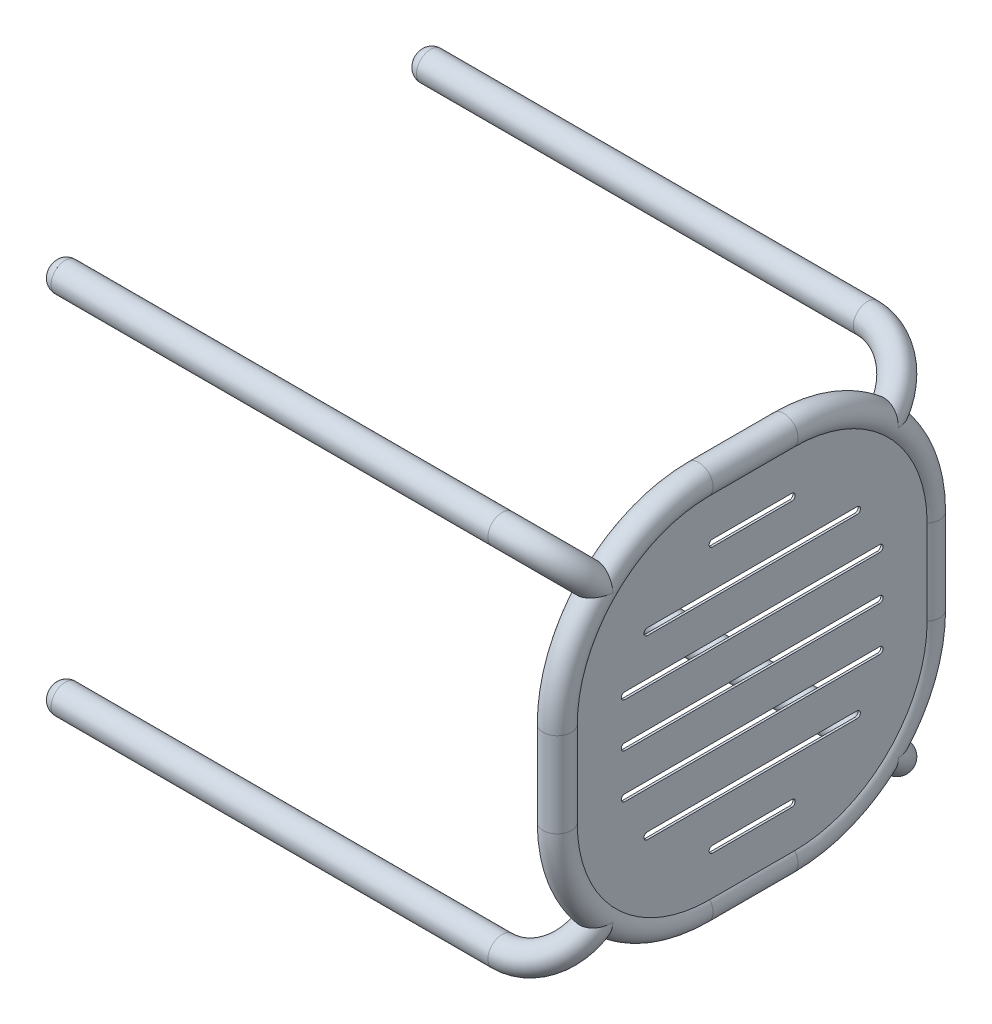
ISO-10303-21;
HEADER;
FILE_DESCRIPTION(('STEP AP214'),'2;1');
FILE_NAME('part.step','',(''),(''),'','','');
FILE_SCHEMA(('AUTOMOTIVE_DESIGN { 1 0 10303 214 1 1 1 1 }'));
ENDSEC;
DATA;
#1=APPLICATION_CONTEXT('core data for automotive mechanical design processes');
#2=APPLICATION_PROTOCOL_DEFINITION('international standard','automotive_design',2000,#1);
#3=PRODUCT_CONTEXT('',#1,'mechanical');
#4=PRODUCT('Part','Part','',(#3));
#5=PRODUCT_RELATED_PRODUCT_CATEGORY('part','',(#4));
#6=PRODUCT_DEFINITION_FORMATION('','',#4);
#7=PRODUCT_DEFINITION_CONTEXT('part definition',#1,'design');
#8=PRODUCT_DEFINITION('design','',#6,#7);
#9=PRODUCT_DEFINITION_SHAPE('','',#8);
#10=(LENGTH_UNIT() NAMED_UNIT(*) SI_UNIT(.MILLI.,.METRE.));
#11=(NAMED_UNIT(*) PLANE_ANGLE_UNIT() SI_UNIT($,.RADIAN.));
#12=(NAMED_UNIT(*) SI_UNIT($,.STERADIAN.) SOLID_ANGLE_UNIT());
#13=UNCERTAINTY_MEASURE_WITH_UNIT(LENGTH_MEASURE(1.E-05),#10,'distance_accuracy_value','');
#14=(GEOMETRIC_REPRESENTATION_CONTEXT(3) GLOBAL_UNCERTAINTY_ASSIGNED_CONTEXT((#13)) GLOBAL_UNIT_ASSIGNED_CONTEXT((#10,
#11,#12)) REPRESENTATION_CONTEXT('',''));
#15=CARTESIAN_POINT('',(0.,0.,0.));
#16=DIRECTION('',(0.,0.,1.));
#17=DIRECTION('',(1.,0.,0.));
#18=AXIS2_PLACEMENT_3D('',#15,#16,#17);
#19=CARTESIAN_POINT('',(0.,-37.5000000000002,962.5));
#20=DIRECTION('',(-1.,0.,0.));
#21=DIRECTION('',(0.,0.,1.));
#22=AXIS2_PLACEMENT_3D('',#19,#20,#21);
#23=TOROIDAL_SURFACE('',#22,125.,12.5);
#24=CARTESIAN_POINT('',(-12.4999999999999,-125.888347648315,1050.88834764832));
#25=CARTESIAN_POINT('',(-12.4999999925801,-125.895782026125,1050.88781388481));
#26=CARTESIAN_POINT('',(-12.4999971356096,-125.903216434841,1050.88727990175));
#27=CARTESIAN_POINT('',(-12.4994183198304,-126.657125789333,1050.83310780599));
#28=CARTESIAN_POINT('',(-12.4701038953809,-127.403882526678,1050.7772742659));
#29=CARTESIAN_POINT('',(-12.3810336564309,-128.520380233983,1050.69288015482));
#30=CARTESIAN_POINT('',(-12.3437932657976,-128.892149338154,1050.66462530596));
#31=CARTESIAN_POINT('',(-12.2537095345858,-129.633844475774,1050.60835347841));
#32=CARTESIAN_POINT('',(-12.2008668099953,-130.003770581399,1050.58033649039));
#33=CARTESIAN_POINT('',(-12.078897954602,-130.741235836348,1050.52499185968));
#34=CARTESIAN_POINT('',(-12.009761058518,-131.108773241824,1050.49766468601));
#35=CARTESIAN_POINT('',(-11.8544474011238,-131.840313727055,1050.44420475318));
#36=CARTESIAN_POINT('',(-11.7682716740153,-132.204317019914,1050.41807192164));
#37=CARTESIAN_POINT('',(-11.5780703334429,-132.927381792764,1050.36752618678));
#38=CARTESIAN_POINT('',(-11.4740626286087,-133.28644784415,1050.3431115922));
#39=CARTESIAN_POINT('',(-11.2471219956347,-133.998725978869,1050.29648992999));
#40=CARTESIAN_POINT('',(-11.1241887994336,-134.351937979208,1050.27428289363));
#41=CARTESIAN_POINT('',(-10.8532739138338,-135.06411798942,1050.23182083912));
#42=CARTESIAN_POINT('',(-10.7045228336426,-135.422801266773,1050.21167092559));
#43=CARTESIAN_POINT('',(-10.3841292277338,-136.130048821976,1050.17491887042));
#44=CARTESIAN_POINT('',(-10.2124859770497,-136.478612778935,1050.15831684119));
#45=CARTESIAN_POINT('',(-9.84530093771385,-137.162429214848,1050.12928002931));
#46=CARTESIAN_POINT('',(-9.64979842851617,-137.497702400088,1050.11683852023));
#47=CARTESIAN_POINT('',(-9.23347166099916,-138.152369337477,1050.09665179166));
#48=CARTESIAN_POINT('',(-9.01264929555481,-138.471764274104,1050.08890622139));
#49=CARTESIAN_POINT('',(-8.58495384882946,-139.037722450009,1050.07949511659));
#50=CARTESIAN_POINT('',(-8.38219105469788,-139.287377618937,1050.07701424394));
#51=CARTESIAN_POINT('',(-7.95848515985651,-139.770623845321,1050.07584597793));
#52=CARTESIAN_POINT('',(-7.7375510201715,-140.004222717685,1050.07715672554));
#53=CARTESIAN_POINT('',(-7.27760117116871,-140.452648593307,1050.08371983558));
#54=CARTESIAN_POINT('',(-7.03859450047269,-140.66748486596,1050.08897023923));
#55=CARTESIAN_POINT('',(-6.54292663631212,-141.075601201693,1050.10346175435));
#56=CARTESIAN_POINT('',(-6.28626838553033,-141.268884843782,1050.11270220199));
#57=CARTESIAN_POINT('',(-5.79828451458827,-141.60232918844,1050.13332154));
#58=CARTESIAN_POINT('',(-5.56936905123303,-141.746057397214,1050.14413137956));
#59=CARTESIAN_POINT('',(-5.10076408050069,-142.014478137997,1050.16839283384));
#60=CARTESIAN_POINT('',(-4.86107564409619,-142.139172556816,1050.18184418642));
#61=CARTESIAN_POINT('',(-4.37229320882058,-142.367957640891,1050.21117895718));
#62=CARTESIAN_POINT('',(-4.12320269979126,-142.472055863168,1050.22706147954));
#63=CARTESIAN_POINT('',(-3.61710953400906,-142.658425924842,1050.2609821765));
#64=CARTESIAN_POINT('',(-3.36010674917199,-142.740697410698,1050.27902038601));
#65=CARTESIAN_POINT('',(-2.83941264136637,-142.882622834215,1050.31695009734));
#66=CARTESIAN_POINT('',(-2.57570717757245,-142.94222382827,1050.33684580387));
#67=CARTESIAN_POINT('',(-2.0441809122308,-143.037970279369,1050.37805600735));
#68=CARTESIAN_POINT('',(-1.77636009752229,-143.074115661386,1050.39937050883));
#69=CARTESIAN_POINT('',(-1.23862530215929,-143.122803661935,1050.44299302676));
#70=CARTESIAN_POINT('',(-0.96871098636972,-143.135342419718,1050.46530120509));
#71=CARTESIAN_POINT('',(-0.428867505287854,-143.137056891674,1050.51047134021));
#72=CARTESIAN_POINT('',(-0.158938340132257,-143.126232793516,1050.53333329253));
#73=CARTESIAN_POINT('',(0.370187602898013,-143.082561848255,1050.57843524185));
#74=CARTESIAN_POINT('',(0.62944611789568,-143.050448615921,1050.60067105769));
#75=CARTESIAN_POINT('',(1.14459395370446,-142.965751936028,1050.64490756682));
#76=CARTESIAN_POINT('',(1.4004833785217,-142.913169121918,1050.66690826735));
#77=CARTESIAN_POINT('',(1.9075113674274,-142.788531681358,1050.71035482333));
#78=CARTESIAN_POINT('',(2.15864981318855,-142.716476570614,1050.73180066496));
#79=CARTESIAN_POINT('',(2.65500135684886,-142.554015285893,1050.77386003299));
#80=CARTESIAN_POINT('',(2.90021370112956,-142.463606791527,1050.79447345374));
#81=CARTESIAN_POINT('',(3.4074279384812,-142.255917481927,1050.83660105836));
#82=CARTESIAN_POINT('',(3.66871546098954,-142.136870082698,1050.85800507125));
#83=CARTESIAN_POINT('',(4.18183514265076,-141.879712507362,1050.89926716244));
#84=CARTESIAN_POINT('',(4.43366698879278,-141.741601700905,1050.91912518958));
#85=CARTESIAN_POINT('',(4.92716488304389,-141.447845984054,1050.95710826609));
#86=CARTESIAN_POINT('',(5.16882611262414,-141.292192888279,1050.97523249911));
#87=CARTESIAN_POINT('',(5.64125096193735,-140.964938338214,1051.00959452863));
#88=CARTESIAN_POINT('',(5.87201270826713,-140.793334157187,1051.02583200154));
#89=CARTESIAN_POINT('',(6.42345265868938,-140.355148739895,1051.06317526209));
#90=CARTESIAN_POINT('',(6.737882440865,-140.080568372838,1051.0831852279));
#91=CARTESIAN_POINT('',(7.34191552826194,-139.505051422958,1051.11884638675));
#92=CARTESIAN_POINT('',(7.63151057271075,-139.204106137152,1051.1344961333));
#93=CARTESIAN_POINT('',(8.18576075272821,-138.579104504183,1051.16141272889));
#94=CARTESIAN_POINT('',(8.45037694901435,-138.255013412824,1051.17267281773));
#95=CARTESIAN_POINT('',(8.95396228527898,-137.587449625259,1051.19083177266));
#96=CARTESIAN_POINT('',(9.1929312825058,-137.243976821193,1051.19773061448));
#97=CARTESIAN_POINT('',(9.7025328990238,-136.451466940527,1051.20850566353));
#98=CARTESIAN_POINT('',(9.96587332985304,-135.997712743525,1051.21117505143));
#99=CARTESIAN_POINT('',(10.4526780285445,-135.069272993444,1051.21023536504));
#100=CARTESIAN_POINT('',(10.6761313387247,-134.59458173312,1051.2066245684));
#101=CARTESIAN_POINT('',(11.0836759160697,-133.628506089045,1051.19358696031));
#102=CARTESIAN_POINT('',(11.2677531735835,-133.137115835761,1051.18415808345));
#103=CARTESIAN_POINT('',(11.5969644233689,-132.141791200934,1051.16002414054));
#104=CARTESIAN_POINT('',(11.7421054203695,-131.63785909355,1051.14532002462));
#105=CARTESIAN_POINT('',(12.0794710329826,-130.276078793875,1051.09965716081));
#106=CARTESIAN_POINT('',(12.2370356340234,-129.409625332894,1051.06443367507));
#107=CARTESIAN_POINT('',(12.4467019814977,-127.666210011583,1050.98383910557));
#108=CARTESIAN_POINT('',(12.4990111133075,-126.789272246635,1050.93848817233));
#109=CARTESIAN_POINT('',(12.4999953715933,-125.90498843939,1050.8892747));
#110=CARTESIAN_POINT('',(12.5000000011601,-125.896667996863,1050.8888113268));
#111=CARTESIAN_POINT('',(12.5000000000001,-125.888347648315,1050.88834764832));
#112=B_SPLINE_CURVE_WITH_KNOTS('',3,(#24,#25,#26,#27,#28,#29,#30,#31,#32,#33,#34,#35,#36,#37,
#38,#39,#40,#41,#42,#43,#44,#45,#46,#47,#48,#49,#50,#51,#52,#53,#54,#55,#56,#57,#58,#59,#60,#61,
#62,#63,#64,#65,#66,#67,#68,#69,#70,#71,#72,#73,#74,#75,#76,#77,#78,#79,#80,#81,#82,#83,#84,#85,
#86,#87,#88,#89,#90,#91,#92,#93,#94,#95,#96,#97,#98,#99,#100,#101,#102,#103,#104,#105,#106,#107,
#108,#109,#110,#111),.UNSPECIFIED.,.F.,.F.,(4,2,2,2,2,2,2,2,2,2,2,2,2,2,2,2,2,2,2,2,2,2,2,2,2,2,
2,2,2,2,2,2,2,2,2,2,2,2,2,2,2,2,2,4),(0.,0.0223606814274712,2.26754596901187,3.39141182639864,
4.51523331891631,5.63979939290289,6.76429723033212,7.88767228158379,9.01106324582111,
10.1767908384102,11.3425553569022,12.5064259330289,13.6702095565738,14.6342592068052,
15.5978362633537,16.5609345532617,17.5238726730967,18.3345717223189,19.1451903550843,
19.9555110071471,20.765844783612,21.5780595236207,22.3902768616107,23.2026270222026,
24.0149706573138,24.8006828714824,25.5863707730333,26.3720782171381,27.1578850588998,
28.0208196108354,28.8837827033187,29.7471501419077,30.6106654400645,31.8626274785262,
33.1150043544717,34.369302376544,35.6236073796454,37.1953487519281,38.7675212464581,
40.34025217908,41.9126999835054,44.5498348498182,47.1817686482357,47.2067686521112),.UNSPECIFIED.);
#113=CARTESIAN_POINT('',(-12.4999999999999,-125.888347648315,1050.88834764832));
#114=VERTEX_POINT('',#113);
#115=CARTESIAN_POINT('',(12.5000000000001,-125.888347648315,1050.88834764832));
#116=VERTEX_POINT('',#115);
#117=EDGE_CURVE('P0_E1338',#114,#116,#112,.T.);
#118=ORIENTED_EDGE('',*,*,#117,.F.);
#119=CARTESIAN_POINT('',(12.5000000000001,-125.888347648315,1050.88834764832));
#120=CARTESIAN_POINT('',(12.5000000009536,-125.888811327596,1050.89666802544));
#121=CARTESIAN_POINT('',(12.4999953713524,-125.889274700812,1050.90498846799));
#122=CARTESIAN_POINT('',(12.4993999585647,-125.919046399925,1051.43993521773));
#123=CARTESIAN_POINT('',(12.4802607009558,-125.947123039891,1051.96679907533));
#124=CARTESIAN_POINT('',(12.4044462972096,-126.000071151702,1053.01803707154));
#125=CARTESIAN_POINT('',(12.347761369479,-126.024941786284,1053.54241052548));
#126=CARTESIAN_POINT('',(12.1961751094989,-126.070840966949,1054.58704762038));
#127=CARTESIAN_POINT('',(12.1011869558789,-126.091860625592,1055.10729916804));
#128=CARTESIAN_POINT('',(11.8724484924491,-126.129326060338,1056.13931033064));
#129=CARTESIAN_POINT('',(11.7387053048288,-126.145772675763,1056.65107148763));
#130=CARTESIAN_POINT('',(11.4388689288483,-126.172848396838,1057.63971187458));
#131=CARTESIAN_POINT('',(11.2745326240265,-126.183708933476,1058.11711662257));
#132=CARTESIAN_POINT('',(10.9094718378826,-126.200215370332,1059.05799798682));
#133=CARTESIAN_POINT('',(10.7087445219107,-126.205860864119,1059.52147351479));
#134=CARTESIAN_POINT('',(10.2706777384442,-126.211490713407,1060.43026245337));
#135=CARTESIAN_POINT('',(10.0333776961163,-126.211481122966,1060.87559477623));
#136=CARTESIAN_POINT('',(9.52168417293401,-126.205444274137,1061.74433840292));
#137=CARTESIAN_POINT('',(9.24730095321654,-126.199418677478,1062.1677557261));
#138=CARTESIAN_POINT('',(8.72317177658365,-126.183020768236,1062.90129093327));
#139=CARTESIAN_POINT('',(8.48044455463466,-126.173833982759,1063.21646304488));
#140=CARTESIAN_POINT('',(7.97188809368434,-126.151478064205,1063.82749078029));
#141=CARTESIAN_POINT('',(7.70606000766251,-126.138309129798,1064.12334736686));
#142=CARTESIAN_POINT('',(7.15185826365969,-126.108000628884,1064.69244297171));
#143=CARTESIAN_POINT('',(6.86350532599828,-126.090864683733,1064.96570231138));
#144=CARTESIAN_POINT('',(6.26465910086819,-126.052706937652,1065.4865014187));
#145=CARTESIAN_POINT('',(5.95417003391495,-126.031685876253,1065.73404606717));
#146=CARTESIAN_POINT('',(5.37448811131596,-125.990416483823,1066.15444858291));
#147=CARTESIAN_POINT('',(5.10898961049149,-125.970811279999,1066.33247362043));
#148=CARTESIAN_POINT('',(4.56511918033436,-125.92940457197,1066.66730689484));
#149=CARTESIAN_POINT('',(4.28674993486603,-125.907603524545,1066.82411952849));
#150=CARTESIAN_POINT('',(3.71820376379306,-125.862061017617,1067.11436143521));
#151=CARTESIAN_POINT('',(3.42802726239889,-125.838319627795,1067.24779154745));
#152=CARTESIAN_POINT('',(2.83730001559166,-125.78924014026,1067.48904935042));
#153=CARTESIAN_POINT('',(2.53674907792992,-125.76390201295,1067.59687656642));
#154=CARTESIAN_POINT('',(1.92446592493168,-125.711841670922,1067.78557272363));
#155=CARTESIAN_POINT('',(1.61265881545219,-125.685109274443,1067.8661971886));
#156=CARTESIAN_POINT('',(0.982748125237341,-125.631017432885,1067.99713169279));
#157=CARTESIAN_POINT('',(0.664644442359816,-125.603657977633,1068.04744123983));
#158=CARTESIAN_POINT('',(0.0252710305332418,-125.548980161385,1068.1160294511));
#159=CARTESIAN_POINT('',(-0.295995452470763,-125.521661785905,1068.13433808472));
#160=CARTESIAN_POINT('',(-0.938759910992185,-125.467751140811,1068.13787116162));
#161=CARTESIAN_POINT('',(-1.2602578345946,-125.441158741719,1068.12310154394));
#162=CARTESIAN_POINT('',(-1.85381925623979,-125.393173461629,1068.06463508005));
#163=CARTESIAN_POINT('',(-2.12631687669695,-125.37158428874,1068.02542370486));
#164=CARTESIAN_POINT('',(-2.66679435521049,-125.3299264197,1067.92271007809));
#165=CARTESIAN_POINT('',(-2.93477473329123,-125.30985754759,1067.85921064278));
#166=CARTESIAN_POINT('',(-3.46407541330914,-125.271659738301,1067.70858726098));
#167=CARTESIAN_POINT('',(-3.72539719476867,-125.253530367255,1067.6214686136));
#168=CARTESIAN_POINT('',(-4.23954634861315,-125.219565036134,1067.42466355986));
#169=CARTESIAN_POINT('',(-4.49237361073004,-125.203729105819,1067.31497686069));
#170=CARTESIAN_POINT('',(-4.97545691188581,-125.175366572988,1067.08048868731));
#171=CARTESIAN_POINT('',(-5.20620907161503,-125.162713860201,1066.95672070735));
#172=CARTESIAN_POINT('',(-5.65742580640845,-125.139911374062,1066.69153634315));
#173=CARTESIAN_POINT('',(-5.87789110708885,-125.129761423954,1066.55012120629));
#174=CARTESIAN_POINT('',(-6.30772770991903,-125.112069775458,1066.25116306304));
#175=CARTESIAN_POINT('',(-6.51709765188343,-125.104528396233,1066.09361808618));
#176=CARTESIAN_POINT('',(-6.92416957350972,-125.092095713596,1065.76399293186));
#177=CARTESIAN_POINT('',(-7.12186912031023,-125.08720496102,1065.59190974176));
#178=CARTESIAN_POINT('',(-7.58300854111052,-125.07861440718,1065.16234936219));
#179=CARTESIAN_POINT('',(-7.84059850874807,-125.076201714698,1064.89854048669));
#180=CARTESIAN_POINT('',(-8.33179814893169,-125.076393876,1064.34947347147));
#181=CARTESIAN_POINT('',(-8.56539977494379,-125.079000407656,1064.06420818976));
#182=CARTESIAN_POINT('',(-9.00938567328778,-125.088901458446,1063.47544772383));
#183=CARTESIAN_POINT('',(-9.21972548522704,-125.096204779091,1063.17191928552));
#184=CARTESIAN_POINT('',(-9.61745695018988,-125.115074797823,1062.55039854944));
#185=CARTESIAN_POINT('',(-9.80484811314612,-125.126641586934,1062.232405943));
#186=CARTESIAN_POINT('',(-10.2381112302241,-125.159691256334,1061.43712580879));
#187=CARTESIAN_POINT('',(-10.4717533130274,-125.18329110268,1060.95324258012));
#188=CARTESIAN_POINT('',(-10.8961310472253,-125.236940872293,1059.96732150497));
#189=CARTESIAN_POINT('',(-11.0868446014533,-125.266994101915,1059.4652744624));
#190=CARTESIAN_POINT('',(-11.4288264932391,-125.331994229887,1058.44780288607));
#191=CARTESIAN_POINT('',(-11.5800570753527,-125.36694576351,1057.93236606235));
#192=CARTESIAN_POINT('',(-11.845835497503,-125.44017854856,1056.89255936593));
#193=CARTESIAN_POINT('',(-11.9603920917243,-125.478459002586,1056.36819165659));
#194=CARTESIAN_POINT('',(-12.1330597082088,-125.547906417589,1055.43420258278));
#195=CARTESIAN_POINT('',(-12.1980894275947,-125.578694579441,1055.02580656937));
#196=CARTESIAN_POINT('',(-12.3088181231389,-125.640744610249,1054.2064370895));
#197=CARTESIAN_POINT('',(-12.3545170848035,-125.672006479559,1053.79546362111));
#198=CARTESIAN_POINT('',(-12.4272705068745,-125.734330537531,1052.97257768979));
#199=CARTESIAN_POINT('',(-12.4543561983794,-125.765392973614,1052.56066796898));
#200=CARTESIAN_POINT('',(-12.4905564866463,-125.826773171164,1051.73605547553));
#201=CARTESIAN_POINT('',(-12.4996742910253,-125.857091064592,1051.32335285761));
#202=CARTESIAN_POINT('',(-12.4999971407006,-125.887279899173,1050.90321646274));
#203=CARTESIAN_POINT('',(-12.4999999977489,-125.887813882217,1050.89578205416));
#204=CARTESIAN_POINT('',(-12.4999999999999,-125.888347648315,1050.88834764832));
#205=B_SPLINE_CURVE_WITH_KNOTS('',3,(#119,#120,#121,#122,#123,#124,#125,#126,#127,#128,#129,
#130,#131,#132,#133,#134,#135,#136,#137,#138,#139,#140,#141,#142,#143,#144,#145,#146,#147,#148,
#149,#150,#151,#152,#153,#154,#155,#156,#157,#158,#159,#160,#161,#162,#163,#164,#165,#166,#167,
#168,#169,#170,#171,#172,#173,#174,#175,#176,#177,#178,#179,#180,#181,#182,#183,#184,#185,#186,
#187,#188,#189,#190,#191,#192,#193,#194,#195,#196,#197,#198,#199,#200,#201,#202,#203,#204),
.UNSPECIFIED.,.F.,.F.,(4,2,2,2,2,2,2,2,2,2,2,2,2,2,2,2,2,2,2,2,2,2,2,2,2,2,2,2,2,2,2,2,2,2,2,2,
2,2,2,2,2,2,4),(0.,0.0250000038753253,1.60731540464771,3.19004320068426,4.77637889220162,
6.36242324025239,7.87601499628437,9.38972470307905,10.9018139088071,12.4134855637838,
13.6061715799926,14.7987981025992,15.9903401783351,17.1816556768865,18.1415515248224,
19.1012481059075,20.0609102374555,21.0205901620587,21.9886784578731,22.9567824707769,
23.9239793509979,24.8910025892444,25.7183756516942,26.5456528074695,27.3727445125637,
28.1998469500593,28.9854821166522,29.7710617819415,30.5567375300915,31.3425764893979,
32.4470716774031,33.5519361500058,34.6588771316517,35.7658417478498,37.3769094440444,
38.9888045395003,40.6022354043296,42.2152808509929,43.4588887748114,44.7024976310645,
45.9440147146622,47.1853101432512,47.2076708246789),.UNSPECIFIED.);
#206=EDGE_CURVE('P0_E1345',#116,#114,#205,.T.);
#207=ORIENTED_EDGE('',*,*,#206,.F.);
#208=EDGE_LOOP('',(#118,#207));
#209=FACE_BOUND('',#208,.T.);
#210=CARTESIAN_POINT('',(0.,-162.5,962.5));
#211=DIRECTION('',(0.,0.,-1.));
#212=DIRECTION('',(1.,0.,0.));
#213=AXIS2_PLACEMENT_3D('',#210,#211,#212);
#214=CIRCLE('',#213,12.5);
#215=CARTESIAN_POINT('',(9.5,-154.375961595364,962.500000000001));
#216=VERTEX_POINT('',#215);
#217=CARTESIAN_POINT('',(7.5,-152.5,962.5));
#218=VERTEX_POINT('',#217);
#219=EDGE_CURVE('P0_E826',#216,#218,#214,.T.);
#220=ORIENTED_EDGE('',*,*,#219,.F.);
#221=CARTESIAN_POINT('',(9.5,-37.5000000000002,962.5));
#222=DIRECTION('',(1.,0.,0.));
#223=DIRECTION('',(0.,0.,-1.));
#224=AXIS2_PLACEMENT_3D('',#221,#222,#223);
#225=CIRCLE('',#224,116.875961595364);
#226=CARTESIAN_POINT('',(9.5,-37.5000000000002,1079.37596159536));
#227=VERTEX_POINT('',#226);
#228=EDGE_CURVE('P0_E567',#216,#227,#225,.F.);
#229=ORIENTED_EDGE('',*,*,#228,.T.);
#230=CARTESIAN_POINT('',(0.,-37.5000000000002,1087.5));
#231=DIRECTION('',(0.,-1.,0.));
#232=DIRECTION('',(1.,0.,0.));
#233=AXIS2_PLACEMENT_3D('',#230,#231,#232);
#234=CIRCLE('',#233,12.5);
#235=CARTESIAN_POINT('',(7.5,-37.5000000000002,1077.5));
#236=VERTEX_POINT('',#235);
#237=EDGE_CURVE('P0_E551',#227,#236,#234,.T.);
#238=ORIENTED_EDGE('',*,*,#237,.T.);
#239=CARTESIAN_POINT('',(7.5,-37.5000000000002,962.5));
#240=DIRECTION('',(1.,0.,0.));
#241=DIRECTION('',(0.,0.,-1.));
#242=AXIS2_PLACEMENT_3D('',#239,#240,#241);
#243=CIRCLE('',#242,115.);
#244=EDGE_CURVE('P0_E530',#218,#236,#243,.F.);
#245=ORIENTED_EDGE('',*,*,#244,.F.);
#246=EDGE_LOOP('',(#220,#229,#238,#245));
#247=FACE_BOUND('',#246,.T.);
#248=ADVANCED_FACE('P0_F41',(#209,#247),#23,.T.);
#249=CARTESIAN_POINT('',(0.,37.5,887.5));
#250=DIRECTION('',(-1.,0.,0.));
#251=DIRECTION('',(0.,0.,-1.));
#252=AXIS2_PLACEMENT_3D('',#249,#250,#251);
#253=TOROIDAL_SURFACE('',#252,125.,12.5);
#254=CARTESIAN_POINT('',(-12.4999999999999,125.888347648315,799.111652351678));
#255=CARTESIAN_POINT('',(-12.4999999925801,125.895782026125,799.112186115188));
#256=CARTESIAN_POINT('',(-12.4999971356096,125.903216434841,799.11272009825));
#257=CARTESIAN_POINT('',(-12.4994183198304,126.657125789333,799.166892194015));
#258=CARTESIAN_POINT('',(-12.4701038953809,127.403882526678,799.2227257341));
#259=CARTESIAN_POINT('',(-12.3810336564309,128.520380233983,799.307119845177));
#260=CARTESIAN_POINT('',(-12.3437932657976,128.892149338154,799.335374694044));
#261=CARTESIAN_POINT('',(-12.2537095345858,129.633844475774,799.39164652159));
#262=CARTESIAN_POINT('',(-12.2008668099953,130.003770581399,799.419663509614));
#263=CARTESIAN_POINT('',(-12.078897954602,130.741235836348,799.475008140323));
#264=CARTESIAN_POINT('',(-12.009761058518,131.108773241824,799.502335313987));
#265=CARTESIAN_POINT('',(-11.8544474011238,131.840313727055,799.555795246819));
#266=CARTESIAN_POINT('',(-11.7682716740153,132.204317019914,799.58192807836));
#267=CARTESIAN_POINT('',(-11.5780703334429,132.927381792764,799.632473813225));
#268=CARTESIAN_POINT('',(-11.4740626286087,133.28644784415,799.656888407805));
#269=CARTESIAN_POINT('',(-11.2471219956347,133.998725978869,799.703510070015));
#270=CARTESIAN_POINT('',(-11.1241887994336,134.351937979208,799.725717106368));
#271=CARTESIAN_POINT('',(-10.8532739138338,135.06411798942,799.768179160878));
#272=CARTESIAN_POINT('',(-10.7045228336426,135.422801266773,799.78832907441));
#273=CARTESIAN_POINT('',(-10.3841292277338,136.130048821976,799.825081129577));
#274=CARTESIAN_POINT('',(-10.2124859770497,136.478612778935,799.841683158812));
#275=CARTESIAN_POINT('',(-9.84530093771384,137.162429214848,799.87071997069));
#276=CARTESIAN_POINT('',(-9.64979842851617,137.497702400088,799.883161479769));
#277=CARTESIAN_POINT('',(-9.23347166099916,138.152369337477,799.903348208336));
#278=CARTESIAN_POINT('',(-9.01264929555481,138.471764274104,799.911093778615));
#279=CARTESIAN_POINT('',(-8.58495384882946,139.037722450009,799.920504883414));
#280=CARTESIAN_POINT('',(-8.38219105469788,139.287377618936,799.92298575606));
#281=CARTESIAN_POINT('',(-7.9584851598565,139.770623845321,799.924154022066));
#282=CARTESIAN_POINT('',(-7.73755102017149,140.004222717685,799.922843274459));
#283=CARTESIAN_POINT('',(-7.27760117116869,140.452648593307,799.916280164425));
#284=CARTESIAN_POINT('',(-7.03859450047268,140.66748486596,799.911029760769));
#285=CARTESIAN_POINT('',(-6.54292663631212,141.075601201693,799.896538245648));
#286=CARTESIAN_POINT('',(-6.28626838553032,141.268884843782,799.887297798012));
#287=CARTESIAN_POINT('',(-5.79828451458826,141.60232918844,799.866678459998));
#288=CARTESIAN_POINT('',(-5.56936905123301,141.746057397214,799.855868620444));
#289=CARTESIAN_POINT('',(-5.10076408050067,142.014478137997,799.83160716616));
#290=CARTESIAN_POINT('',(-4.86107564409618,142.139172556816,799.818155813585));
#291=CARTESIAN_POINT('',(-4.37229320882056,142.367957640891,799.788821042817));
#292=CARTESIAN_POINT('',(-4.12320269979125,142.472055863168,799.772938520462));
#293=CARTESIAN_POINT('',(-3.61710953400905,142.658425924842,799.739017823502));
#294=CARTESIAN_POINT('',(-3.36010674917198,142.740697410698,799.720979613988));
#295=CARTESIAN_POINT('',(-2.83941264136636,142.882622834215,799.683049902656));
#296=CARTESIAN_POINT('',(-2.57570717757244,142.942223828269,799.663154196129));
#297=CARTESIAN_POINT('',(-2.04418091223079,143.037970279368,799.621943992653));
#298=CARTESIAN_POINT('',(-1.77636009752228,143.074115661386,799.600629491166));
#299=CARTESIAN_POINT('',(-1.23862530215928,143.122803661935,799.557006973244));
#300=CARTESIAN_POINT('',(-0.968710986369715,143.135342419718,799.534698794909));
#301=CARTESIAN_POINT('',(-0.428867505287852,143.137056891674,799.489528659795));
#302=CARTESIAN_POINT('',(-0.158938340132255,143.126232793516,799.466666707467));
#303=CARTESIAN_POINT('',(0.370187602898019,143.082561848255,799.421564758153));
#304=CARTESIAN_POINT('',(0.62944611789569,143.050448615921,799.399328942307));
#305=CARTESIAN_POINT('',(1.14459395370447,142.965751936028,799.355092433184));
#306=CARTESIAN_POINT('',(1.40048337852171,142.913169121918,799.333091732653));
#307=CARTESIAN_POINT('',(1.9075113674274,142.788531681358,799.289645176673));
#308=CARTESIAN_POINT('',(2.15864981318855,142.716476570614,799.268199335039));
#309=CARTESIAN_POINT('',(2.65500135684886,142.554015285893,799.226139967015));
#310=CARTESIAN_POINT('',(2.90021370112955,142.463606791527,799.205526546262));
#311=CARTESIAN_POINT('',(3.40742793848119,142.255917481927,799.163398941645));
#312=CARTESIAN_POINT('',(3.66871546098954,142.136870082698,799.14199492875));
#313=CARTESIAN_POINT('',(4.18183514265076,141.879712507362,799.100732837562));
#314=CARTESIAN_POINT('',(4.43366698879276,141.741601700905,799.080874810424));
#315=CARTESIAN_POINT('',(4.92716488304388,141.447845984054,799.042891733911));
#316=CARTESIAN_POINT('',(5.16882611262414,141.292192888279,799.024767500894));
#317=CARTESIAN_POINT('',(5.64125096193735,140.964938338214,798.990405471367));
#318=CARTESIAN_POINT('',(5.87201270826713,140.793334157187,798.974167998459));
#319=CARTESIAN_POINT('',(6.42345265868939,140.355148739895,798.936824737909));
#320=CARTESIAN_POINT('',(6.73788244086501,140.080568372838,798.916814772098));
#321=CARTESIAN_POINT('',(7.34191552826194,139.505051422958,798.881153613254));
#322=CARTESIAN_POINT('',(7.63151057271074,139.204106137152,798.865503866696));
#323=CARTESIAN_POINT('',(8.1857607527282,138.579104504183,798.838587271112));
#324=CARTESIAN_POINT('',(8.45037694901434,138.255013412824,798.827327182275));
#325=CARTESIAN_POINT('',(8.95396228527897,137.587449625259,798.809168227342));
#326=CARTESIAN_POINT('',(9.19293128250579,137.243976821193,798.802269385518));
#327=CARTESIAN_POINT('',(9.70253289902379,136.451466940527,798.791494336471));
#328=CARTESIAN_POINT('',(9.96587332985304,135.997712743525,798.788824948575));
#329=CARTESIAN_POINT('',(10.4526780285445,135.069272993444,798.789764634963));
#330=CARTESIAN_POINT('',(10.6761313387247,134.59458173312,798.793375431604));
#331=CARTESIAN_POINT('',(11.0836759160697,133.628506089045,798.806413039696));
#332=CARTESIAN_POINT('',(11.2677531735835,133.137115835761,798.815841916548));
#333=CARTESIAN_POINT('',(11.5969644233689,132.141791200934,798.83997585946));
#334=CARTESIAN_POINT('',(11.7421054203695,131.63785909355,798.854679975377));
#335=CARTESIAN_POINT('',(12.0794710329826,130.276078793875,798.900342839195));
#336=CARTESIAN_POINT('',(12.2370356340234,129.409625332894,798.935566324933));
#337=CARTESIAN_POINT('',(12.4467019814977,127.666210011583,799.016160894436));
#338=CARTESIAN_POINT('',(12.4990111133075,126.789272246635,799.061511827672));
#339=CARTESIAN_POINT('',(12.4999953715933,125.90498843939,799.110725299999));
#340=CARTESIAN_POINT('',(12.5000000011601,125.896667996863,799.111188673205));
#341=CARTESIAN_POINT('',(12.5000000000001,125.888347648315,799.111652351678));
#342=B_SPLINE_CURVE_WITH_KNOTS('',3,(#254,#255,#256,#257,#258,#259,#260,#261,#262,#263,#264,
#265,#266,#267,#268,#269,#270,#271,#272,#273,#274,#275,#276,#277,#278,#279,#280,#281,#282,#283,
#284,#285,#286,#287,#288,#289,#290,#291,#292,#293,#294,#295,#296,#297,#298,#299,#300,#301,#302,
#303,#304,#305,#306,#307,#308,#309,#310,#311,#312,#313,#314,#315,#316,#317,#318,#319,#320,#321,
#322,#323,#324,#325,#326,#327,#328,#329,#330,#331,#332,#333,#334,#335,#336,#337,#338,#339,#340,
#341),.UNSPECIFIED.,.F.,.F.,(4,2,2,2,2,2,2,2,2,2,2,2,2,2,2,2,2,2,2,2,2,2,2,2,2,2,2,2,2,2,2,2,2,
2,2,2,2,2,2,2,2,2,2,4),(0.,0.0223606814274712,2.26754596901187,3.39141182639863,
4.51523331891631,5.63979939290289,6.76429723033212,7.88767228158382,9.01106324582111,
10.1767908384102,11.3425553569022,12.5064259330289,13.6702095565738,14.6342592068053,
15.5978362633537,16.5609345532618,17.5238726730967,18.3345717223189,19.1451903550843,
19.9555110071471,20.765844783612,21.5780595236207,22.3902768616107,23.2026270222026,
24.0149706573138,24.8006828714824,25.5863707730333,26.3720782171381,27.1578850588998,
28.0208196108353,28.8837827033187,29.7471501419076,30.6106654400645,31.8626274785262,
33.1150043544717,34.369302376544,35.6236073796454,37.1953487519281,38.767521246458,
40.34025217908,41.9126999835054,44.5498348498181,47.1817686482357,47.2067686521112),.UNSPECIFIED.);
#343=CARTESIAN_POINT('',(-12.4999999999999,125.888347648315,799.111652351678));
#344=VERTEX_POINT('',#343);
#345=CARTESIAN_POINT('',(12.5000000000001,125.888347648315,799.111652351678));
#346=VERTEX_POINT('',#345);
#347=EDGE_CURVE('P0_E838',#344,#346,#342,.T.);
#348=ORIENTED_EDGE('',*,*,#347,.F.);
#349=CARTESIAN_POINT('',(12.5000000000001,125.888347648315,799.111652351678));
#350=CARTESIAN_POINT('',(12.5000000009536,125.888811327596,799.103331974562));
#351=CARTESIAN_POINT('',(12.4999953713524,125.889274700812,799.095011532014));
#352=CARTESIAN_POINT('',(12.4993999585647,125.919046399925,798.560064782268));
#353=CARTESIAN_POINT('',(12.4802607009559,125.947123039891,798.033200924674));
#354=CARTESIAN_POINT('',(12.4044462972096,126.000071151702,796.981962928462));
#355=CARTESIAN_POINT('',(12.347761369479,126.024941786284,796.457589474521));
#356=CARTESIAN_POINT('',(12.1961751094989,126.070840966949,795.412952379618));
#357=CARTESIAN_POINT('',(12.101186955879,126.091860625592,794.892700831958));
#358=CARTESIAN_POINT('',(11.8724484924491,126.129326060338,793.860689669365));
#359=CARTESIAN_POINT('',(11.7387053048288,126.145772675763,793.348928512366));
#360=CARTESIAN_POINT('',(11.4388689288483,126.172848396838,792.360288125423));
#361=CARTESIAN_POINT('',(11.2745326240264,126.183708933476,791.882883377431));
#362=CARTESIAN_POINT('',(10.9094718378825,126.200215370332,790.942002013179));
#363=CARTESIAN_POINT('',(10.7087445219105,126.205860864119,790.478526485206));
#364=CARTESIAN_POINT('',(10.270677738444,126.211490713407,789.569737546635));
#365=CARTESIAN_POINT('',(10.0333776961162,126.211481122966,789.124405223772));
#366=CARTESIAN_POINT('',(9.52168417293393,126.205444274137,788.255661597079));
#367=CARTESIAN_POINT('',(9.2473009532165,126.199418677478,787.832244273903));
#368=CARTESIAN_POINT('',(8.72317177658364,126.183020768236,787.098709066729));
#369=CARTESIAN_POINT('',(8.48044455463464,126.173833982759,786.783536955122));
#370=CARTESIAN_POINT('',(7.97188809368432,126.151478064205,786.172509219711));
#371=CARTESIAN_POINT('',(7.7060600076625,126.138309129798,785.876652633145));
#372=CARTESIAN_POINT('',(7.15185826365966,126.108000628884,785.307557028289));
#373=CARTESIAN_POINT('',(6.86350532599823,126.090864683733,785.034297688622));
#374=CARTESIAN_POINT('',(6.26465910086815,126.052706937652,784.513498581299));
#375=CARTESIAN_POINT('',(5.95417003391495,126.031685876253,784.265953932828));
#376=CARTESIAN_POINT('',(5.37448811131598,125.990416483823,783.845551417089));
#377=CARTESIAN_POINT('',(5.1089896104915,125.970811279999,783.667526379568));
#378=CARTESIAN_POINT('',(4.56511918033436,125.92940457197,783.332693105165));
#379=CARTESIAN_POINT('',(4.28674993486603,125.907603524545,783.175880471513));
#380=CARTESIAN_POINT('',(3.71820376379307,125.862061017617,782.885638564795));
#381=CARTESIAN_POINT('',(3.42802726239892,125.838319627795,782.752208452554));
#382=CARTESIAN_POINT('',(2.83730001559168,125.78924014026,782.510950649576));
#383=CARTESIAN_POINT('',(2.53674907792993,125.76390201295,782.403123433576));
#384=CARTESIAN_POINT('',(1.92446592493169,125.711841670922,782.214427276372));
#385=CARTESIAN_POINT('',(1.61265881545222,125.685109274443,782.133802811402));
#386=CARTESIAN_POINT('',(0.98274812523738,125.631017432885,782.002868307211));
#387=CARTESIAN_POINT('',(0.66464444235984,125.603657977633,781.952558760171));
#388=CARTESIAN_POINT('',(0.0252710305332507,125.548980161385,781.883970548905));
#389=CARTESIAN_POINT('',(-0.295995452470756,125.521661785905,781.865661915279));
#390=CARTESIAN_POINT('',(-0.938759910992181,125.467751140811,781.862128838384));
#391=CARTESIAN_POINT('',(-1.2602578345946,125.441158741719,781.876898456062));
#392=CARTESIAN_POINT('',(-1.85381925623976,125.393173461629,781.935364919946));
#393=CARTESIAN_POINT('',(-2.12631687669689,125.37158428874,781.974576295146));
#394=CARTESIAN_POINT('',(-2.66679435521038,125.3299264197,782.077289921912));
#395=CARTESIAN_POINT('',(-2.93477473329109,125.30985754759,782.140789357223));
#396=CARTESIAN_POINT('',(-3.46407541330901,125.271659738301,782.291412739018));
#397=CARTESIAN_POINT('',(-3.72539719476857,125.253530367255,782.378531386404));
#398=CARTESIAN_POINT('',(-4.23954634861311,125.219565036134,782.575336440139));
#399=CARTESIAN_POINT('',(-4.49237361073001,125.203729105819,782.685023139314));
#400=CARTESIAN_POINT('',(-4.97545691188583,125.175366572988,782.919511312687));
#401=CARTESIAN_POINT('',(-5.20620907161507,125.162713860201,783.043279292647));
#402=CARTESIAN_POINT('',(-5.65742580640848,125.139911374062,783.308463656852));
#403=CARTESIAN_POINT('',(-5.87789110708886,125.129761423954,783.449878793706));
#404=CARTESIAN_POINT('',(-6.307727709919,125.112069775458,783.748836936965));
#405=CARTESIAN_POINT('',(-6.5170976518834,125.104528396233,783.906381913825));
#406=CARTESIAN_POINT('',(-6.9241695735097,125.092095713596,784.236007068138));
#407=CARTESIAN_POINT('',(-7.12186912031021,125.08720496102,784.40809025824));
#408=CARTESIAN_POINT('',(-7.58300854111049,125.07861440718,784.837650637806));
#409=CARTESIAN_POINT('',(-7.84059850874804,125.076201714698,785.101459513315));
#410=CARTESIAN_POINT('',(-8.33179814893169,125.076393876,785.65052652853));
#411=CARTESIAN_POINT('',(-8.56539977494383,125.079000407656,785.93579181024));
#412=CARTESIAN_POINT('',(-9.00938567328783,125.088901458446,786.524552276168));
#413=CARTESIAN_POINT('',(-9.21972548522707,125.096204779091,786.828080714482));
#414=CARTESIAN_POINT('',(-9.61745695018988,125.115074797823,787.449601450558));
#415=CARTESIAN_POINT('',(-9.80484811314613,125.126641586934,787.767594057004));
#416=CARTESIAN_POINT('',(-10.2381112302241,125.159691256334,788.562874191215));
#417=CARTESIAN_POINT('',(-10.4717533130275,125.18329110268,789.046757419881));
#418=CARTESIAN_POINT('',(-10.8961310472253,125.236940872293,790.032678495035));
#419=CARTESIAN_POINT('',(-11.0868446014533,125.266994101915,790.534725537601));
#420=CARTESIAN_POINT('',(-11.4288264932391,125.331994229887,791.552197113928));
#421=CARTESIAN_POINT('',(-11.5800570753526,125.36694576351,792.067633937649));
#422=CARTESIAN_POINT('',(-11.845835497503,125.44017854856,793.107440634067));
#423=CARTESIAN_POINT('',(-11.9603920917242,125.478459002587,793.631808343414));
#424=CARTESIAN_POINT('',(-12.1330597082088,125.547906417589,794.565797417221));
#425=CARTESIAN_POINT('',(-12.1980894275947,125.578694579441,794.97419343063));
#426=CARTESIAN_POINT('',(-12.3088181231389,125.640744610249,795.793562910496));
#427=CARTESIAN_POINT('',(-12.3545170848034,125.672006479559,796.204536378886));
#428=CARTESIAN_POINT('',(-12.4272705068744,125.734330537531,797.02742231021));
#429=CARTESIAN_POINT('',(-12.4543561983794,125.765392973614,797.439332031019));
#430=CARTESIAN_POINT('',(-12.4905564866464,125.826773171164,798.263944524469));
#431=CARTESIAN_POINT('',(-12.4996742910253,125.857091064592,798.676647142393));
#432=CARTESIAN_POINT('',(-12.4999971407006,125.887279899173,799.096783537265));
#433=CARTESIAN_POINT('',(-12.4999999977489,125.887813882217,799.104217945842));
#434=CARTESIAN_POINT('',(-12.4999999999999,125.888347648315,799.111652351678));
#435=B_SPLINE_CURVE_WITH_KNOTS('',3,(#349,#350,#351,#352,#353,#354,#355,#356,#357,#358,#359,
#360,#361,#362,#363,#364,#365,#366,#367,#368,#369,#370,#371,#372,#373,#374,#375,#376,#377,#378,
#379,#380,#381,#382,#383,#384,#385,#386,#387,#388,#389,#390,#391,#392,#393,#394,#395,#396,#397,
#398,#399,#400,#401,#402,#403,#404,#405,#406,#407,#408,#409,#410,#411,#412,#413,#414,#415,#416,
#417,#418,#419,#420,#421,#422,#423,#424,#425,#426,#427,#428,#429,#430,#431,#432,#433,#434),
.UNSPECIFIED.,.F.,.F.,(4,2,2,2,2,2,2,2,2,2,2,2,2,2,2,2,2,2,2,2,2,2,2,2,2,2,2,2,2,2,2,2,2,2,2,2,
2,2,2,2,2,2,4),(0.,0.0250000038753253,1.60731540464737,3.19004320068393,4.7763788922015,
6.36242324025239,7.8760149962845,9.38972470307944,10.9018139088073,12.4134855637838,
13.6061715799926,14.7987981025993,15.990340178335,17.1816556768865,18.1415515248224,
19.1012481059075,20.0609102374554,21.0205901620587,21.9886784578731,22.9567824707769,
23.9239793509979,24.8910025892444,25.7183756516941,26.5456528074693,27.3727445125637,
28.1998469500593,28.9854821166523,29.7710617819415,30.5567375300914,31.3425764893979,
32.4470716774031,33.551936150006,34.6588771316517,35.7658417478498,37.3769094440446,
38.9888045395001,40.6022354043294,42.2152808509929,43.4588887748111,44.7024976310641,
45.9440147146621,47.1853101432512,47.2076708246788),.UNSPECIFIED.);
#436=EDGE_CURVE('P0_E846',#346,#344,#435,.T.);
#437=ORIENTED_EDGE('',*,*,#436,.F.);
#438=EDGE_LOOP('',(#348,#437));
#439=FACE_BOUND('',#438,.T.);
#440=CARTESIAN_POINT('',(0.,162.5,887.5));
#441=DIRECTION('',(0.,0.,1.));
#442=DIRECTION('',(1.,0.,0.));
#443=AXIS2_PLACEMENT_3D('',#440,#441,#442);
#444=CIRCLE('',#443,12.5);
#445=CARTESIAN_POINT('',(9.5,154.375961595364,887.5));
#446=VERTEX_POINT('',#445);
#447=CARTESIAN_POINT('',(7.5,152.5,887.5));
#448=VERTEX_POINT('',#447);
#449=EDGE_CURVE('P0_E542',#446,#448,#444,.T.);
#450=ORIENTED_EDGE('',*,*,#449,.F.);
#451=CARTESIAN_POINT('',(9.5,37.5,887.5));
#452=DIRECTION('',(1.,0.,0.));
#453=DIRECTION('',(0.,0.,-1.));
#454=AXIS2_PLACEMENT_3D('',#451,#452,#453);
#455=CIRCLE('',#454,116.875961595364);
#456=CARTESIAN_POINT('',(9.5,37.5,770.624038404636));
#457=VERTEX_POINT('',#456);
#458=EDGE_CURVE('P0_E564',#446,#457,#455,.F.);
#459=ORIENTED_EDGE('',*,*,#458,.T.);
#460=CARTESIAN_POINT('',(0.,37.5,762.5));
#461=DIRECTION('',(0.,1.,0.));
#462=DIRECTION('',(1.,0.,0.));
#463=AXIS2_PLACEMENT_3D('',#460,#461,#462);
#464=CIRCLE('',#463,12.5);
#465=CARTESIAN_POINT('',(7.50000000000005,37.5,772.5));
#466=VERTEX_POINT('',#465);
#467=EDGE_CURVE('P0_E830',#457,#466,#464,.T.);
#468=ORIENTED_EDGE('',*,*,#467,.T.);
#469=CARTESIAN_POINT('',(7.5,37.5,887.5));
#470=DIRECTION('',(1.,0.,0.));
#471=DIRECTION('',(0.,0.,-1.));
#472=AXIS2_PLACEMENT_3D('',#469,#470,#471);
#473=CIRCLE('',#472,115.);
#474=EDGE_CURVE('P0_E527',#448,#466,#473,.F.);
#475=ORIENTED_EDGE('',*,*,#474,.F.);
#476=EDGE_LOOP('',(#450,#459,#468,#475));
#477=FACE_BOUND('',#476,.T.);
#478=ADVANCED_FACE('P0_F342',(#439,#477),#253,.T.);
#479=CARTESIAN_POINT('',(0.,-162.5,-962.5));
#480=DIRECTION('',(0.,0.,1.));
#481=DIRECTION('',(0.,-1.,0.));
#482=AXIS2_PLACEMENT_3D('',#479,#480,#481);
#483=CYLINDRICAL_SURFACE('',#482,12.5);
#484=CARTESIAN_POINT('',(0.,-162.5,887.5));
#485=DIRECTION('',(0.,0.,-1.));
#486=DIRECTION('',(1.,0.,0.));
#487=AXIS2_PLACEMENT_3D('',#484,#485,#486);
#488=CIRCLE('',#487,12.5);
#489=CARTESIAN_POINT('',(9.5,-154.375961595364,887.5));
#490=VERTEX_POINT('',#489);
#491=CARTESIAN_POINT('',(7.5,-152.5,887.5));
#492=VERTEX_POINT('',#491);
#493=EDGE_CURVE('P0_E835',#490,#492,#488,.T.);
#494=ORIENTED_EDGE('',*,*,#493,.F.);
#495=DIRECTION('',(0.,0.,1.));
#496=VECTOR('',#495,1.);
#497=CARTESIAN_POINT('',(9.5,-154.375961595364,-962.5));
#498=LINE('',#497,#496);
#499=EDGE_CURVE('P0_E561',#490,#216,#498,.T.);
#500=ORIENTED_EDGE('',*,*,#499,.T.);
#501=ORIENTED_EDGE('',*,*,#219,.T.);
#502=DIRECTION('',(0.,0.,1.));
#503=VECTOR('',#502,1.);
#504=CARTESIAN_POINT('',(7.5,-152.5,-962.5));
#505=LINE('',#504,#503);
#506=EDGE_CURVE('P0_E524',#492,#218,#505,.T.);
#507=ORIENTED_EDGE('',*,*,#506,.F.);
#508=EDGE_LOOP('',(#494,#500,#501,#507));
#509=FACE_BOUND('',#508,.T.);
#510=ADVANCED_FACE('P0_F347',(#509),#483,.T.);
#511=CARTESIAN_POINT('',(0.,162.5,962.5));
#512=DIRECTION('',(0.,0.,-1.));
#513=DIRECTION('',(-1.,0.,0.));
#514=AXIS2_PLACEMENT_3D('',#511,#512,#513);
#515=CYLINDRICAL_SURFACE('',#514,12.5);
#516=CARTESIAN_POINT('',(0.,162.5,962.5));
#517=DIRECTION('',(0.,0.,1.));
#518=DIRECTION('',(1.,0.,0.));
#519=AXIS2_PLACEMENT_3D('',#516,#517,#518);
#520=CIRCLE('',#519,12.5);
#521=CARTESIAN_POINT('',(9.5,154.375961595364,962.5));
#522=VERTEX_POINT('',#521);
#523=CARTESIAN_POINT('',(7.5,152.5,962.5));
#524=VERTEX_POINT('',#523);
#525=EDGE_CURVE('P0_E540',#522,#524,#520,.T.);
#526=ORIENTED_EDGE('',*,*,#525,.F.);
#527=DIRECTION('',(0.,0.,-1.));
#528=VECTOR('',#527,1.);
#529=CARTESIAN_POINT('',(9.5,154.375961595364,962.5));
#530=LINE('',#529,#528);
#531=EDGE_CURVE('P0_E56',#522,#446,#530,.T.);
#532=ORIENTED_EDGE('',*,*,#531,.T.);
#533=ORIENTED_EDGE('',*,*,#449,.T.);
#534=DIRECTION('',(0.,0.,-1.));
#535=VECTOR('',#534,1.);
#536=CARTESIAN_POINT('',(7.5,152.5,962.5));
#537=LINE('',#536,#535);
#538=EDGE_CURVE('P0_E49',#524,#448,#537,.T.);
#539=ORIENTED_EDGE('',*,*,#538,.F.);
#540=EDGE_LOOP('',(#526,#532,#533,#539));
#541=FACE_BOUND('',#540,.T.);
#542=ADVANCED_FACE('P0_F356',(#541),#515,.T.);
#543=CARTESIAN_POINT('',(0.,-37.5000000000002,1087.5));
#544=DIRECTION('',(0.,1.,0.));
#545=DIRECTION('',(0.,0.,1.));
#546=AXIS2_PLACEMENT_3D('',#543,#544,#545);
#547=CYLINDRICAL_SURFACE('',#546,12.5);
#548=ORIENTED_EDGE('',*,*,#237,.F.);
#549=DIRECTION('',(0.,1.,0.));
#550=VECTOR('',#549,1.);
#551=CARTESIAN_POINT('',(9.5,-37.5000000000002,1079.37596159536));
#552=LINE('',#551,#550);
#553=CARTESIAN_POINT('',(9.5,37.5,1079.37596159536));
#554=VERTEX_POINT('',#553);
#555=EDGE_CURVE('P0_E558',#227,#554,#552,.T.);
#556=ORIENTED_EDGE('',*,*,#555,.T.);
#557=CARTESIAN_POINT('',(0.,37.5,1087.5));
#558=DIRECTION('',(0.,-1.,0.));
#559=DIRECTION('',(1.,0.,0.));
#560=AXIS2_PLACEMENT_3D('',#557,#558,#559);
#561=CIRCLE('',#560,12.5);
#562=CARTESIAN_POINT('',(7.5,37.5,1077.5));
#563=VERTEX_POINT('',#562);
#564=EDGE_CURVE('P0_E546',#554,#563,#561,.T.);
#565=ORIENTED_EDGE('',*,*,#564,.T.);
#566=DIRECTION('',(0.,1.,0.));
#567=VECTOR('',#566,1.);
#568=CARTESIAN_POINT('',(7.5,-37.5000000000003,1077.5));
#569=LINE('',#568,#567);
#570=EDGE_CURVE('P0_E533',#236,#563,#569,.T.);
#571=ORIENTED_EDGE('',*,*,#570,.F.);
#572=EDGE_LOOP('',(#548,#556,#565,#571));
#573=FACE_BOUND('',#572,.T.);
#574=ADVANCED_FACE('P0_F353',(#573),#547,.T.);
#575=CARTESIAN_POINT('',(0.,37.5,962.5));
#576=DIRECTION('',(-1.,0.,0.));
#577=DIRECTION('',(0.,0.,1.));
#578=AXIS2_PLACEMENT_3D('',#575,#576,#577);
#579=TOROIDAL_SURFACE('',#578,125.,12.5);
#580=CARTESIAN_POINT('',(-12.4999999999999,125.888347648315,1050.88834764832));
#581=CARTESIAN_POINT('',(-12.4999999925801,125.895782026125,1050.88781388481));
#582=CARTESIAN_POINT('',(-12.4999971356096,125.903216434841,1050.88727990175));
#583=CARTESIAN_POINT('',(-12.4994183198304,126.657125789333,1050.83310780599));
#584=CARTESIAN_POINT('',(-12.4701038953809,127.403882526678,1050.7772742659));
#585=CARTESIAN_POINT('',(-12.3810336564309,128.520380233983,1050.69288015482));
#586=CARTESIAN_POINT('',(-12.3437932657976,128.892149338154,1050.66462530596));
#587=CARTESIAN_POINT('',(-12.2537095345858,129.633844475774,1050.60835347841));
#588=CARTESIAN_POINT('',(-12.2008668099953,130.003770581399,1050.58033649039));
#589=CARTESIAN_POINT('',(-12.078897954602,130.741235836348,1050.52499185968));
#590=CARTESIAN_POINT('',(-12.009761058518,131.108773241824,1050.49766468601));
#591=CARTESIAN_POINT('',(-11.8544474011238,131.840313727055,1050.44420475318));
#592=CARTESIAN_POINT('',(-11.7682716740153,132.204317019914,1050.41807192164));
#593=CARTESIAN_POINT('',(-11.5780703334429,132.927381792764,1050.36752618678));
#594=CARTESIAN_POINT('',(-11.4740626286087,133.28644784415,1050.3431115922));
#595=CARTESIAN_POINT('',(-11.2471219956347,133.998725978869,1050.29648992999));
#596=CARTESIAN_POINT('',(-11.1241887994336,134.351937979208,1050.27428289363));
#597=CARTESIAN_POINT('',(-10.8532739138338,135.06411798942,1050.23182083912));
#598=CARTESIAN_POINT('',(-10.7045228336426,135.422801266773,1050.21167092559));
#599=CARTESIAN_POINT('',(-10.3841292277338,136.130048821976,1050.17491887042));
#600=CARTESIAN_POINT('',(-10.2124859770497,136.478612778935,1050.15831684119));
#601=CARTESIAN_POINT('',(-9.84530093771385,137.162429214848,1050.12928002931));
#602=CARTESIAN_POINT('',(-9.64979842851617,137.497702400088,1050.11683852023));
#603=CARTESIAN_POINT('',(-9.23347166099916,138.152369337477,1050.09665179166));
#604=CARTESIAN_POINT('',(-9.01264929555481,138.471764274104,1050.08890622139));
#605=CARTESIAN_POINT('',(-8.58495384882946,139.037722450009,1050.07949511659));
#606=CARTESIAN_POINT('',(-8.38219105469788,139.287377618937,1050.07701424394));
#607=CARTESIAN_POINT('',(-7.95848515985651,139.770623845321,1050.07584597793));
#608=CARTESIAN_POINT('',(-7.7375510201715,140.004222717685,1050.07715672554));
#609=CARTESIAN_POINT('',(-7.27760117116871,140.452648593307,1050.08371983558));
#610=CARTESIAN_POINT('',(-7.03859450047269,140.66748486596,1050.08897023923));
#611=CARTESIAN_POINT('',(-6.54292663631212,141.075601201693,1050.10346175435));
#612=CARTESIAN_POINT('',(-6.28626838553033,141.268884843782,1050.11270220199));
#613=CARTESIAN_POINT('',(-5.79828451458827,141.60232918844,1050.13332154));
#614=CARTESIAN_POINT('',(-5.56936905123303,141.746057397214,1050.14413137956));
#615=CARTESIAN_POINT('',(-5.10076408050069,142.014478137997,1050.16839283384));
#616=CARTESIAN_POINT('',(-4.86107564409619,142.139172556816,1050.18184418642));
#617=CARTESIAN_POINT('',(-4.37229320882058,142.367957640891,1050.21117895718));
#618=CARTESIAN_POINT('',(-4.12320269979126,142.472055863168,1050.22706147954));
#619=CARTESIAN_POINT('',(-3.61710953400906,142.658425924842,1050.2609821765));
#620=CARTESIAN_POINT('',(-3.36010674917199,142.740697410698,1050.27902038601));
#621=CARTESIAN_POINT('',(-2.83941264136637,142.882622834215,1050.31695009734));
#622=CARTESIAN_POINT('',(-2.57570717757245,142.94222382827,1050.33684580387));
#623=CARTESIAN_POINT('',(-2.0441809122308,143.037970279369,1050.37805600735));
#624=CARTESIAN_POINT('',(-1.77636009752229,143.074115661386,1050.39937050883));
#625=CARTESIAN_POINT('',(-1.23862530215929,143.122803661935,1050.44299302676));
#626=CARTESIAN_POINT('',(-0.96871098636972,143.135342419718,1050.46530120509));
#627=CARTESIAN_POINT('',(-0.428867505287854,143.137056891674,1050.51047134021));
#628=CARTESIAN_POINT('',(-0.158938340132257,143.126232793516,1050.53333329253));
#629=CARTESIAN_POINT('',(0.370187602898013,143.082561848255,1050.57843524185));
#630=CARTESIAN_POINT('',(0.62944611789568,143.050448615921,1050.60067105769));
#631=CARTESIAN_POINT('',(1.14459395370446,142.965751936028,1050.64490756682));
#632=CARTESIAN_POINT('',(1.4004833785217,142.913169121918,1050.66690826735));
#633=CARTESIAN_POINT('',(1.9075113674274,142.788531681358,1050.71035482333));
#634=CARTESIAN_POINT('',(2.15864981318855,142.716476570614,1050.73180066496));
#635=CARTESIAN_POINT('',(2.65500135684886,142.554015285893,1050.77386003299));
#636=CARTESIAN_POINT('',(2.90021370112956,142.463606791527,1050.79447345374));
#637=CARTESIAN_POINT('',(3.4074279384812,142.255917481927,1050.83660105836));
#638=CARTESIAN_POINT('',(3.66871546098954,142.136870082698,1050.85800507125));
#639=CARTESIAN_POINT('',(4.18183514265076,141.879712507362,1050.89926716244));
#640=CARTESIAN_POINT('',(4.43366698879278,141.741601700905,1050.91912518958));
#641=CARTESIAN_POINT('',(4.92716488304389,141.447845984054,1050.95710826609));
#642=CARTESIAN_POINT('',(5.16882611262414,141.292192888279,1050.97523249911));
#643=CARTESIAN_POINT('',(5.64125096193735,140.964938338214,1051.00959452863));
#644=CARTESIAN_POINT('',(5.87201270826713,140.793334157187,1051.02583200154));
#645=CARTESIAN_POINT('',(6.42345265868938,140.355148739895,1051.06317526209));
#646=CARTESIAN_POINT('',(6.737882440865,140.080568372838,1051.0831852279));
#647=CARTESIAN_POINT('',(7.34191552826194,139.505051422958,1051.11884638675));
#648=CARTESIAN_POINT('',(7.63151057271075,139.204106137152,1051.1344961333));
#649=CARTESIAN_POINT('',(8.18576075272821,138.579104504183,1051.16141272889));
#650=CARTESIAN_POINT('',(8.45037694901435,138.255013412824,1051.17267281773));
#651=CARTESIAN_POINT('',(8.95396228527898,137.587449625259,1051.19083177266));
#652=CARTESIAN_POINT('',(9.1929312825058,137.243976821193,1051.19773061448));
#653=CARTESIAN_POINT('',(9.7025328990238,136.451466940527,1051.20850566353));
#654=CARTESIAN_POINT('',(9.96587332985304,135.997712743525,1051.21117505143));
#655=CARTESIAN_POINT('',(10.4526780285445,135.069272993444,1051.21023536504));
#656=CARTESIAN_POINT('',(10.6761313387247,134.59458173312,1051.2066245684));
#657=CARTESIAN_POINT('',(11.0836759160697,133.628506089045,1051.19358696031));
#658=CARTESIAN_POINT('',(11.2677531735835,133.137115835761,1051.18415808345));
#659=CARTESIAN_POINT('',(11.5969644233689,132.141791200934,1051.16002414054));
#660=CARTESIAN_POINT('',(11.7421054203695,131.63785909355,1051.14532002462));
#661=CARTESIAN_POINT('',(12.0794710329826,130.276078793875,1051.09965716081));
#662=CARTESIAN_POINT('',(12.2370356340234,129.409625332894,1051.06443367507));
#663=CARTESIAN_POINT('',(12.4467019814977,127.666210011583,1050.98383910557));
#664=CARTESIAN_POINT('',(12.4990111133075,126.789272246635,1050.93848817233));
#665=CARTESIAN_POINT('',(12.4999953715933,125.90498843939,1050.8892747));
#666=CARTESIAN_POINT('',(12.5000000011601,125.896667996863,1050.8888113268));
#667=CARTESIAN_POINT('',(12.5000000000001,125.888347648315,1050.88834764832));
#668=B_SPLINE_CURVE_WITH_KNOTS('',3,(#580,#581,#582,#583,#584,#585,#586,#587,#588,#589,#590,
#591,#592,#593,#594,#595,#596,#597,#598,#599,#600,#601,#602,#603,#604,#605,#606,#607,#608,#609,
#610,#611,#612,#613,#614,#615,#616,#617,#618,#619,#620,#621,#622,#623,#624,#625,#626,#627,#628,
#629,#630,#631,#632,#633,#634,#635,#636,#637,#638,#639,#640,#641,#642,#643,#644,#645,#646,#647,
#648,#649,#650,#651,#652,#653,#654,#655,#656,#657,#658,#659,#660,#661,#662,#663,#664,#665,#666,
#667),.UNSPECIFIED.,.F.,.F.,(4,2,2,2,2,2,2,2,2,2,2,2,2,2,2,2,2,2,2,2,2,2,2,2,2,2,2,2,2,2,2,2,2,
2,2,2,2,2,2,2,2,2,2,4),(0.,0.0223606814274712,2.26754596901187,3.39141182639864,
4.51523331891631,5.63979939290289,6.76429723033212,7.88767228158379,9.01106324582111,
10.1767908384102,11.3425553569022,12.5064259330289,13.6702095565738,14.6342592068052,
15.5978362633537,16.5609345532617,17.5238726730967,18.3345717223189,19.1451903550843,
19.9555110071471,20.765844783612,21.5780595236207,22.3902768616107,23.2026270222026,
24.0149706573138,24.8006828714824,25.5863707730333,26.3720782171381,27.1578850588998,
28.0208196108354,28.8837827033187,29.7471501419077,30.6106654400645,31.8626274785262,
33.1150043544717,34.369302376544,35.6236073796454,37.1953487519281,38.7675212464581,
40.34025217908,41.9126999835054,44.5498348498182,47.1817686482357,47.2067686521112),.UNSPECIFIED.);
#669=CARTESIAN_POINT('',(-12.4999999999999,125.888347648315,1050.88834764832));
#670=VERTEX_POINT('',#669);
#671=CARTESIAN_POINT('',(12.5000000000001,125.888347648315,1050.88834764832));
#672=VERTEX_POINT('',#671);
#673=EDGE_CURVE('P0_E295',#670,#672,#668,.T.);
#674=ORIENTED_EDGE('',*,*,#673,.T.);
#675=CARTESIAN_POINT('',(12.5000000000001,125.888347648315,1050.88834764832));
#676=CARTESIAN_POINT('',(12.5000000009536,125.888811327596,1050.89666802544));
#677=CARTESIAN_POINT('',(12.4999953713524,125.889274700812,1050.90498846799));
#678=CARTESIAN_POINT('',(12.4993999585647,125.919046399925,1051.43993521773));
#679=CARTESIAN_POINT('',(12.4802607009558,125.947123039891,1051.96679907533));
#680=CARTESIAN_POINT('',(12.4044462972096,126.000071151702,1053.01803707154));
#681=CARTESIAN_POINT('',(12.347761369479,126.024941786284,1053.54241052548));
#682=CARTESIAN_POINT('',(12.1961751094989,126.070840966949,1054.58704762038));
#683=CARTESIAN_POINT('',(12.1011869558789,126.091860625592,1055.10729916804));
#684=CARTESIAN_POINT('',(11.8724484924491,126.129326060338,1056.13931033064));
#685=CARTESIAN_POINT('',(11.7387053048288,126.145772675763,1056.65107148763));
#686=CARTESIAN_POINT('',(11.4388689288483,126.172848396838,1057.63971187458));
#687=CARTESIAN_POINT('',(11.2745326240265,126.183708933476,1058.11711662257));
#688=CARTESIAN_POINT('',(10.9094718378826,126.200215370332,1059.05799798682));
#689=CARTESIAN_POINT('',(10.7087445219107,126.205860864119,1059.52147351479));
#690=CARTESIAN_POINT('',(10.2706777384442,126.211490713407,1060.43026245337));
#691=CARTESIAN_POINT('',(10.0333776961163,126.211481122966,1060.87559477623));
#692=CARTESIAN_POINT('',(9.52168417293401,126.205444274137,1061.74433840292));
#693=CARTESIAN_POINT('',(9.24730095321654,126.199418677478,1062.1677557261));
#694=CARTESIAN_POINT('',(8.72317177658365,126.183020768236,1062.90129093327));
#695=CARTESIAN_POINT('',(8.48044455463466,126.173833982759,1063.21646304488));
#696=CARTESIAN_POINT('',(7.97188809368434,126.151478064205,1063.82749078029));
#697=CARTESIAN_POINT('',(7.70606000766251,126.138309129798,1064.12334736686));
#698=CARTESIAN_POINT('',(7.15185826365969,126.108000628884,1064.69244297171));
#699=CARTESIAN_POINT('',(6.86350532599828,126.090864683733,1064.96570231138));
#700=CARTESIAN_POINT('',(6.26465910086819,126.052706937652,1065.4865014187));
#701=CARTESIAN_POINT('',(5.95417003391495,126.031685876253,1065.73404606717));
#702=CARTESIAN_POINT('',(5.37448811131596,125.990416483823,1066.15444858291));
#703=CARTESIAN_POINT('',(5.10898961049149,125.970811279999,1066.33247362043));
#704=CARTESIAN_POINT('',(4.56511918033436,125.92940457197,1066.66730689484));
#705=CARTESIAN_POINT('',(4.28674993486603,125.907603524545,1066.82411952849));
#706=CARTESIAN_POINT('',(3.71820376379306,125.862061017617,1067.11436143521));
#707=CARTESIAN_POINT('',(3.42802726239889,125.838319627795,1067.24779154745));
#708=CARTESIAN_POINT('',(2.83730001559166,125.78924014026,1067.48904935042));
#709=CARTESIAN_POINT('',(2.53674907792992,125.76390201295,1067.59687656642));
#710=CARTESIAN_POINT('',(1.92446592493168,125.711841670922,1067.78557272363));
#711=CARTESIAN_POINT('',(1.61265881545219,125.685109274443,1067.8661971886));
#712=CARTESIAN_POINT('',(0.982748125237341,125.631017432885,1067.99713169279));
#713=CARTESIAN_POINT('',(0.664644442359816,125.603657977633,1068.04744123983));
#714=CARTESIAN_POINT('',(0.0252710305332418,125.548980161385,1068.1160294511));
#715=CARTESIAN_POINT('',(-0.295995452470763,125.521661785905,1068.13433808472));
#716=CARTESIAN_POINT('',(-0.938759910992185,125.467751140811,1068.13787116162));
#717=CARTESIAN_POINT('',(-1.2602578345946,125.441158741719,1068.12310154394));
#718=CARTESIAN_POINT('',(-1.85381925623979,125.393173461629,1068.06463508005));
#719=CARTESIAN_POINT('',(-2.12631687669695,125.37158428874,1068.02542370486));
#720=CARTESIAN_POINT('',(-2.66679435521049,125.3299264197,1067.92271007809));
#721=CARTESIAN_POINT('',(-2.93477473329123,125.30985754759,1067.85921064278));
#722=CARTESIAN_POINT('',(-3.46407541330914,125.271659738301,1067.70858726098));
#723=CARTESIAN_POINT('',(-3.72539719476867,125.253530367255,1067.6214686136));
#724=CARTESIAN_POINT('',(-4.23954634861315,125.219565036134,1067.42466355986));
#725=CARTESIAN_POINT('',(-4.49237361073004,125.203729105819,1067.31497686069));
#726=CARTESIAN_POINT('',(-4.97545691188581,125.175366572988,1067.08048868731));
#727=CARTESIAN_POINT('',(-5.20620907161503,125.162713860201,1066.95672070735));
#728=CARTESIAN_POINT('',(-5.65742580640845,125.139911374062,1066.69153634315));
#729=CARTESIAN_POINT('',(-5.87789110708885,125.129761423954,1066.55012120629));
#730=CARTESIAN_POINT('',(-6.30772770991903,125.112069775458,1066.25116306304));
#731=CARTESIAN_POINT('',(-6.51709765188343,125.104528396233,1066.09361808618));
#732=CARTESIAN_POINT('',(-6.92416957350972,125.092095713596,1065.76399293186));
#733=CARTESIAN_POINT('',(-7.12186912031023,125.08720496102,1065.59190974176));
#734=CARTESIAN_POINT('',(-7.58300854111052,125.07861440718,1065.16234936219));
#735=CARTESIAN_POINT('',(-7.84059850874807,125.076201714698,1064.89854048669));
#736=CARTESIAN_POINT('',(-8.33179814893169,125.076393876,1064.34947347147));
#737=CARTESIAN_POINT('',(-8.56539977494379,125.079000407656,1064.06420818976));
#738=CARTESIAN_POINT('',(-9.00938567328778,125.088901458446,1063.47544772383));
#739=CARTESIAN_POINT('',(-9.21972548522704,125.096204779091,1063.17191928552));
#740=CARTESIAN_POINT('',(-9.61745695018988,125.115074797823,1062.55039854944));
#741=CARTESIAN_POINT('',(-9.80484811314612,125.126641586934,1062.232405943));
#742=CARTESIAN_POINT('',(-10.2381112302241,125.159691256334,1061.43712580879));
#743=CARTESIAN_POINT('',(-10.4717533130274,125.18329110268,1060.95324258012));
#744=CARTESIAN_POINT('',(-10.8961310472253,125.236940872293,1059.96732150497));
#745=CARTESIAN_POINT('',(-11.0868446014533,125.266994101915,1059.4652744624));
#746=CARTESIAN_POINT('',(-11.4288264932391,125.331994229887,1058.44780288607));
#747=CARTESIAN_POINT('',(-11.5800570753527,125.36694576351,1057.93236606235));
#748=CARTESIAN_POINT('',(-11.845835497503,125.44017854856,1056.89255936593));
#749=CARTESIAN_POINT('',(-11.9603920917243,125.478459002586,1056.36819165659));
#750=CARTESIAN_POINT('',(-12.1330597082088,125.547906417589,1055.43420258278));
#751=CARTESIAN_POINT('',(-12.1980894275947,125.578694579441,1055.02580656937));
#752=CARTESIAN_POINT('',(-12.3088181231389,125.640744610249,1054.2064370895));
#753=CARTESIAN_POINT('',(-12.3545170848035,125.672006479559,1053.79546362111));
#754=CARTESIAN_POINT('',(-12.4272705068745,125.734330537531,1052.97257768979));
#755=CARTESIAN_POINT('',(-12.4543561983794,125.765392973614,1052.56066796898));
#756=CARTESIAN_POINT('',(-12.4905564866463,125.826773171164,1051.73605547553));
#757=CARTESIAN_POINT('',(-12.4996742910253,125.857091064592,1051.32335285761));
#758=CARTESIAN_POINT('',(-12.4999971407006,125.887279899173,1050.90321646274));
#759=CARTESIAN_POINT('',(-12.4999999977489,125.887813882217,1050.89578205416));
#760=CARTESIAN_POINT('',(-12.4999999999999,125.888347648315,1050.88834764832));
#761=B_SPLINE_CURVE_WITH_KNOTS('',3,(#675,#676,#677,#678,#679,#680,#681,#682,#683,#684,#685,
#686,#687,#688,#689,#690,#691,#692,#693,#694,#695,#696,#697,#698,#699,#700,#701,#702,#703,#704,
#705,#706,#707,#708,#709,#710,#711,#712,#713,#714,#715,#716,#717,#718,#719,#720,#721,#722,#723,
#724,#725,#726,#727,#728,#729,#730,#731,#732,#733,#734,#735,#736,#737,#738,#739,#740,#741,#742,
#743,#744,#745,#746,#747,#748,#749,#750,#751,#752,#753,#754,#755,#756,#757,#758,#759,#760),
.UNSPECIFIED.,.F.,.F.,(4,2,2,2,2,2,2,2,2,2,2,2,2,2,2,2,2,2,2,2,2,2,2,2,2,2,2,2,2,2,2,2,2,2,2,2,
2,2,2,2,2,2,4),(0.,0.0250000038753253,1.60731540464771,3.19004320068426,4.77637889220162,
6.36242324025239,7.87601499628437,9.38972470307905,10.9018139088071,12.4134855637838,
13.6061715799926,14.7987981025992,15.9903401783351,17.1816556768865,18.1415515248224,
19.1012481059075,20.0609102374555,21.0205901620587,21.9886784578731,22.9567824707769,
23.9239793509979,24.8910025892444,25.7183756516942,26.5456528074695,27.3727445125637,
28.1998469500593,28.9854821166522,29.7710617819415,30.5567375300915,31.3425764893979,
32.4470716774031,33.5519361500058,34.6588771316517,35.7658417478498,37.3769094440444,
38.9888045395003,40.6022354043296,42.2152808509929,43.4588887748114,44.7024976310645,
45.9440147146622,47.1853101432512,47.2076708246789),.UNSPECIFIED.);
#762=EDGE_CURVE('P0_E298',#672,#670,#761,.T.);
#763=ORIENTED_EDGE('',*,*,#762,.T.);
#764=EDGE_LOOP('',(#674,#763));
#765=FACE_BOUND('',#764,.T.);
#766=ORIENTED_EDGE('',*,*,#564,.F.);
#767=CARTESIAN_POINT('',(9.5,37.5,962.5));
#768=DIRECTION('',(1.,0.,0.));
#769=DIRECTION('',(0.,0.,-1.));
#770=AXIS2_PLACEMENT_3D('',#767,#768,#769);
#771=CIRCLE('',#770,116.875961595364);
#772=EDGE_CURVE('P0_E60',#554,#522,#771,.F.);
#773=ORIENTED_EDGE('',*,*,#772,.T.);
#774=ORIENTED_EDGE('',*,*,#525,.T.);
#775=CARTESIAN_POINT('',(7.5,37.5,962.5));
#776=DIRECTION('',(1.,0.,0.));
#777=DIRECTION('',(0.,0.,-1.));
#778=AXIS2_PLACEMENT_3D('',#775,#776,#777);
#779=CIRCLE('',#778,115.);
#780=EDGE_CURVE('P0_E12',#563,#524,#779,.F.);
#781=ORIENTED_EDGE('',*,*,#780,.F.);
#782=EDGE_LOOP('',(#766,#773,#774,#781));
#783=FACE_BOUND('',#782,.T.);
#784=ADVANCED_FACE('P0_F302',(#765,#783),#579,.T.);
#785=CARTESIAN_POINT('',(0.,-37.5000000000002,887.5));
#786=DIRECTION('',(-1.,0.,0.));
#787=DIRECTION('',(0.,0.,-1.));
#788=AXIS2_PLACEMENT_3D('',#785,#786,#787);
#789=TOROIDAL_SURFACE('',#788,125.,12.5);
#790=CARTESIAN_POINT('',(-12.4999999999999,-125.888347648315,799.111652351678));
#791=CARTESIAN_POINT('',(-12.4999999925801,-125.895782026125,799.112186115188));
#792=CARTESIAN_POINT('',(-12.4999971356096,-125.903216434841,799.11272009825));
#793=CARTESIAN_POINT('',(-12.4994183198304,-126.657125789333,799.166892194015));
#794=CARTESIAN_POINT('',(-12.4701038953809,-127.403882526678,799.2227257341));
#795=CARTESIAN_POINT('',(-12.3810336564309,-128.520380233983,799.307119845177));
#796=CARTESIAN_POINT('',(-12.3437932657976,-128.892149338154,799.335374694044));
#797=CARTESIAN_POINT('',(-12.2537095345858,-129.633844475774,799.39164652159));
#798=CARTESIAN_POINT('',(-12.2008668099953,-130.003770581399,799.419663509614));
#799=CARTESIAN_POINT('',(-12.078897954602,-130.741235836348,799.475008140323));
#800=CARTESIAN_POINT('',(-12.009761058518,-131.108773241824,799.502335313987));
#801=CARTESIAN_POINT('',(-11.8544474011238,-131.840313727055,799.555795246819));
#802=CARTESIAN_POINT('',(-11.7682716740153,-132.204317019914,799.58192807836));
#803=CARTESIAN_POINT('',(-11.5780703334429,-132.927381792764,799.632473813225));
#804=CARTESIAN_POINT('',(-11.4740626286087,-133.28644784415,799.656888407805));
#805=CARTESIAN_POINT('',(-11.2471219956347,-133.998725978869,799.703510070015));
#806=CARTESIAN_POINT('',(-11.1241887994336,-134.351937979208,799.725717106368));
#807=CARTESIAN_POINT('',(-10.8532739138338,-135.06411798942,799.768179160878));
#808=CARTESIAN_POINT('',(-10.7045228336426,-135.422801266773,799.78832907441));
#809=CARTESIAN_POINT('',(-10.3841292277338,-136.130048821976,799.825081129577));
#810=CARTESIAN_POINT('',(-10.2124859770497,-136.478612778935,799.841683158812));
#811=CARTESIAN_POINT('',(-9.84530093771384,-137.162429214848,799.87071997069));
#812=CARTESIAN_POINT('',(-9.64979842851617,-137.497702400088,799.883161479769));
#813=CARTESIAN_POINT('',(-9.23347166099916,-138.152369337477,799.903348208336));
#814=CARTESIAN_POINT('',(-9.01264929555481,-138.471764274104,799.911093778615));
#815=CARTESIAN_POINT('',(-8.58495384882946,-139.037722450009,799.920504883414));
#816=CARTESIAN_POINT('',(-8.38219105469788,-139.287377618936,799.92298575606));
#817=CARTESIAN_POINT('',(-7.9584851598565,-139.770623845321,799.924154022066));
#818=CARTESIAN_POINT('',(-7.73755102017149,-140.004222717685,799.922843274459));
#819=CARTESIAN_POINT('',(-7.27760117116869,-140.452648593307,799.916280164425));
#820=CARTESIAN_POINT('',(-7.03859450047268,-140.66748486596,799.911029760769));
#821=CARTESIAN_POINT('',(-6.54292663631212,-141.075601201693,799.896538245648));
#822=CARTESIAN_POINT('',(-6.28626838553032,-141.268884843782,799.887297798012));
#823=CARTESIAN_POINT('',(-5.79828451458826,-141.60232918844,799.866678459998));
#824=CARTESIAN_POINT('',(-5.56936905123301,-141.746057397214,799.855868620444));
#825=CARTESIAN_POINT('',(-5.10076408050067,-142.014478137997,799.83160716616));
#826=CARTESIAN_POINT('',(-4.86107564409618,-142.139172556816,799.818155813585));
#827=CARTESIAN_POINT('',(-4.37229320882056,-142.367957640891,799.788821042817));
#828=CARTESIAN_POINT('',(-4.12320269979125,-142.472055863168,799.772938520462));
#829=CARTESIAN_POINT('',(-3.61710953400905,-142.658425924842,799.739017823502));
#830=CARTESIAN_POINT('',(-3.36010674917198,-142.740697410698,799.720979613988));
#831=CARTESIAN_POINT('',(-2.83941264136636,-142.882622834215,799.683049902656));
#832=CARTESIAN_POINT('',(-2.57570717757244,-142.942223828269,799.663154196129));
#833=CARTESIAN_POINT('',(-2.04418091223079,-143.037970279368,799.621943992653));
#834=CARTESIAN_POINT('',(-1.77636009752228,-143.074115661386,799.600629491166));
#835=CARTESIAN_POINT('',(-1.23862530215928,-143.122803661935,799.557006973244));
#836=CARTESIAN_POINT('',(-0.968710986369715,-143.135342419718,799.534698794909));
#837=CARTESIAN_POINT('',(-0.428867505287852,-143.137056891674,799.489528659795));
#838=CARTESIAN_POINT('',(-0.158938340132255,-143.126232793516,799.466666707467));
#839=CARTESIAN_POINT('',(0.370187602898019,-143.082561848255,799.421564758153));
#840=CARTESIAN_POINT('',(0.62944611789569,-143.050448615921,799.399328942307));
#841=CARTESIAN_POINT('',(1.14459395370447,-142.965751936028,799.355092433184));
#842=CARTESIAN_POINT('',(1.40048337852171,-142.913169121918,799.333091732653));
#843=CARTESIAN_POINT('',(1.9075113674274,-142.788531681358,799.289645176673));
#844=CARTESIAN_POINT('',(2.15864981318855,-142.716476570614,799.268199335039));
#845=CARTESIAN_POINT('',(2.65500135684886,-142.554015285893,799.226139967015));
#846=CARTESIAN_POINT('',(2.90021370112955,-142.463606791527,799.205526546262));
#847=CARTESIAN_POINT('',(3.40742793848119,-142.255917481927,799.163398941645));
#848=CARTESIAN_POINT('',(3.66871546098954,-142.136870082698,799.14199492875));
#849=CARTESIAN_POINT('',(4.18183514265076,-141.879712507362,799.100732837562));
#850=CARTESIAN_POINT('',(4.43366698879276,-141.741601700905,799.080874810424));
#851=CARTESIAN_POINT('',(4.92716488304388,-141.447845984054,799.042891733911));
#852=CARTESIAN_POINT('',(5.16882611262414,-141.292192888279,799.024767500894));
#853=CARTESIAN_POINT('',(5.64125096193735,-140.964938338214,798.990405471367));
#854=CARTESIAN_POINT('',(5.87201270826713,-140.793334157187,798.974167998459));
#855=CARTESIAN_POINT('',(6.42345265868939,-140.355148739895,798.936824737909));
#856=CARTESIAN_POINT('',(6.73788244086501,-140.080568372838,798.916814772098));
#857=CARTESIAN_POINT('',(7.34191552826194,-139.505051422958,798.881153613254));
#858=CARTESIAN_POINT('',(7.63151057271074,-139.204106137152,798.865503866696));
#859=CARTESIAN_POINT('',(8.1857607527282,-138.579104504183,798.838587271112));
#860=CARTESIAN_POINT('',(8.45037694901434,-138.255013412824,798.827327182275));
#861=CARTESIAN_POINT('',(8.95396228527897,-137.587449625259,798.809168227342));
#862=CARTESIAN_POINT('',(9.19293128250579,-137.243976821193,798.802269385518));
#863=CARTESIAN_POINT('',(9.70253289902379,-136.451466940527,798.791494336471));
#864=CARTESIAN_POINT('',(9.96587332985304,-135.997712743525,798.788824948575));
#865=CARTESIAN_POINT('',(10.4526780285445,-135.069272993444,798.789764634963));
#866=CARTESIAN_POINT('',(10.6761313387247,-134.59458173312,798.793375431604));
#867=CARTESIAN_POINT('',(11.0836759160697,-133.628506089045,798.806413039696));
#868=CARTESIAN_POINT('',(11.2677531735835,-133.137115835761,798.815841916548));
#869=CARTESIAN_POINT('',(11.5969644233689,-132.141791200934,798.83997585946));
#870=CARTESIAN_POINT('',(11.7421054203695,-131.63785909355,798.854679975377));
#871=CARTESIAN_POINT('',(12.0794710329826,-130.276078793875,798.900342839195));
#872=CARTESIAN_POINT('',(12.2370356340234,-129.409625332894,798.935566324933));
#873=CARTESIAN_POINT('',(12.4467019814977,-127.666210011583,799.016160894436));
#874=CARTESIAN_POINT('',(12.4990111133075,-126.789272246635,799.061511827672));
#875=CARTESIAN_POINT('',(12.4999953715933,-125.90498843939,799.110725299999));
#876=CARTESIAN_POINT('',(12.5000000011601,-125.896667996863,799.111188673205));
#877=CARTESIAN_POINT('',(12.5000000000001,-125.888347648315,799.111652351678));
#878=B_SPLINE_CURVE_WITH_KNOTS('',3,(#790,#791,#792,#793,#794,#795,#796,#797,#798,#799,#800,
#801,#802,#803,#804,#805,#806,#807,#808,#809,#810,#811,#812,#813,#814,#815,#816,#817,#818,#819,
#820,#821,#822,#823,#824,#825,#826,#827,#828,#829,#830,#831,#832,#833,#834,#835,#836,#837,#838,
#839,#840,#841,#842,#843,#844,#845,#846,#847,#848,#849,#850,#851,#852,#853,#854,#855,#856,#857,
#858,#859,#860,#861,#862,#863,#864,#865,#866,#867,#868,#869,#870,#871,#872,#873,#874,#875,#876,
#877),.UNSPECIFIED.,.F.,.F.,(4,2,2,2,2,2,2,2,2,2,2,2,2,2,2,2,2,2,2,2,2,2,2,2,2,2,2,2,2,2,2,2,2,
2,2,2,2,2,2,2,2,2,2,4),(0.,0.0223606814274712,2.26754596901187,3.39141182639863,
4.51523331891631,5.63979939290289,6.76429723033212,7.88767228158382,9.01106324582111,
10.1767908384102,11.3425553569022,12.5064259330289,13.6702095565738,14.6342592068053,
15.5978362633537,16.5609345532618,17.5238726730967,18.3345717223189,19.1451903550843,
19.9555110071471,20.765844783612,21.5780595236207,22.3902768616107,23.2026270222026,
24.0149706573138,24.8006828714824,25.5863707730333,26.3720782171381,27.1578850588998,
28.0208196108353,28.8837827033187,29.7471501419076,30.6106654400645,31.8626274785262,
33.1150043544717,34.369302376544,35.6236073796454,37.1953487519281,38.767521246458,
40.34025217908,41.9126999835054,44.5498348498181,47.1817686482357,47.2067686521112),.UNSPECIFIED.);
#879=CARTESIAN_POINT('',(-12.4999999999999,-125.888347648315,799.111652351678));
#880=VERTEX_POINT('',#879);
#881=CARTESIAN_POINT('',(12.5000000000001,-125.888347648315,799.111652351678));
#882=VERTEX_POINT('',#881);
#883=EDGE_CURVE('P0_E843',#880,#882,#878,.T.);
#884=ORIENTED_EDGE('',*,*,#883,.T.);
#885=CARTESIAN_POINT('',(12.5000000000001,-125.888347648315,799.111652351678));
#886=CARTESIAN_POINT('',(12.5000000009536,-125.888811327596,799.103331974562));
#887=CARTESIAN_POINT('',(12.4999953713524,-125.889274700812,799.095011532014));
#888=CARTESIAN_POINT('',(12.4993999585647,-125.919046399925,798.560064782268));
#889=CARTESIAN_POINT('',(12.4802607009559,-125.947123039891,798.033200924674));
#890=CARTESIAN_POINT('',(12.4044462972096,-126.000071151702,796.981962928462));
#891=CARTESIAN_POINT('',(12.347761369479,-126.024941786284,796.457589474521));
#892=CARTESIAN_POINT('',(12.1961751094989,-126.070840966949,795.412952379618));
#893=CARTESIAN_POINT('',(12.101186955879,-126.091860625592,794.892700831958));
#894=CARTESIAN_POINT('',(11.8724484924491,-126.129326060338,793.860689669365));
#895=CARTESIAN_POINT('',(11.7387053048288,-126.145772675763,793.348928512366));
#896=CARTESIAN_POINT('',(11.4388689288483,-126.172848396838,792.360288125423));
#897=CARTESIAN_POINT('',(11.2745326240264,-126.183708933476,791.882883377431));
#898=CARTESIAN_POINT('',(10.9094718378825,-126.200215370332,790.942002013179));
#899=CARTESIAN_POINT('',(10.7087445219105,-126.205860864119,790.478526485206));
#900=CARTESIAN_POINT('',(10.270677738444,-126.211490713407,789.569737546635));
#901=CARTESIAN_POINT('',(10.0333776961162,-126.211481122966,789.124405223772));
#902=CARTESIAN_POINT('',(9.52168417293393,-126.205444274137,788.255661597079));
#903=CARTESIAN_POINT('',(9.2473009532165,-126.199418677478,787.832244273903));
#904=CARTESIAN_POINT('',(8.72317177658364,-126.183020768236,787.098709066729));
#905=CARTESIAN_POINT('',(8.48044455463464,-126.173833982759,786.783536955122));
#906=CARTESIAN_POINT('',(7.97188809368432,-126.151478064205,786.172509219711));
#907=CARTESIAN_POINT('',(7.7060600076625,-126.138309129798,785.876652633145));
#908=CARTESIAN_POINT('',(7.15185826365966,-126.108000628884,785.307557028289));
#909=CARTESIAN_POINT('',(6.86350532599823,-126.090864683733,785.034297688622));
#910=CARTESIAN_POINT('',(6.26465910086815,-126.052706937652,784.513498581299));
#911=CARTESIAN_POINT('',(5.95417003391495,-126.031685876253,784.265953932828));
#912=CARTESIAN_POINT('',(5.37448811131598,-125.990416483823,783.845551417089));
#913=CARTESIAN_POINT('',(5.1089896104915,-125.970811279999,783.667526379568));
#914=CARTESIAN_POINT('',(4.56511918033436,-125.92940457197,783.332693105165));
#915=CARTESIAN_POINT('',(4.28674993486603,-125.907603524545,783.175880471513));
#916=CARTESIAN_POINT('',(3.71820376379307,-125.862061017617,782.885638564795));
#917=CARTESIAN_POINT('',(3.42802726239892,-125.838319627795,782.752208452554));
#918=CARTESIAN_POINT('',(2.83730001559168,-125.78924014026,782.510950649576));
#919=CARTESIAN_POINT('',(2.53674907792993,-125.76390201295,782.403123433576));
#920=CARTESIAN_POINT('',(1.92446592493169,-125.711841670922,782.214427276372));
#921=CARTESIAN_POINT('',(1.61265881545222,-125.685109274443,782.133802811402));
#922=CARTESIAN_POINT('',(0.98274812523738,-125.631017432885,782.002868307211));
#923=CARTESIAN_POINT('',(0.66464444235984,-125.603657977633,781.952558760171));
#924=CARTESIAN_POINT('',(0.0252710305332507,-125.548980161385,781.883970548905));
#925=CARTESIAN_POINT('',(-0.295995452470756,-125.521661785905,781.865661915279));
#926=CARTESIAN_POINT('',(-0.938759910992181,-125.467751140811,781.862128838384));
#927=CARTESIAN_POINT('',(-1.2602578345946,-125.441158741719,781.876898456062));
#928=CARTESIAN_POINT('',(-1.85381925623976,-125.393173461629,781.935364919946));
#929=CARTESIAN_POINT('',(-2.12631687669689,-125.37158428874,781.974576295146));
#930=CARTESIAN_POINT('',(-2.66679435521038,-125.3299264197,782.077289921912));
#931=CARTESIAN_POINT('',(-2.93477473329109,-125.30985754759,782.140789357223));
#932=CARTESIAN_POINT('',(-3.46407541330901,-125.271659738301,782.291412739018));
#933=CARTESIAN_POINT('',(-3.72539719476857,-125.253530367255,782.378531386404));
#934=CARTESIAN_POINT('',(-4.23954634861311,-125.219565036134,782.575336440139));
#935=CARTESIAN_POINT('',(-4.49237361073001,-125.203729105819,782.685023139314));
#936=CARTESIAN_POINT('',(-4.97545691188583,-125.175366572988,782.919511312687));
#937=CARTESIAN_POINT('',(-5.20620907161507,-125.162713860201,783.043279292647));
#938=CARTESIAN_POINT('',(-5.65742580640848,-125.139911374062,783.308463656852));
#939=CARTESIAN_POINT('',(-5.87789110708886,-125.129761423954,783.449878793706));
#940=CARTESIAN_POINT('',(-6.307727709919,-125.112069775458,783.748836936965));
#941=CARTESIAN_POINT('',(-6.5170976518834,-125.104528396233,783.906381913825));
#942=CARTESIAN_POINT('',(-6.9241695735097,-125.092095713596,784.236007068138));
#943=CARTESIAN_POINT('',(-7.12186912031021,-125.08720496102,784.40809025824));
#944=CARTESIAN_POINT('',(-7.58300854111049,-125.07861440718,784.837650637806));
#945=CARTESIAN_POINT('',(-7.84059850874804,-125.076201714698,785.101459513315));
#946=CARTESIAN_POINT('',(-8.33179814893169,-125.076393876,785.65052652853));
#947=CARTESIAN_POINT('',(-8.56539977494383,-125.079000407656,785.93579181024));
#948=CARTESIAN_POINT('',(-9.00938567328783,-125.088901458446,786.524552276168));
#949=CARTESIAN_POINT('',(-9.21972548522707,-125.096204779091,786.828080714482));
#950=CARTESIAN_POINT('',(-9.61745695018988,-125.115074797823,787.449601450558));
#951=CARTESIAN_POINT('',(-9.80484811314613,-125.126641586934,787.767594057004));
#952=CARTESIAN_POINT('',(-10.2381112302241,-125.159691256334,788.562874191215));
#953=CARTESIAN_POINT('',(-10.4717533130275,-125.18329110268,789.046757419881));
#954=CARTESIAN_POINT('',(-10.8961310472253,-125.236940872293,790.032678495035));
#955=CARTESIAN_POINT('',(-11.0868446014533,-125.266994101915,790.534725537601));
#956=CARTESIAN_POINT('',(-11.4288264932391,-125.331994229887,791.552197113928));
#957=CARTESIAN_POINT('',(-11.5800570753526,-125.36694576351,792.067633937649));
#958=CARTESIAN_POINT('',(-11.845835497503,-125.44017854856,793.107440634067));
#959=CARTESIAN_POINT('',(-11.9603920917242,-125.478459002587,793.631808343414));
#960=CARTESIAN_POINT('',(-12.1330597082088,-125.547906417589,794.565797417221));
#961=CARTESIAN_POINT('',(-12.1980894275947,-125.578694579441,794.97419343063));
#962=CARTESIAN_POINT('',(-12.3088181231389,-125.640744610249,795.793562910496));
#963=CARTESIAN_POINT('',(-12.3545170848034,-125.672006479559,796.204536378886));
#964=CARTESIAN_POINT('',(-12.4272705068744,-125.734330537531,797.02742231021));
#965=CARTESIAN_POINT('',(-12.4543561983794,-125.765392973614,797.439332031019));
#966=CARTESIAN_POINT('',(-12.4905564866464,-125.826773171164,798.263944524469));
#967=CARTESIAN_POINT('',(-12.4996742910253,-125.857091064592,798.676647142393));
#968=CARTESIAN_POINT('',(-12.4999971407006,-125.887279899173,799.096783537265));
#969=CARTESIAN_POINT('',(-12.4999999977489,-125.887813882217,799.104217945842));
#970=CARTESIAN_POINT('',(-12.4999999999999,-125.888347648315,799.111652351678));
#971=B_SPLINE_CURVE_WITH_KNOTS('',3,(#885,#886,#887,#888,#889,#890,#891,#892,#893,#894,#895,
#896,#897,#898,#899,#900,#901,#902,#903,#904,#905,#906,#907,#908,#909,#910,#911,#912,#913,#914,
#915,#916,#917,#918,#919,#920,#921,#922,#923,#924,#925,#926,#927,#928,#929,#930,#931,#932,#933,
#934,#935,#936,#937,#938,#939,#940,#941,#942,#943,#944,#945,#946,#947,#948,#949,#950,#951,#952,
#953,#954,#955,#956,#957,#958,#959,#960,#961,#962,#963,#964,#965,#966,#967,#968,#969,#970),
.UNSPECIFIED.,.F.,.F.,(4,2,2,2,2,2,2,2,2,2,2,2,2,2,2,2,2,2,2,2,2,2,2,2,2,2,2,2,2,2,2,2,2,2,2,2,
2,2,2,2,2,2,4),(0.,0.0250000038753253,1.60731540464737,3.19004320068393,4.7763788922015,
6.36242324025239,7.8760149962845,9.38972470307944,10.9018139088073,12.4134855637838,
13.6061715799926,14.7987981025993,15.990340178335,17.1816556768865,18.1415515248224,
19.1012481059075,20.0609102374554,21.0205901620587,21.9886784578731,22.9567824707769,
23.9239793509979,24.8910025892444,25.7183756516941,26.5456528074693,27.3727445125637,
28.1998469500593,28.9854821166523,29.7710617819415,30.5567375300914,31.3425764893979,
32.4470716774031,33.551936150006,34.6588771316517,35.7658417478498,37.3769094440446,
38.9888045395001,40.6022354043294,42.2152808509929,43.4588887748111,44.7024976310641,
45.9440147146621,47.1853101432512,47.2076708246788),.UNSPECIFIED.);
#972=EDGE_CURVE('P0_E1363',#882,#880,#971,.T.);
#973=ORIENTED_EDGE('',*,*,#972,.T.);
#974=EDGE_LOOP('',(#884,#973));
#975=FACE_BOUND('',#974,.T.);
#976=CARTESIAN_POINT('',(0.,-37.5000000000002,762.5));
#977=DIRECTION('',(0.,1.,0.));
#978=DIRECTION('',(1.,0.,0.));
#979=AXIS2_PLACEMENT_3D('',#976,#977,#978);
#980=CIRCLE('',#979,12.5);
#981=CARTESIAN_POINT('',(9.49999999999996,-37.5000000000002,770.624038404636));
#982=VERTEX_POINT('',#981);
#983=CARTESIAN_POINT('',(7.5,-37.5000000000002,772.5));
#984=VERTEX_POINT('',#983);
#985=EDGE_CURVE('P0_E833',#982,#984,#980,.T.);
#986=ORIENTED_EDGE('',*,*,#985,.F.);
#987=CARTESIAN_POINT('',(9.5,-37.5000000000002,887.5));
#988=DIRECTION('',(1.,0.,0.));
#989=DIRECTION('',(0.,0.,-1.));
#990=AXIS2_PLACEMENT_3D('',#987,#988,#989);
#991=CIRCLE('',#990,116.875961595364);
#992=EDGE_CURVE('P0_E549',#982,#490,#991,.F.);
#993=ORIENTED_EDGE('',*,*,#992,.T.);
#994=ORIENTED_EDGE('',*,*,#493,.T.);
#995=CARTESIAN_POINT('',(7.5,-37.5000000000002,887.5));
#996=DIRECTION('',(1.,0.,0.));
#997=DIRECTION('',(0.,0.,-1.));
#998=AXIS2_PLACEMENT_3D('',#995,#996,#997);
#999=CIRCLE('',#998,115.);
#1000=EDGE_CURVE('P0_E520',#984,#492,#999,.F.);
#1001=ORIENTED_EDGE('',*,*,#1000,.F.);
#1002=EDGE_LOOP('',(#986,#993,#994,#1001));
#1003=FACE_BOUND('',#1002,.T.);
#1004=ADVANCED_FACE('P0_F360',(#975,#1003),#789,.T.);
#1005=CARTESIAN_POINT('',(0.,-37.5000000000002,762.5));
#1006=DIRECTION('',(0.,1.,0.));
#1007=DIRECTION('',(0.,0.,-1.));
#1008=AXIS2_PLACEMENT_3D('',#1005,#1006,#1007);
#1009=CYLINDRICAL_SURFACE('',#1008,12.5);
#1010=ORIENTED_EDGE('',*,*,#467,.F.);
#1011=DIRECTION('',(0.,1.,0.));
#1012=VECTOR('',#1011,1.);
#1013=CARTESIAN_POINT('',(9.5,-37.5000000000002,770.624038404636));
#1014=LINE('',#1013,#1012);
#1015=EDGE_CURVE('P0_E545',#457,#982,#1014,.F.);
#1016=ORIENTED_EDGE('',*,*,#1015,.T.);
#1017=ORIENTED_EDGE('',*,*,#985,.T.);
#1018=DIRECTION('',(0.,1.,0.));
#1019=VECTOR('',#1018,1.);
#1020=CARTESIAN_POINT('',(7.5,-37.5000000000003,772.5));
#1021=LINE('',#1020,#1019);
#1022=EDGE_CURVE('P0_E517',#466,#984,#1021,.F.);
#1023=ORIENTED_EDGE('',*,*,#1022,.F.);
#1024=EDGE_LOOP('',(#1010,#1016,#1017,#1023));
#1025=FACE_BOUND('',#1024,.T.);
#1026=ADVANCED_FACE('P0_F867',(#1025),#1009,.T.);
#1027=CARTESIAN_POINT('',(-50.,125.888347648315,799.111652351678));
#1028=DIRECTION('',(0.,-0.707106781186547,-0.707106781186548));
#1029=DIRECTION('',(0.,-0.707106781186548,0.707106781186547));
#1030=AXIS2_PLACEMENT_3D('',#1027,#1028,#1029);
#1031=TOROIDAL_SURFACE('',#1030,50.0000000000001,12.5);
#1032=CARTESIAN_POINT('',(-50.0000000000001,161.243686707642,763.756313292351));
#1033=DIRECTION('',(-1.,0.,0.));
#1034=DIRECTION('',(0.,0.,1.));
#1035=AXIS2_PLACEMENT_3D('',#1032,#1033,#1034);
#1036=CIRCLE('',#1035,12.5);
#1037=CARTESIAN_POINT('',(-50.0000000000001,161.243686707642,776.256313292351));
#1038=VERTEX_POINT('',#1037);
#1039=EDGE_CURVE('P0_E839',#1038,#1038,#1036,.T.);
#1040=ORIENTED_EDGE('',*,*,#1039,.F.);
#1041=EDGE_LOOP('',(#1040));
#1042=FACE_BOUND('',#1041,.T.);
#1043=ORIENTED_EDGE('',*,*,#436,.T.);
#1044=ORIENTED_EDGE('',*,*,#347,.T.);
#1045=EDGE_LOOP('',(#1043,#1044));
#1046=FACE_BOUND('',#1045,.T.);
#1047=ADVANCED_FACE('P0_F862',(#1042,#1046),#1031,.T.);
#1048=CARTESIAN_POINT('',(-435.5,161.243686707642,763.756313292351));
#1049=DIRECTION('',(1.,0.,0.));
#1050=DIRECTION('',(0.,0.,1.));
#1051=AXIS2_PLACEMENT_3D('',#1048,#1049,#1050);
#1052=PLANE('',#1051);
#1053=CARTESIAN_POINT('',(-435.5,161.243686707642,763.756313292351));
#1054=DIRECTION('',(-1.,0.,0.));
#1055=DIRECTION('',(0.,0.,1.));
#1056=AXIS2_PLACEMENT_3D('',#1053,#1054,#1055);
#1057=CIRCLE('',#1056,12.5);
#1058=CARTESIAN_POINT('',(-435.5,161.243686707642,776.256313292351));
#1059=VERTEX_POINT('',#1058);
#1060=EDGE_CURVE('P0_E842',#1059,#1059,#1057,.T.);
#1061=ORIENTED_EDGE('',*,*,#1060,.T.);
#1062=EDGE_LOOP('',(#1061));
#1063=FACE_BOUND('',#1062,.T.);
#1064=ADVANCED_FACE('P0_F866',(#1063),#1052,.F.);
#1065=CARTESIAN_POINT('',(-50.,161.243686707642,763.756313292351));
#1066=DIRECTION('',(-1.,0.,0.));
#1067=DIRECTION('',(0.,0.,-1.));
#1068=AXIS2_PLACEMENT_3D('',#1065,#1066,#1067);
#1069=CYLINDRICAL_SURFACE('',#1068,12.5);
#1070=ORIENTED_EDGE('',*,*,#1060,.F.);
#1071=EDGE_LOOP('',(#1070));
#1072=FACE_BOUND('',#1071,.T.);
#1073=ORIENTED_EDGE('',*,*,#1039,.T.);
#1074=EDGE_LOOP('',(#1073));
#1075=FACE_BOUND('',#1074,.T.);
#1076=ADVANCED_FACE('P0_F919',(#1072,#1075),#1069,.T.);
#1077=CARTESIAN_POINT('',(-50.,-125.888347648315,799.111652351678));
#1078=DIRECTION('',(0.,0.707106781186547,-0.707106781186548));
#1079=DIRECTION('',(0.,0.707106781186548,0.707106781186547));
#1080=AXIS2_PLACEMENT_3D('',#1077,#1078,#1079);
#1081=TOROIDAL_SURFACE('',#1080,50.0000000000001,12.5);
#1082=CARTESIAN_POINT('',(-50.0000000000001,-161.243686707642,763.756313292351));
#1083=DIRECTION('',(1.,0.,0.));
#1084=DIRECTION('',(0.,0.,1.));
#1085=AXIS2_PLACEMENT_3D('',#1082,#1083,#1084);
#1086=CIRCLE('',#1085,12.5);
#1087=CARTESIAN_POINT('',(-50.0000000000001,-161.243686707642,776.256313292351));
#1088=VERTEX_POINT('',#1087);
#1089=EDGE_CURVE('P0_E1358',#1088,#1088,#1086,.T.);
#1090=ORIENTED_EDGE('',*,*,#1089,.T.);
#1091=EDGE_LOOP('',(#1090));
#1092=FACE_BOUND('',#1091,.T.);
#1093=ORIENTED_EDGE('',*,*,#972,.F.);
#1094=ORIENTED_EDGE('',*,*,#883,.F.);
#1095=EDGE_LOOP('',(#1093,#1094));
#1096=FACE_BOUND('',#1095,.T.);
#1097=ADVANCED_FACE('P0_F929',(#1092,#1096),#1081,.T.);
#1098=CARTESIAN_POINT('',(-435.5,-161.243686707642,763.756313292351));
#1099=DIRECTION('',(1.,0.,0.));
#1100=DIRECTION('',(0.,0.,1.));
#1101=AXIS2_PLACEMENT_3D('',#1098,#1099,#1100);
#1102=PLANE('',#1101);
#1103=CARTESIAN_POINT('',(-435.5,-161.243686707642,763.756313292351));
#1104=DIRECTION('',(1.,0.,0.));
#1105=DIRECTION('',(0.,0.,1.));
#1106=AXIS2_PLACEMENT_3D('',#1103,#1104,#1105);
#1107=CIRCLE('',#1106,12.5);
#1108=CARTESIAN_POINT('',(-435.5,-161.243686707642,776.256313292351));
#1109=VERTEX_POINT('',#1108);
#1110=EDGE_CURVE('P0_E1371',#1109,#1109,#1107,.T.);
#1111=ORIENTED_EDGE('',*,*,#1110,.F.);
#1112=EDGE_LOOP('',(#1111));
#1113=FACE_BOUND('',#1112,.T.);
#1114=ADVANCED_FACE('P0_F938',(#1113),#1102,.F.);
#1115=CARTESIAN_POINT('',(-50.,-161.243686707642,763.756313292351));
#1116=DIRECTION('',(-1.,0.,0.));
#1117=DIRECTION('',(0.,0.,-1.));
#1118=AXIS2_PLACEMENT_3D('',#1115,#1116,#1117);
#1119=CYLINDRICAL_SURFACE('',#1118,12.5);
#1120=ORIENTED_EDGE('',*,*,#1110,.T.);
#1121=EDGE_LOOP('',(#1120));
#1122=FACE_BOUND('',#1121,.T.);
#1123=ORIENTED_EDGE('',*,*,#1089,.F.);
#1124=EDGE_LOOP('',(#1123));
#1125=FACE_BOUND('',#1124,.T.);
#1126=ADVANCED_FACE('P0_F948',(#1122,#1125),#1119,.T.);
#1127=CARTESIAN_POINT('',(-50.,-125.888347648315,1050.88834764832));
#1128=DIRECTION('',(0.,0.707106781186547,0.707106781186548));
#1129=DIRECTION('',(0.,0.707106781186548,-0.707106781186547));
#1130=AXIS2_PLACEMENT_3D('',#1127,#1128,#1129);
#1131=TOROIDAL_SURFACE('',#1130,50.0000000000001,12.5);
#1132=CARTESIAN_POINT('',(-50.0000000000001,-161.243686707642,1086.24368670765));
#1133=DIRECTION('',(-1.,0.,0.));
#1134=DIRECTION('',(0.,0.,-1.));
#1135=AXIS2_PLACEMENT_3D('',#1132,#1133,#1134);
#1136=CIRCLE('',#1135,12.5);
#1137=CARTESIAN_POINT('',(-50.0000000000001,-161.243686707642,1073.74368670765));
#1138=VERTEX_POINT('',#1137);
#1139=EDGE_CURVE('P0_E300',#1138,#1138,#1136,.T.);
#1140=ORIENTED_EDGE('',*,*,#1139,.F.);
#1141=EDGE_LOOP('',(#1140));
#1142=FACE_BOUND('',#1141,.T.);
#1143=ORIENTED_EDGE('',*,*,#206,.T.);
#1144=ORIENTED_EDGE('',*,*,#117,.T.);
#1145=EDGE_LOOP('',(#1143,#1144));
#1146=FACE_BOUND('',#1145,.T.);
#1147=ADVANCED_FACE('P0_F958',(#1142,#1146),#1131,.T.);
#1148=CARTESIAN_POINT('',(-435.5,-161.243686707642,1086.24368670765));
#1149=DIRECTION('',(1.,0.,0.));
#1150=DIRECTION('',(0.,0.,-1.));
#1151=AXIS2_PLACEMENT_3D('',#1148,#1149,#1150);
#1152=PLANE('',#1151);
#1153=CARTESIAN_POINT('',(-435.5,-161.243686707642,1086.24368670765));
#1154=DIRECTION('',(-1.,0.,0.));
#1155=DIRECTION('',(0.,0.,-1.));
#1156=AXIS2_PLACEMENT_3D('',#1153,#1154,#1155);
#1157=CIRCLE('',#1156,12.5);
#1158=CARTESIAN_POINT('',(-435.5,-161.243686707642,1073.74368670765));
#1159=VERTEX_POINT('',#1158);
#1160=EDGE_CURVE('P0_E1352',#1159,#1159,#1157,.T.);
#1161=ORIENTED_EDGE('',*,*,#1160,.T.);
#1162=EDGE_LOOP('',(#1161));
#1163=FACE_BOUND('',#1162,.T.);
#1164=ADVANCED_FACE('P0_F968',(#1163),#1152,.F.);
#1165=CARTESIAN_POINT('',(-50.,-161.243686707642,1086.24368670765));
#1166=DIRECTION('',(-1.,0.,0.));
#1167=DIRECTION('',(0.,0.,1.));
#1168=AXIS2_PLACEMENT_3D('',#1165,#1166,#1167);
#1169=CYLINDRICAL_SURFACE('',#1168,12.5);
#1170=ORIENTED_EDGE('',*,*,#1160,.F.);
#1171=EDGE_LOOP('',(#1170));
#1172=FACE_BOUND('',#1171,.T.);
#1173=ORIENTED_EDGE('',*,*,#1139,.T.);
#1174=EDGE_LOOP('',(#1173));
#1175=FACE_BOUND('',#1174,.T.);
#1176=ADVANCED_FACE('P0_F334',(#1172,#1175),#1169,.T.);
#1177=CARTESIAN_POINT('',(-50.,125.888347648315,1050.88834764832));
#1178=DIRECTION('',(0.,-0.707106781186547,0.707106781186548));
#1179=DIRECTION('',(0.,-0.707106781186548,-0.707106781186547));
#1180=AXIS2_PLACEMENT_3D('',#1177,#1178,#1179);
#1181=TOROIDAL_SURFACE('',#1180,50.0000000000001,12.5);
#1182=CARTESIAN_POINT('',(-50.0000000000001,161.243686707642,1086.24368670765));
#1183=DIRECTION('',(1.,0.,0.));
#1184=DIRECTION('',(0.,0.,-1.));
#1185=AXIS2_PLACEMENT_3D('',#1182,#1183,#1184);
#1186=CIRCLE('',#1185,12.5);
#1187=CARTESIAN_POINT('',(-50.0000000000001,161.243686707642,1073.74368670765));
#1188=VERTEX_POINT('',#1187);
#1189=EDGE_CURVE('P0_E307',#1188,#1188,#1186,.T.);
#1190=ORIENTED_EDGE('',*,*,#1189,.T.);
#1191=EDGE_LOOP('',(#1190));
#1192=FACE_BOUND('',#1191,.T.);
#1193=ORIENTED_EDGE('',*,*,#762,.F.);
#1194=ORIENTED_EDGE('',*,*,#673,.F.);
#1195=EDGE_LOOP('',(#1193,#1194));
#1196=FACE_BOUND('',#1195,.T.);
#1197=ADVANCED_FACE('P0_F297',(#1192,#1196),#1181,.T.);
#1198=CARTESIAN_POINT('',(-435.5,161.243686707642,1086.24368670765));
#1199=DIRECTION('',(1.,0.,0.));
#1200=DIRECTION('',(0.,0.,-1.));
#1201=AXIS2_PLACEMENT_3D('',#1198,#1199,#1200);
#1202=PLANE('',#1201);
#1203=CARTESIAN_POINT('',(-435.5,161.243686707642,1086.24368670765));
#1204=DIRECTION('',(1.,0.,0.));
#1205=DIRECTION('',(0.,0.,-1.));
#1206=AXIS2_PLACEMENT_3D('',#1203,#1204,#1205);
#1207=CIRCLE('',#1206,12.5);
#1208=CARTESIAN_POINT('',(-435.5,161.243686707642,1073.74368670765));
#1209=VERTEX_POINT('',#1208);
#1210=EDGE_CURVE('P0_E304',#1209,#1209,#1207,.T.);
#1211=ORIENTED_EDGE('',*,*,#1210,.F.);
#1212=EDGE_LOOP('',(#1211));
#1213=FACE_BOUND('',#1212,.T.);
#1214=ADVANCED_FACE('P0_F328',(#1213),#1202,.F.);
#1215=CARTESIAN_POINT('',(-50.,161.243686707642,1086.24368670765));
#1216=DIRECTION('',(-1.,0.,0.));
#1217=DIRECTION('',(0.,0.,1.));
#1218=AXIS2_PLACEMENT_3D('',#1215,#1216,#1217);
#1219=CYLINDRICAL_SURFACE('',#1218,12.5);
#1220=ORIENTED_EDGE('',*,*,#1210,.T.);
#1221=EDGE_LOOP('',(#1220));
#1222=FACE_BOUND('',#1221,.T.);
#1223=ORIENTED_EDGE('',*,*,#1189,.F.);
#1224=EDGE_LOOP('',(#1223));
#1225=FACE_BOUND('',#1224,.T.);
#1226=ADVANCED_FACE('P0_F323',(#1222,#1225),#1219,.T.);
#1227=CARTESIAN_POINT('',(9.5,37.4999999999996,962.5));
#1228=DIRECTION('',(-1.,0.,0.));
#1229=DIRECTION('',(0.,0.,1.));
#1230=AXIS2_PLACEMENT_3D('',#1227,#1228,#1229);
#1231=PLANE('',#1230);
#1232=CARTESIAN_POINT('',(9.5,78.,832.500000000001));
#1233=DIRECTION('',(1.,0.,0.));
#1234=DIRECTION('',(0.,0.,-1.));
#1235=AXIS2_PLACEMENT_3D('',#1232,#1233,#1234);
#1236=CIRCLE('',#1235,3.00000000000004);
#1237=CARTESIAN_POINT('',(9.5,81.0000000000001,832.500000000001));
#1238=VERTEX_POINT('',#1237);
#1239=CARTESIAN_POINT('',(9.5,75.,832.500000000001));
#1240=VERTEX_POINT('',#1239);
#1241=EDGE_CURVE('P0_E503',#1238,#1240,#1236,.F.);
#1242=ORIENTED_EDGE('',*,*,#1241,.T.);
#1243=DIRECTION('',(0.,0.,-1.));
#1244=VECTOR('',#1243,1.);
#1245=CARTESIAN_POINT('',(9.5,75.,962.5));
#1246=LINE('',#1245,#1244);
#1247=CARTESIAN_POINT('',(9.5,74.9999999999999,1017.5));
#1248=VERTEX_POINT('',#1247);
#1249=EDGE_CURVE('P0_E604',#1248,#1240,#1246,.T.);
#1250=ORIENTED_EDGE('',*,*,#1249,.F.);
#1251=CARTESIAN_POINT('',(9.5,78.,1017.5));
#1252=DIRECTION('',(-1.,0.,0.));
#1253=DIRECTION('',(0.,0.,1.));
#1254=AXIS2_PLACEMENT_3D('',#1251,#1252,#1253);
#1255=CIRCLE('',#1254,3.00000000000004);
#1256=CARTESIAN_POINT('',(9.5,81.,1017.5));
#1257=VERTEX_POINT('',#1256);
#1258=EDGE_CURVE('P0_E606',#1257,#1248,#1255,.F.);
#1259=ORIENTED_EDGE('',*,*,#1258,.F.);
#1260=DIRECTION('',(0.,0.,1.));
#1261=VECTOR('',#1260,1.);
#1262=CARTESIAN_POINT('',(9.5,81.,962.5));
#1263=LINE('',#1262,#1261);
#1264=EDGE_CURVE('P0_E602',#1238,#1257,#1263,.T.);
#1265=ORIENTED_EDGE('',*,*,#1264,.F.);
#1266=EDGE_LOOP('',(#1242,#1250,#1259,#1265));
#1267=FACE_BOUND('',#1266,.T.);
#1268=DIRECTION('',(0.,0.,1.));
#1269=VECTOR('',#1268,1.);
#1270=CARTESIAN_POINT('',(9.5,42.,962.5));
#1271=LINE('',#1270,#1269);
#1272=CARTESIAN_POINT('',(9.5,42.0000000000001,812.500000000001));
#1273=VERTEX_POINT('',#1272);
#1274=CARTESIAN_POINT('',(9.5,42.,1037.5));
#1275=VERTEX_POINT('',#1274);
#1276=EDGE_CURVE('P0_E597',#1273,#1275,#1271,.T.);
#1277=ORIENTED_EDGE('',*,*,#1276,.F.);
#1278=CARTESIAN_POINT('',(9.5,39.,812.500000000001));
#1279=DIRECTION('',(1.,0.,0.));
#1280=DIRECTION('',(0.,0.,-1.));
#1281=AXIS2_PLACEMENT_3D('',#1278,#1279,#1280);
#1282=CIRCLE('',#1281,3.00000000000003);
#1283=CARTESIAN_POINT('',(9.5,36.,812.500000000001));
#1284=VERTEX_POINT('',#1283);
#1285=EDGE_CURVE('P0_E701',#1273,#1284,#1282,.F.);
#1286=ORIENTED_EDGE('',*,*,#1285,.T.);
#1287=DIRECTION('',(0.,0.,-1.));
#1288=VECTOR('',#1287,1.);
#1289=CARTESIAN_POINT('',(9.5,36.,962.5));
#1290=LINE('',#1289,#1288);
#1291=CARTESIAN_POINT('',(9.5,36.,1037.5));
#1292=VERTEX_POINT('',#1291);
#1293=EDGE_CURVE('P0_E599',#1292,#1284,#1290,.T.);
#1294=ORIENTED_EDGE('',*,*,#1293,.F.);
#1295=CARTESIAN_POINT('',(9.5,39.,1037.5));
#1296=DIRECTION('',(-1.,0.,0.));
#1297=DIRECTION('',(0.,0.,1.));
#1298=AXIS2_PLACEMENT_3D('',#1295,#1296,#1297);
#1299=CIRCLE('',#1298,3.00000000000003);
#1300=EDGE_CURVE('P0_E601',#1275,#1292,#1299,.F.);
#1301=ORIENTED_EDGE('',*,*,#1300,.F.);
#1302=EDGE_LOOP('',(#1277,#1286,#1294,#1301));
#1303=FACE_BOUND('',#1302,.T.);
#1304=DIRECTION('',(0.,0.,1.));
#1305=VECTOR('',#1304,1.);
#1306=CARTESIAN_POINT('',(9.5,3.00000000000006,962.5));
#1307=LINE('',#1306,#1305);
#1308=CARTESIAN_POINT('',(9.5,3.00000000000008,812.500000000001));
#1309=VERTEX_POINT('',#1308);
#1310=CARTESIAN_POINT('',(9.5,3.00000000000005,1037.5));
#1311=VERTEX_POINT('',#1310);
#1312=EDGE_CURVE('P0_E592',#1309,#1311,#1307,.T.);
#1313=ORIENTED_EDGE('',*,*,#1312,.F.);
#1314=CARTESIAN_POINT('',(9.5,0.,812.500000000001));
#1315=DIRECTION('',(1.,0.,0.));
#1316=DIRECTION('',(0.,0.,-1.));
#1317=AXIS2_PLACEMENT_3D('',#1314,#1315,#1316);
#1318=CIRCLE('',#1317,3.00000000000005);
#1319=CARTESIAN_POINT('',(9.5,-3.00000000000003,812.500000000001));
#1320=VERTEX_POINT('',#1319);
#1321=EDGE_CURVE('P0_E713',#1309,#1320,#1318,.F.);
#1322=ORIENTED_EDGE('',*,*,#1321,.T.);
#1323=DIRECTION('',(0.,0.,-1.));
#1324=VECTOR('',#1323,1.);
#1325=CARTESIAN_POINT('',(9.5,-3.00000000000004,962.5));
#1326=LINE('',#1325,#1324);
#1327=CARTESIAN_POINT('',(9.5,-3.00000000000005,1037.5));
#1328=VERTEX_POINT('',#1327);
#1329=EDGE_CURVE('P0_E594',#1328,#1320,#1326,.T.);
#1330=ORIENTED_EDGE('',*,*,#1329,.F.);
#1331=CARTESIAN_POINT('',(9.5,0.,1037.5));
#1332=DIRECTION('',(-1.,0.,0.));
#1333=DIRECTION('',(0.,0.,1.));
#1334=AXIS2_PLACEMENT_3D('',#1331,#1332,#1333);
#1335=CIRCLE('',#1334,3.00000000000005);
#1336=EDGE_CURVE('P0_E596',#1311,#1328,#1335,.F.);
#1337=ORIENTED_EDGE('',*,*,#1336,.F.);
#1338=EDGE_LOOP('',(#1313,#1322,#1330,#1337));
#1339=FACE_BOUND('',#1338,.T.);
#1340=DIRECTION('',(0.,0.,1.));
#1341=VECTOR('',#1340,1.);
#1342=CARTESIAN_POINT('',(9.5,-36.,962.5));
#1343=LINE('',#1342,#1341);
#1344=CARTESIAN_POINT('',(9.5,-35.9999999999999,812.500000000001));
#1345=VERTEX_POINT('',#1344);
#1346=CARTESIAN_POINT('',(9.5,-36.,1037.5));
#1347=VERTEX_POINT('',#1346);
#1348=EDGE_CURVE('P0_E587',#1345,#1347,#1343,.T.);
#1349=ORIENTED_EDGE('',*,*,#1348,.F.);
#1350=CARTESIAN_POINT('',(9.5,-39.,812.500000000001));
#1351=DIRECTION('',(1.,0.,0.));
#1352=DIRECTION('',(0.,0.,-1.));
#1353=AXIS2_PLACEMENT_3D('',#1350,#1351,#1352);
#1354=CIRCLE('',#1353,3.00000000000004);
#1355=CARTESIAN_POINT('',(9.5,-42.,812.500000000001));
#1356=VERTEX_POINT('',#1355);
#1357=EDGE_CURVE('P0_E689',#1345,#1356,#1354,.F.);
#1358=ORIENTED_EDGE('',*,*,#1357,.T.);
#1359=DIRECTION('',(0.,0.,-1.));
#1360=VECTOR('',#1359,1.);
#1361=CARTESIAN_POINT('',(9.5,-42.,962.5));
#1362=LINE('',#1361,#1360);
#1363=CARTESIAN_POINT('',(9.5,-42.,1037.5));
#1364=VERTEX_POINT('',#1363);
#1365=EDGE_CURVE('P0_E589',#1364,#1356,#1362,.T.);
#1366=ORIENTED_EDGE('',*,*,#1365,.F.);
#1367=CARTESIAN_POINT('',(9.5,-39.,1037.5));
#1368=DIRECTION('',(-1.,0.,0.));
#1369=DIRECTION('',(0.,0.,1.));
#1370=AXIS2_PLACEMENT_3D('',#1367,#1368,#1369);
#1371=CIRCLE('',#1370,3.00000000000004);
#1372=EDGE_CURVE('P0_E591',#1347,#1364,#1371,.F.);
#1373=ORIENTED_EDGE('',*,*,#1372,.F.);
#1374=EDGE_LOOP('',(#1349,#1358,#1366,#1373));
#1375=FACE_BOUND('',#1374,.T.);
#1376=DIRECTION('',(0.,0.,1.));
#1377=VECTOR('',#1376,1.);
#1378=CARTESIAN_POINT('',(9.5,-74.9999999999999,962.5));
#1379=LINE('',#1378,#1377);
#1380=CARTESIAN_POINT('',(9.5,-74.9999999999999,832.500000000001));
#1381=VERTEX_POINT('',#1380);
#1382=CARTESIAN_POINT('',(9.5,-74.9999999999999,1017.5));
#1383=VERTEX_POINT('',#1382);
#1384=EDGE_CURVE('P0_E582',#1381,#1383,#1379,.T.);
#1385=ORIENTED_EDGE('',*,*,#1384,.F.);
#1386=CARTESIAN_POINT('',(9.5,-78.,832.500000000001));
#1387=DIRECTION('',(1.,0.,0.));
#1388=DIRECTION('',(0.,0.,-1.));
#1389=AXIS2_PLACEMENT_3D('',#1386,#1387,#1388);
#1390=CIRCLE('',#1389,3.00000000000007);
#1391=CARTESIAN_POINT('',(9.5,-81.0000000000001,832.500000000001));
#1392=VERTEX_POINT('',#1391);
#1393=EDGE_CURVE('P0_E494',#1381,#1392,#1390,.F.);
#1394=ORIENTED_EDGE('',*,*,#1393,.T.);
#1395=DIRECTION('',(0.,0.,-1.));
#1396=VECTOR('',#1395,1.);
#1397=CARTESIAN_POINT('',(9.5,-81.0000000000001,962.5));
#1398=LINE('',#1397,#1396);
#1399=CARTESIAN_POINT('',(9.5,-81.0000000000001,1017.5));
#1400=VERTEX_POINT('',#1399);
#1401=EDGE_CURVE('P0_E584',#1400,#1392,#1398,.T.);
#1402=ORIENTED_EDGE('',*,*,#1401,.F.);
#1403=CARTESIAN_POINT('',(9.5,-78.,1017.5));
#1404=DIRECTION('',(-1.,0.,0.));
#1405=DIRECTION('',(0.,0.,1.));
#1406=AXIS2_PLACEMENT_3D('',#1403,#1404,#1405);
#1407=CIRCLE('',#1406,3.00000000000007);
#1408=EDGE_CURVE('P0_E586',#1383,#1400,#1407,.F.);
#1409=ORIENTED_EDGE('',*,*,#1408,.F.);
#1410=EDGE_LOOP('',(#1385,#1394,#1402,#1409));
#1411=FACE_BOUND('',#1410,.T.);
#1412=DIRECTION('',(0.,0.,1.));
#1413=VECTOR('',#1412,1.);
#1414=CARTESIAN_POINT('',(9.5,-114.,962.5));
#1415=LINE('',#1414,#1413);
#1416=CARTESIAN_POINT('',(9.5,-114.,890.000000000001));
#1417=VERTEX_POINT('',#1416);
#1418=CARTESIAN_POINT('',(9.5,-114.,960.));
#1419=VERTEX_POINT('',#1418);
#1420=EDGE_CURVE('P0_E577',#1417,#1419,#1415,.T.);
#1421=ORIENTED_EDGE('',*,*,#1420,.F.);
#1422=CARTESIAN_POINT('',(9.5,-117.,890.000000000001));
#1423=DIRECTION('',(1.,0.,0.));
#1424=DIRECTION('',(0.,0.,-1.));
#1425=AXIS2_PLACEMENT_3D('',#1422,#1423,#1424);
#1426=CIRCLE('',#1425,3.);
#1427=CARTESIAN_POINT('',(9.5,-120.,890.000000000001));
#1428=VERTEX_POINT('',#1427);
#1429=EDGE_CURVE('P0_E490',#1417,#1428,#1426,.F.);
#1430=ORIENTED_EDGE('',*,*,#1429,.T.);
#1431=DIRECTION('',(0.,0.,-1.));
#1432=VECTOR('',#1431,1.);
#1433=CARTESIAN_POINT('',(9.5,-120.,962.5));
#1434=LINE('',#1433,#1432);
#1435=CARTESIAN_POINT('',(9.5,-120.,960.));
#1436=VERTEX_POINT('',#1435);
#1437=EDGE_CURVE('P0_E579',#1436,#1428,#1434,.T.);
#1438=ORIENTED_EDGE('',*,*,#1437,.F.);
#1439=CARTESIAN_POINT('',(9.5,-117.,960.));
#1440=DIRECTION('',(-1.,0.,0.));
#1441=DIRECTION('',(0.,0.,1.));
#1442=AXIS2_PLACEMENT_3D('',#1439,#1440,#1441);
#1443=CIRCLE('',#1442,3.);
#1444=EDGE_CURVE('P0_E581',#1419,#1436,#1443,.F.);
#1445=ORIENTED_EDGE('',*,*,#1444,.F.);
#1446=EDGE_LOOP('',(#1421,#1430,#1438,#1445));
#1447=FACE_BOUND('',#1446,.T.);
#1448=DIRECTION('',(0.,0.,1.));
#1449=VECTOR('',#1448,1.);
#1450=CARTESIAN_POINT('',(9.5,120.,962.5));
#1451=LINE('',#1450,#1449);
#1452=CARTESIAN_POINT('',(9.5,120.,890.000000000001));
#1453=VERTEX_POINT('',#1452);
#1454=CARTESIAN_POINT('',(9.5,120.,960.));
#1455=VERTEX_POINT('',#1454);
#1456=EDGE_CURVE('P0_E574',#1453,#1455,#1451,.T.);
#1457=ORIENTED_EDGE('',*,*,#1456,.F.);
#1458=CARTESIAN_POINT('',(9.5,117.,890.000000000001));
#1459=DIRECTION('',(1.,0.,0.));
#1460=DIRECTION('',(0.,0.,-1.));
#1461=AXIS2_PLACEMENT_3D('',#1458,#1459,#1460);
#1462=CIRCLE('',#1461,3.);
#1463=CARTESIAN_POINT('',(9.5,114.,890.000000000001));
#1464=VERTEX_POINT('',#1463);
#1465=EDGE_CURVE('P0_E482',#1453,#1464,#1462,.F.);
#1466=ORIENTED_EDGE('',*,*,#1465,.T.);
#1467=DIRECTION('',(0.,0.,-1.));
#1468=VECTOR('',#1467,1.);
#1469=CARTESIAN_POINT('',(9.5,114.,962.5));
#1470=LINE('',#1469,#1468);
#1471=CARTESIAN_POINT('',(9.5,114.,960.));
#1472=VERTEX_POINT('',#1471);
#1473=EDGE_CURVE('P0_E571',#1472,#1464,#1470,.T.);
#1474=ORIENTED_EDGE('',*,*,#1473,.F.);
#1475=CARTESIAN_POINT('',(9.5,117.,960.));
#1476=DIRECTION('',(-1.,0.,0.));
#1477=DIRECTION('',(0.,0.,1.));
#1478=AXIS2_PLACEMENT_3D('',#1475,#1476,#1477);
#1479=CIRCLE('',#1478,3.);
#1480=EDGE_CURVE('P0_E576',#1455,#1472,#1479,.F.);
#1481=ORIENTED_EDGE('',*,*,#1480,.F.);
#1482=EDGE_LOOP('',(#1457,#1466,#1474,#1481));
#1483=FACE_BOUND('',#1482,.T.);
#1484=ORIENTED_EDGE('',*,*,#772,.F.);
#1485=ORIENTED_EDGE('',*,*,#555,.F.);
#1486=ORIENTED_EDGE('',*,*,#228,.F.);
#1487=ORIENTED_EDGE('',*,*,#499,.F.);
#1488=ORIENTED_EDGE('',*,*,#992,.F.);
#1489=ORIENTED_EDGE('',*,*,#1015,.F.);
#1490=ORIENTED_EDGE('',*,*,#458,.F.);
#1491=ORIENTED_EDGE('',*,*,#531,.F.);
#1492=EDGE_LOOP('',(#1484,#1485,#1486,#1487,#1488,#1489,#1490,#1491));
#1493=FACE_BOUND('',#1492,.T.);
#1494=ADVANCED_FACE('P0_F327',(#1267,#1303,#1339,#1375,#1411,#1447,#1483,#1493),#1231,.F.);
#1495=CARTESIAN_POINT('',(7.5,37.4999999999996,962.5));
#1496=DIRECTION('',(-1.,0.,0.));
#1497=DIRECTION('',(0.,0.,1.));
#1498=AXIS2_PLACEMENT_3D('',#1495,#1496,#1497);
#1499=PLANE('',#1498);
#1500=DIRECTION('',(0.,0.,-1.));
#1501=VECTOR('',#1500,1.);
#1502=CARTESIAN_POINT('',(7.5,75.,962.5));
#1503=LINE('',#1502,#1501);
#1504=CARTESIAN_POINT('',(7.5,75.,1017.5));
#1505=VERTEX_POINT('',#1504);
#1506=CARTESIAN_POINT('',(7.5,75.,832.500000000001));
#1507=VERTEX_POINT('',#1506);
#1508=EDGE_CURVE('P0_E639',#1505,#1507,#1503,.T.);
#1509=ORIENTED_EDGE('',*,*,#1508,.T.);
#1510=CARTESIAN_POINT('',(7.5,78.,832.500000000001));
#1511=DIRECTION('',(1.,0.,0.));
#1512=DIRECTION('',(0.,0.,-1.));
#1513=AXIS2_PLACEMENT_3D('',#1510,#1511,#1512);
#1514=CIRCLE('',#1513,3.00000000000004);
#1515=CARTESIAN_POINT('',(7.5,81.0000000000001,832.500000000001));
#1516=VERTEX_POINT('',#1515);
#1517=EDGE_CURVE('P0_E570',#1516,#1507,#1514,.F.);
#1518=ORIENTED_EDGE('',*,*,#1517,.F.);
#1519=DIRECTION('',(0.,0.,1.));
#1520=VECTOR('',#1519,1.);
#1521=CARTESIAN_POINT('',(7.5,81.,962.5));
#1522=LINE('',#1521,#1520);
#1523=CARTESIAN_POINT('',(7.5,81.,1017.5));
#1524=VERTEX_POINT('',#1523);
#1525=EDGE_CURVE('P0_E637',#1516,#1524,#1522,.T.);
#1526=ORIENTED_EDGE('',*,*,#1525,.T.);
#1527=CARTESIAN_POINT('',(7.5,78.,1017.5));
#1528=DIRECTION('',(-1.,0.,0.));
#1529=DIRECTION('',(0.,0.,1.));
#1530=AXIS2_PLACEMENT_3D('',#1527,#1528,#1529);
#1531=CIRCLE('',#1530,3.00000000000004);
#1532=EDGE_CURVE('P0_E516',#1524,#1505,#1531,.F.);
#1533=ORIENTED_EDGE('',*,*,#1532,.T.);
#1534=EDGE_LOOP('',(#1509,#1518,#1526,#1533));
#1535=FACE_BOUND('',#1534,.T.);
#1536=CARTESIAN_POINT('',(7.5,39.,812.500000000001));
#1537=DIRECTION('',(1.,0.,0.));
#1538=DIRECTION('',(0.,0.,-1.));
#1539=AXIS2_PLACEMENT_3D('',#1536,#1537,#1538);
#1540=CIRCLE('',#1539,3.00000000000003);
#1541=CARTESIAN_POINT('',(7.5,42.0000000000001,812.500000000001));
#1542=VERTEX_POINT('',#1541);
#1543=CARTESIAN_POINT('',(7.5,36.,812.500000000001));
#1544=VERTEX_POINT('',#1543);
#1545=EDGE_CURVE('P0_E707',#1542,#1544,#1540,.F.);
#1546=ORIENTED_EDGE('',*,*,#1545,.F.);
#1547=DIRECTION('',(0.,0.,1.));
#1548=VECTOR('',#1547,1.);
#1549=CARTESIAN_POINT('',(7.5,42.,962.5));
#1550=LINE('',#1549,#1548);
#1551=CARTESIAN_POINT('',(7.5,42.,1037.5));
#1552=VERTEX_POINT('',#1551);
#1553=EDGE_CURVE('P0_E632',#1542,#1552,#1550,.T.);
#1554=ORIENTED_EDGE('',*,*,#1553,.T.);
#1555=CARTESIAN_POINT('',(7.5,39.,1037.5));
#1556=DIRECTION('',(-1.,0.,0.));
#1557=DIRECTION('',(0.,0.,1.));
#1558=AXIS2_PLACEMENT_3D('',#1555,#1556,#1557);
#1559=CIRCLE('',#1558,3.00000000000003);
#1560=CARTESIAN_POINT('',(7.5,36.,1037.5));
#1561=VERTEX_POINT('',#1560);
#1562=EDGE_CURVE('P0_E636',#1552,#1561,#1559,.F.);
#1563=ORIENTED_EDGE('',*,*,#1562,.T.);
#1564=DIRECTION('',(0.,0.,-1.));
#1565=VECTOR('',#1564,1.);
#1566=CARTESIAN_POINT('',(7.5,36.,962.5));
#1567=LINE('',#1566,#1565);
#1568=EDGE_CURVE('P0_E634',#1561,#1544,#1567,.T.);
#1569=ORIENTED_EDGE('',*,*,#1568,.T.);
#1570=EDGE_LOOP('',(#1546,#1554,#1563,#1569));
#1571=FACE_BOUND('',#1570,.T.);
#1572=CARTESIAN_POINT('',(7.5,0.,812.500000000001));
#1573=DIRECTION('',(1.,0.,0.));
#1574=DIRECTION('',(0.,0.,-1.));
#1575=AXIS2_PLACEMENT_3D('',#1572,#1573,#1574);
#1576=CIRCLE('',#1575,3.00000000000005);
#1577=CARTESIAN_POINT('',(7.5,3.00000000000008,812.500000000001));
#1578=VERTEX_POINT('',#1577);
#1579=CARTESIAN_POINT('',(7.5,-3.00000000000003,812.500000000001));
#1580=VERTEX_POINT('',#1579);
#1581=EDGE_CURVE('P0_E719',#1578,#1580,#1576,.F.);
#1582=ORIENTED_EDGE('',*,*,#1581,.F.);
#1583=DIRECTION('',(0.,0.,1.));
#1584=VECTOR('',#1583,1.);
#1585=CARTESIAN_POINT('',(7.5,3.00000000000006,962.5));
#1586=LINE('',#1585,#1584);
#1587=CARTESIAN_POINT('',(7.5,3.00000000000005,1037.5));
#1588=VERTEX_POINT('',#1587);
#1589=EDGE_CURVE('P0_E627',#1578,#1588,#1586,.T.);
#1590=ORIENTED_EDGE('',*,*,#1589,.T.);
#1591=CARTESIAN_POINT('',(7.5,0.,1037.5));
#1592=DIRECTION('',(-1.,0.,0.));
#1593=DIRECTION('',(0.,0.,1.));
#1594=AXIS2_PLACEMENT_3D('',#1591,#1592,#1593);
#1595=CIRCLE('',#1594,3.00000000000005);
#1596=CARTESIAN_POINT('',(7.5,-3.00000000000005,1037.5));
#1597=VERTEX_POINT('',#1596);
#1598=EDGE_CURVE('P0_E631',#1588,#1597,#1595,.F.);
#1599=ORIENTED_EDGE('',*,*,#1598,.T.);
#1600=DIRECTION('',(0.,0.,-1.));
#1601=VECTOR('',#1600,1.);
#1602=CARTESIAN_POINT('',(7.5,-3.00000000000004,962.5));
#1603=LINE('',#1602,#1601);
#1604=EDGE_CURVE('P0_E629',#1597,#1580,#1603,.T.);
#1605=ORIENTED_EDGE('',*,*,#1604,.T.);
#1606=EDGE_LOOP('',(#1582,#1590,#1599,#1605));
#1607=FACE_BOUND('',#1606,.T.);
#1608=CARTESIAN_POINT('',(7.5,-39.,812.500000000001));
#1609=DIRECTION('',(1.,0.,0.));
#1610=DIRECTION('',(0.,0.,-1.));
#1611=AXIS2_PLACEMENT_3D('',#1608,#1609,#1610);
#1612=CIRCLE('',#1611,3.00000000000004);
#1613=CARTESIAN_POINT('',(7.5,-35.9999999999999,812.500000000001));
#1614=VERTEX_POINT('',#1613);
#1615=CARTESIAN_POINT('',(7.5,-42.,812.500000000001));
#1616=VERTEX_POINT('',#1615);
#1617=EDGE_CURVE('P0_E696',#1614,#1616,#1612,.F.);
#1618=ORIENTED_EDGE('',*,*,#1617,.F.);
#1619=DIRECTION('',(0.,0.,1.));
#1620=VECTOR('',#1619,1.);
#1621=CARTESIAN_POINT('',(7.5,-36.,962.5));
#1622=LINE('',#1621,#1620);
#1623=CARTESIAN_POINT('',(7.5,-36.,1037.5));
#1624=VERTEX_POINT('',#1623);
#1625=EDGE_CURVE('P0_E622',#1614,#1624,#1622,.T.);
#1626=ORIENTED_EDGE('',*,*,#1625,.T.);
#1627=CARTESIAN_POINT('',(7.5,-39.,1037.5));
#1628=DIRECTION('',(-1.,0.,0.));
#1629=DIRECTION('',(0.,0.,1.));
#1630=AXIS2_PLACEMENT_3D('',#1627,#1628,#1629);
#1631=CIRCLE('',#1630,3.00000000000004);
#1632=CARTESIAN_POINT('',(7.5,-42.,1037.5));
#1633=VERTEX_POINT('',#1632);
#1634=EDGE_CURVE('P0_E626',#1624,#1633,#1631,.F.);
#1635=ORIENTED_EDGE('',*,*,#1634,.T.);
#1636=DIRECTION('',(0.,0.,-1.));
#1637=VECTOR('',#1636,1.);
#1638=CARTESIAN_POINT('',(7.5,-42.,962.5));
#1639=LINE('',#1638,#1637);
#1640=EDGE_CURVE('P0_E624',#1633,#1616,#1639,.T.);
#1641=ORIENTED_EDGE('',*,*,#1640,.T.);
#1642=EDGE_LOOP('',(#1618,#1626,#1635,#1641));
#1643=FACE_BOUND('',#1642,.T.);
#1644=CARTESIAN_POINT('',(7.5,-78.,832.500000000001));
#1645=DIRECTION('',(1.,0.,0.));
#1646=DIRECTION('',(0.,0.,-1.));
#1647=AXIS2_PLACEMENT_3D('',#1644,#1645,#1646);
#1648=CIRCLE('',#1647,3.00000000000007);
#1649=CARTESIAN_POINT('',(7.5,-74.9999999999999,832.500000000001));
#1650=VERTEX_POINT('',#1649);
#1651=CARTESIAN_POINT('',(7.5,-81.0000000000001,832.500000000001));
#1652=VERTEX_POINT('',#1651);
#1653=EDGE_CURVE('P0_E513',#1650,#1652,#1648,.F.);
#1654=ORIENTED_EDGE('',*,*,#1653,.F.);
#1655=DIRECTION('',(0.,0.,1.));
#1656=VECTOR('',#1655,1.);
#1657=CARTESIAN_POINT('',(7.5,-74.9999999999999,962.5));
#1658=LINE('',#1657,#1656);
#1659=CARTESIAN_POINT('',(7.5,-74.9999999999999,1017.5));
#1660=VERTEX_POINT('',#1659);
#1661=EDGE_CURVE('P0_E617',#1650,#1660,#1658,.T.);
#1662=ORIENTED_EDGE('',*,*,#1661,.T.);
#1663=CARTESIAN_POINT('',(7.5,-78.,1017.5));
#1664=DIRECTION('',(-1.,0.,0.));
#1665=DIRECTION('',(0.,0.,1.));
#1666=AXIS2_PLACEMENT_3D('',#1663,#1664,#1665);
#1667=CIRCLE('',#1666,3.00000000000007);
#1668=CARTESIAN_POINT('',(7.5,-81.0000000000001,1017.5));
#1669=VERTEX_POINT('',#1668);
#1670=EDGE_CURVE('P0_E621',#1660,#1669,#1667,.F.);
#1671=ORIENTED_EDGE('',*,*,#1670,.T.);
#1672=DIRECTION('',(0.,0.,-1.));
#1673=VECTOR('',#1672,1.);
#1674=CARTESIAN_POINT('',(7.5,-81.0000000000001,962.5));
#1675=LINE('',#1674,#1673);
#1676=EDGE_CURVE('P0_E619',#1669,#1652,#1675,.T.);
#1677=ORIENTED_EDGE('',*,*,#1676,.T.);
#1678=EDGE_LOOP('',(#1654,#1662,#1671,#1677));
#1679=FACE_BOUND('',#1678,.T.);
#1680=CARTESIAN_POINT('',(7.5,-117.,890.000000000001));
#1681=DIRECTION('',(1.,0.,0.));
#1682=DIRECTION('',(0.,0.,-1.));
#1683=AXIS2_PLACEMENT_3D('',#1680,#1681,#1682);
#1684=CIRCLE('',#1683,3.);
#1685=CARTESIAN_POINT('',(7.5,-114.,890.000000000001));
#1686=VERTEX_POINT('',#1685);
#1687=CARTESIAN_POINT('',(7.5,-120.,890.000000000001));
#1688=VERTEX_POINT('',#1687);
#1689=EDGE_CURVE('P0_E504',#1686,#1688,#1684,.F.);
#1690=ORIENTED_EDGE('',*,*,#1689,.F.);
#1691=DIRECTION('',(0.,0.,1.));
#1692=VECTOR('',#1691,1.);
#1693=CARTESIAN_POINT('',(7.5,-114.,962.5));
#1694=LINE('',#1693,#1692);
#1695=CARTESIAN_POINT('',(7.5,-114.,960.));
#1696=VERTEX_POINT('',#1695);
#1697=EDGE_CURVE('P0_E612',#1686,#1696,#1694,.T.);
#1698=ORIENTED_EDGE('',*,*,#1697,.T.);
#1699=CARTESIAN_POINT('',(7.5,-117.,960.));
#1700=DIRECTION('',(-1.,0.,0.));
#1701=DIRECTION('',(0.,0.,1.));
#1702=AXIS2_PLACEMENT_3D('',#1699,#1700,#1701);
#1703=CIRCLE('',#1702,3.);
#1704=CARTESIAN_POINT('',(7.5,-120.,960.));
#1705=VERTEX_POINT('',#1704);
#1706=EDGE_CURVE('P0_E616',#1696,#1705,#1703,.F.);
#1707=ORIENTED_EDGE('',*,*,#1706,.T.);
#1708=DIRECTION('',(0.,0.,-1.));
#1709=VECTOR('',#1708,1.);
#1710=CARTESIAN_POINT('',(7.5,-120.,962.5));
#1711=LINE('',#1710,#1709);
#1712=EDGE_CURVE('P0_E614',#1705,#1688,#1711,.T.);
#1713=ORIENTED_EDGE('',*,*,#1712,.T.);
#1714=EDGE_LOOP('',(#1690,#1698,#1707,#1713));
#1715=FACE_BOUND('',#1714,.T.);
#1716=CARTESIAN_POINT('',(7.5,117.,890.000000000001));
#1717=DIRECTION('',(1.,0.,0.));
#1718=DIRECTION('',(0.,0.,-1.));
#1719=AXIS2_PLACEMENT_3D('',#1716,#1717,#1718);
#1720=CIRCLE('',#1719,3.);
#1721=CARTESIAN_POINT('',(7.5,120.,890.000000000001));
#1722=VERTEX_POINT('',#1721);
#1723=CARTESIAN_POINT('',(7.5,114.,890.000000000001));
#1724=VERTEX_POINT('',#1723);
#1725=EDGE_CURVE('P0_E502',#1722,#1724,#1720,.F.);
#1726=ORIENTED_EDGE('',*,*,#1725,.F.);
#1727=DIRECTION('',(0.,0.,1.));
#1728=VECTOR('',#1727,1.);
#1729=CARTESIAN_POINT('',(7.5,120.,962.5));
#1730=LINE('',#1729,#1728);
#1731=CARTESIAN_POINT('',(7.5,120.,960.));
#1732=VERTEX_POINT('',#1731);
#1733=EDGE_CURVE('P0_E609',#1722,#1732,#1730,.T.);
#1734=ORIENTED_EDGE('',*,*,#1733,.T.);
#1735=CARTESIAN_POINT('',(7.5,117.,960.));
#1736=DIRECTION('',(-1.,0.,0.));
#1737=DIRECTION('',(0.,0.,1.));
#1738=AXIS2_PLACEMENT_3D('',#1735,#1736,#1737);
#1739=CIRCLE('',#1738,3.);
#1740=CARTESIAN_POINT('',(7.5,114.,960.));
#1741=VERTEX_POINT('',#1740);
#1742=EDGE_CURVE('P0_E611',#1732,#1741,#1739,.F.);
#1743=ORIENTED_EDGE('',*,*,#1742,.T.);
#1744=DIRECTION('',(0.,0.,-1.));
#1745=VECTOR('',#1744,1.);
#1746=CARTESIAN_POINT('',(7.5,114.,962.5));
#1747=LINE('',#1746,#1745);
#1748=EDGE_CURVE('P0_E607',#1741,#1724,#1747,.T.);
#1749=ORIENTED_EDGE('',*,*,#1748,.T.);
#1750=EDGE_LOOP('',(#1726,#1734,#1743,#1749));
#1751=FACE_BOUND('',#1750,.T.);
#1752=ORIENTED_EDGE('',*,*,#570,.T.);
#1753=ORIENTED_EDGE('',*,*,#780,.T.);
#1754=ORIENTED_EDGE('',*,*,#538,.T.);
#1755=ORIENTED_EDGE('',*,*,#474,.T.);
#1756=ORIENTED_EDGE('',*,*,#1022,.T.);
#1757=ORIENTED_EDGE('',*,*,#1000,.T.);
#1758=ORIENTED_EDGE('',*,*,#506,.T.);
#1759=ORIENTED_EDGE('',*,*,#244,.T.);
#1760=EDGE_LOOP('',(#1752,#1753,#1754,#1755,#1756,#1757,#1758,#1759));
#1761=FACE_BOUND('',#1760,.T.);
#1762=ADVANCED_FACE('P0_F338',(#1535,#1571,#1607,#1643,#1679,#1715,#1751,#1761),#1499,.T.);
#1763=CARTESIAN_POINT('',(19.5,117.,960.));
#1764=DIRECTION('',(-1.,0.,0.));
#1765=DIRECTION('',(0.,0.,1.));
#1766=AXIS2_PLACEMENT_3D('',#1763,#1764,#1765);
#1767=CYLINDRICAL_SURFACE('',#1766,3.);
#1768=ORIENTED_EDGE('',*,*,#1480,.T.);
#1769=DIRECTION('',(-1.,0.,0.));
#1770=VECTOR('',#1769,1.);
#1771=CARTESIAN_POINT('',(19.5,114.,960.));
#1772=LINE('',#1771,#1770);
#1773=EDGE_CURVE('P0_E661',#1472,#1741,#1772,.T.);
#1774=ORIENTED_EDGE('',*,*,#1773,.T.);
#1775=ORIENTED_EDGE('',*,*,#1742,.F.);
#1776=DIRECTION('',(-1.,0.,0.));
#1777=VECTOR('',#1776,1.);
#1778=CARTESIAN_POINT('',(19.5,120.,960.));
#1779=LINE('',#1778,#1777);
#1780=EDGE_CURVE('P0_E573',#1455,#1732,#1779,.T.);
#1781=ORIENTED_EDGE('',*,*,#1780,.F.);
#1782=EDGE_LOOP('',(#1768,#1774,#1775,#1781));
#1783=FACE_BOUND('',#1782,.T.);
#1784=ADVANCED_FACE('P0_F366',(#1783),#1767,.F.);
#1785=CARTESIAN_POINT('',(19.5,-117.,960.));
#1786=DIRECTION('',(-1.,0.,0.));
#1787=DIRECTION('',(0.,0.,1.));
#1788=AXIS2_PLACEMENT_3D('',#1785,#1786,#1787);
#1789=CYLINDRICAL_SURFACE('',#1788,3.);
#1790=ORIENTED_EDGE('',*,*,#1444,.T.);
#1791=DIRECTION('',(-1.,0.,0.));
#1792=VECTOR('',#1791,1.);
#1793=CARTESIAN_POINT('',(19.5,-120.,960.));
#1794=LINE('',#1793,#1792);
#1795=EDGE_CURVE('P0_E498',#1436,#1705,#1794,.T.);
#1796=ORIENTED_EDGE('',*,*,#1795,.T.);
#1797=ORIENTED_EDGE('',*,*,#1706,.F.);
#1798=DIRECTION('',(-1.,0.,0.));
#1799=VECTOR('',#1798,1.);
#1800=CARTESIAN_POINT('',(19.5,-114.,960.));
#1801=LINE('',#1800,#1799);
#1802=EDGE_CURVE('P0_E521',#1419,#1696,#1801,.T.);
#1803=ORIENTED_EDGE('',*,*,#1802,.F.);
#1804=EDGE_LOOP('',(#1790,#1796,#1797,#1803));
#1805=FACE_BOUND('',#1804,.T.);
#1806=ADVANCED_FACE('P0_F430',(#1805),#1789,.F.);
#1807=CARTESIAN_POINT('',(19.5,-78.,1017.5));
#1808=DIRECTION('',(-1.,0.,0.));
#1809=DIRECTION('',(0.,0.,1.));
#1810=AXIS2_PLACEMENT_3D('',#1807,#1808,#1809);
#1811=CYLINDRICAL_SURFACE('',#1810,3.00000000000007);
#1812=ORIENTED_EDGE('',*,*,#1408,.T.);
#1813=DIRECTION('',(-1.,0.,0.));
#1814=VECTOR('',#1813,1.);
#1815=CARTESIAN_POINT('',(19.5,-81.0000000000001,1017.5));
#1816=LINE('',#1815,#1814);
#1817=EDGE_CURVE('P0_E645',#1400,#1669,#1816,.T.);
#1818=ORIENTED_EDGE('',*,*,#1817,.T.);
#1819=ORIENTED_EDGE('',*,*,#1670,.F.);
#1820=DIRECTION('',(-1.,0.,0.));
#1821=VECTOR('',#1820,1.);
#1822=CARTESIAN_POINT('',(19.5,-74.9999999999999,1017.5));
#1823=LINE('',#1822,#1821);
#1824=EDGE_CURVE('P0_E642',#1383,#1660,#1823,.T.);
#1825=ORIENTED_EDGE('',*,*,#1824,.F.);
#1826=EDGE_LOOP('',(#1812,#1818,#1819,#1825));
#1827=FACE_BOUND('',#1826,.T.);
#1828=ADVANCED_FACE('P0_F426',(#1827),#1811,.F.);
#1829=CARTESIAN_POINT('',(19.5,-39.,1037.5));
#1830=DIRECTION('',(-1.,0.,0.));
#1831=DIRECTION('',(0.,0.,1.));
#1832=AXIS2_PLACEMENT_3D('',#1829,#1830,#1831);
#1833=CYLINDRICAL_SURFACE('',#1832,3.00000000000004);
#1834=ORIENTED_EDGE('',*,*,#1372,.T.);
#1835=DIRECTION('',(-1.,0.,0.));
#1836=VECTOR('',#1835,1.);
#1837=CARTESIAN_POINT('',(19.5,-42.,1037.5));
#1838=LINE('',#1837,#1836);
#1839=EDGE_CURVE('P0_E675',#1364,#1633,#1838,.T.);
#1840=ORIENTED_EDGE('',*,*,#1839,.T.);
#1841=ORIENTED_EDGE('',*,*,#1634,.F.);
#1842=DIRECTION('',(-1.,0.,0.));
#1843=VECTOR('',#1842,1.);
#1844=CARTESIAN_POINT('',(19.5,-36.,1037.5));
#1845=LINE('',#1844,#1843);
#1846=EDGE_CURVE('P0_E650',#1347,#1624,#1845,.T.);
#1847=ORIENTED_EDGE('',*,*,#1846,.F.);
#1848=EDGE_LOOP('',(#1834,#1840,#1841,#1847));
#1849=FACE_BOUND('',#1848,.T.);
#1850=ADVANCED_FACE('P0_F429',(#1849),#1833,.F.);
#1851=CARTESIAN_POINT('',(19.5,0.,1037.5));
#1852=DIRECTION('',(-1.,0.,0.));
#1853=DIRECTION('',(0.,0.,1.));
#1854=AXIS2_PLACEMENT_3D('',#1851,#1852,#1853);
#1855=CYLINDRICAL_SURFACE('',#1854,3.00000000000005);
#1856=ORIENTED_EDGE('',*,*,#1336,.T.);
#1857=DIRECTION('',(-1.,0.,0.));
#1858=VECTOR('',#1857,1.);
#1859=CARTESIAN_POINT('',(19.5,-3.00000000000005,1037.5));
#1860=LINE('',#1859,#1858);
#1861=EDGE_CURVE('P0_E666',#1328,#1597,#1860,.T.);
#1862=ORIENTED_EDGE('',*,*,#1861,.T.);
#1863=ORIENTED_EDGE('',*,*,#1598,.F.);
#1864=DIRECTION('',(-1.,0.,0.));
#1865=VECTOR('',#1864,1.);
#1866=CARTESIAN_POINT('',(19.5,3.00000000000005,1037.5));
#1867=LINE('',#1866,#1865);
#1868=EDGE_CURVE('P0_E672',#1311,#1588,#1867,.T.);
#1869=ORIENTED_EDGE('',*,*,#1868,.F.);
#1870=EDGE_LOOP('',(#1856,#1862,#1863,#1869));
#1871=FACE_BOUND('',#1870,.T.);
#1872=ADVANCED_FACE('P0_F434',(#1871),#1855,.F.);
#1873=CARTESIAN_POINT('',(19.5,39.,1037.5));
#1874=DIRECTION('',(-1.,0.,0.));
#1875=DIRECTION('',(0.,0.,1.));
#1876=AXIS2_PLACEMENT_3D('',#1873,#1874,#1875);
#1877=CYLINDRICAL_SURFACE('',#1876,3.00000000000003);
#1878=ORIENTED_EDGE('',*,*,#1300,.T.);
#1879=DIRECTION('',(-1.,0.,0.));
#1880=VECTOR('',#1879,1.);
#1881=CARTESIAN_POINT('',(19.5,36.,1037.5));
#1882=LINE('',#1881,#1880);
#1883=EDGE_CURVE('P0_E655',#1292,#1561,#1882,.T.);
#1884=ORIENTED_EDGE('',*,*,#1883,.T.);
#1885=ORIENTED_EDGE('',*,*,#1562,.F.);
#1886=DIRECTION('',(-1.,0.,0.));
#1887=VECTOR('',#1886,1.);
#1888=CARTESIAN_POINT('',(19.5,42.,1037.5));
#1889=LINE('',#1888,#1887);
#1890=EDGE_CURVE('P0_E663',#1275,#1552,#1889,.T.);
#1891=ORIENTED_EDGE('',*,*,#1890,.F.);
#1892=EDGE_LOOP('',(#1878,#1884,#1885,#1891));
#1893=FACE_BOUND('',#1892,.T.);
#1894=ADVANCED_FACE('P0_F438',(#1893),#1877,.F.);
#1895=CARTESIAN_POINT('',(19.5,78.,1017.5));
#1896=DIRECTION('',(-1.,0.,0.));
#1897=DIRECTION('',(0.,0.,1.));
#1898=AXIS2_PLACEMENT_3D('',#1895,#1896,#1897);
#1899=CYLINDRICAL_SURFACE('',#1898,3.00000000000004);
#1900=ORIENTED_EDGE('',*,*,#1258,.T.);
#1901=DIRECTION('',(-1.,0.,0.));
#1902=VECTOR('',#1901,1.);
#1903=CARTESIAN_POINT('',(19.5,74.9999999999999,1017.5));
#1904=LINE('',#1903,#1902);
#1905=EDGE_CURVE('P0_E656',#1248,#1505,#1904,.T.);
#1906=ORIENTED_EDGE('',*,*,#1905,.T.);
#1907=ORIENTED_EDGE('',*,*,#1532,.F.);
#1908=DIRECTION('',(-1.,0.,0.));
#1909=VECTOR('',#1908,1.);
#1910=CARTESIAN_POINT('',(19.5,81.,1017.5));
#1911=LINE('',#1910,#1909);
#1912=EDGE_CURVE('P0_E652',#1257,#1524,#1911,.T.);
#1913=ORIENTED_EDGE('',*,*,#1912,.F.);
#1914=EDGE_LOOP('',(#1900,#1906,#1907,#1913));
#1915=FACE_BOUND('',#1914,.T.);
#1916=ADVANCED_FACE('P0_F424',(#1915),#1899,.F.);
#1917=CARTESIAN_POINT('',(19.5,81.,1005.25));
#1918=DIRECTION('',(0.,-1.,0.));
#1919=DIRECTION('',(0.,0.,-1.));
#1920=AXIS2_PLACEMENT_3D('',#1917,#1918,#1919);
#1921=PLANE('',#1920);
#1922=ORIENTED_EDGE('',*,*,#1525,.F.);
#1923=DIRECTION('',(-1.,0.,0.));
#1924=VECTOR('',#1923,1.);
#1925=CARTESIAN_POINT('',(19.5,81.,832.500000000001));
#1926=LINE('',#1925,#1924);
#1927=EDGE_CURVE('P0_E704',#1238,#1516,#1926,.T.);
#1928=ORIENTED_EDGE('',*,*,#1927,.F.);
#1929=ORIENTED_EDGE('',*,*,#1264,.T.);
#1930=ORIENTED_EDGE('',*,*,#1912,.T.);
#1931=EDGE_LOOP('',(#1922,#1928,#1929,#1930));
#1932=FACE_BOUND('',#1931,.T.);
#1933=ADVANCED_FACE('P0_F420',(#1932),#1921,.T.);
#1934=CARTESIAN_POINT('',(19.5,74.9999999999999,1005.25));
#1935=DIRECTION('',(0.,1.,0.));
#1936=DIRECTION('',(0.,0.,1.));
#1937=AXIS2_PLACEMENT_3D('',#1934,#1935,#1936);
#1938=PLANE('',#1937);
#1939=ORIENTED_EDGE('',*,*,#1249,.T.);
#1940=DIRECTION('',(-1.,0.,0.));
#1941=VECTOR('',#1940,1.);
#1942=CARTESIAN_POINT('',(19.5,74.9999999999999,832.500000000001));
#1943=LINE('',#1942,#1941);
#1944=EDGE_CURVE('P0_E501',#1240,#1507,#1943,.T.);
#1945=ORIENTED_EDGE('',*,*,#1944,.T.);
#1946=ORIENTED_EDGE('',*,*,#1508,.F.);
#1947=ORIENTED_EDGE('',*,*,#1905,.F.);
#1948=EDGE_LOOP('',(#1939,#1945,#1946,#1947));
#1949=FACE_BOUND('',#1948,.T.);
#1950=ADVANCED_FACE('P0_F416',(#1949),#1938,.T.);
#1951=CARTESIAN_POINT('',(19.5,42.,1024.5));
#1952=DIRECTION('',(0.,-1.,0.));
#1953=DIRECTION('',(0.,0.,-1.));
#1954=AXIS2_PLACEMENT_3D('',#1951,#1952,#1953);
#1955=PLANE('',#1954);
#1956=ORIENTED_EDGE('',*,*,#1553,.F.);
#1957=DIRECTION('',(-1.,0.,0.));
#1958=VECTOR('',#1957,1.);
#1959=CARTESIAN_POINT('',(19.5,42.,812.500000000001));
#1960=LINE('',#1959,#1958);
#1961=EDGE_CURVE('P0_E716',#1273,#1542,#1960,.T.);
#1962=ORIENTED_EDGE('',*,*,#1961,.F.);
#1963=ORIENTED_EDGE('',*,*,#1276,.T.);
#1964=ORIENTED_EDGE('',*,*,#1890,.T.);
#1965=EDGE_LOOP('',(#1956,#1962,#1963,#1964));
#1966=FACE_BOUND('',#1965,.T.);
#1967=ADVANCED_FACE('P0_F412',(#1966),#1955,.T.);
#1968=CARTESIAN_POINT('',(19.5,36.,1024.5));
#1969=DIRECTION('',(0.,1.,0.));
#1970=DIRECTION('',(0.,0.,1.));
#1971=AXIS2_PLACEMENT_3D('',#1968,#1969,#1970);
#1972=PLANE('',#1971);
#1973=ORIENTED_EDGE('',*,*,#1293,.T.);
#1974=DIRECTION('',(-1.,0.,0.));
#1975=VECTOR('',#1974,1.);
#1976=CARTESIAN_POINT('',(19.5,36.,812.500000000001));
#1977=LINE('',#1976,#1975);
#1978=EDGE_CURVE('P0_E710',#1284,#1544,#1977,.T.);
#1979=ORIENTED_EDGE('',*,*,#1978,.T.);
#1980=ORIENTED_EDGE('',*,*,#1568,.F.);
#1981=ORIENTED_EDGE('',*,*,#1883,.F.);
#1982=EDGE_LOOP('',(#1973,#1979,#1980,#1981));
#1983=FACE_BOUND('',#1982,.T.);
#1984=ADVANCED_FACE('P0_F408',(#1983),#1972,.T.);
#1985=CARTESIAN_POINT('',(19.5,3.00000000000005,1024.5));
#1986=DIRECTION('',(0.,-1.,0.));
#1987=DIRECTION('',(0.,0.,-1.));
#1988=AXIS2_PLACEMENT_3D('',#1985,#1986,#1987);
#1989=PLANE('',#1988);
#1990=ORIENTED_EDGE('',*,*,#1589,.F.);
#1991=DIRECTION('',(-1.,0.,0.));
#1992=VECTOR('',#1991,1.);
#1993=CARTESIAN_POINT('',(19.5,3.00000000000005,812.500000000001));
#1994=LINE('',#1993,#1992);
#1995=EDGE_CURVE('P0_E727',#1309,#1578,#1994,.T.);
#1996=ORIENTED_EDGE('',*,*,#1995,.F.);
#1997=ORIENTED_EDGE('',*,*,#1312,.T.);
#1998=ORIENTED_EDGE('',*,*,#1868,.T.);
#1999=EDGE_LOOP('',(#1990,#1996,#1997,#1998));
#2000=FACE_BOUND('',#1999,.T.);
#2001=ADVANCED_FACE('P0_F404',(#2000),#1989,.T.);
#2002=CARTESIAN_POINT('',(19.5,-3.00000000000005,1024.5));
#2003=DIRECTION('',(0.,1.,0.));
#2004=DIRECTION('',(0.,0.,1.));
#2005=AXIS2_PLACEMENT_3D('',#2002,#2003,#2004);
#2006=PLANE('',#2005);
#2007=ORIENTED_EDGE('',*,*,#1329,.T.);
#2008=DIRECTION('',(-1.,0.,0.));
#2009=VECTOR('',#2008,1.);
#2010=CARTESIAN_POINT('',(19.5,-3.00000000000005,812.500000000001));
#2011=LINE('',#2010,#2009);
#2012=EDGE_CURVE('P0_E722',#1320,#1580,#2011,.T.);
#2013=ORIENTED_EDGE('',*,*,#2012,.T.);
#2014=ORIENTED_EDGE('',*,*,#1604,.F.);
#2015=ORIENTED_EDGE('',*,*,#1861,.F.);
#2016=EDGE_LOOP('',(#2007,#2013,#2014,#2015));
#2017=FACE_BOUND('',#2016,.T.);
#2018=ADVANCED_FACE('P0_F400',(#2017),#2006,.T.);
#2019=CARTESIAN_POINT('',(19.5,-36.,1024.5));
#2020=DIRECTION('',(0.,-1.,0.));
#2021=DIRECTION('',(0.,0.,-1.));
#2022=AXIS2_PLACEMENT_3D('',#2019,#2020,#2021);
#2023=PLANE('',#2022);
#2024=ORIENTED_EDGE('',*,*,#1625,.F.);
#2025=DIRECTION('',(-1.,0.,0.));
#2026=VECTOR('',#2025,1.);
#2027=CARTESIAN_POINT('',(19.5,-36.,812.500000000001));
#2028=LINE('',#2027,#2026);
#2029=EDGE_CURVE('P0_E693',#1345,#1614,#2028,.T.);
#2030=ORIENTED_EDGE('',*,*,#2029,.F.);
#2031=ORIENTED_EDGE('',*,*,#1348,.T.);
#2032=ORIENTED_EDGE('',*,*,#1846,.T.);
#2033=EDGE_LOOP('',(#2024,#2030,#2031,#2032));
#2034=FACE_BOUND('',#2033,.T.);
#2035=ADVANCED_FACE('P0_F396',(#2034),#2023,.T.);
#2036=CARTESIAN_POINT('',(19.5,-42.,1024.5));
#2037=DIRECTION('',(0.,1.,0.));
#2038=DIRECTION('',(0.,0.,1.));
#2039=AXIS2_PLACEMENT_3D('',#2036,#2037,#2038);
#2040=PLANE('',#2039);
#2041=ORIENTED_EDGE('',*,*,#1365,.T.);
#2042=DIRECTION('',(-1.,0.,0.));
#2043=VECTOR('',#2042,1.);
#2044=CARTESIAN_POINT('',(19.5,-42.,812.500000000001));
#2045=LINE('',#2044,#2043);
#2046=EDGE_CURVE('P0_E732',#1356,#1616,#2045,.T.);
#2047=ORIENTED_EDGE('',*,*,#2046,.T.);
#2048=ORIENTED_EDGE('',*,*,#1640,.F.);
#2049=ORIENTED_EDGE('',*,*,#1839,.F.);
#2050=EDGE_LOOP('',(#2041,#2047,#2048,#2049));
#2051=FACE_BOUND('',#2050,.T.);
#2052=ADVANCED_FACE('P0_F392',(#2051),#2040,.T.);
#2053=CARTESIAN_POINT('',(19.5,-74.9999999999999,1005.25));
#2054=DIRECTION('',(0.,-1.,0.));
#2055=DIRECTION('',(0.,0.,-1.));
#2056=AXIS2_PLACEMENT_3D('',#2053,#2054,#2055);
#2057=PLANE('',#2056);
#2058=ORIENTED_EDGE('',*,*,#1661,.F.);
#2059=DIRECTION('',(-1.,0.,0.));
#2060=VECTOR('',#2059,1.);
#2061=CARTESIAN_POINT('',(19.5,-74.9999999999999,832.500000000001));
#2062=LINE('',#2061,#2060);
#2063=EDGE_CURVE('P0_E510',#1381,#1650,#2062,.T.);
#2064=ORIENTED_EDGE('',*,*,#2063,.F.);
#2065=ORIENTED_EDGE('',*,*,#1384,.T.);
#2066=ORIENTED_EDGE('',*,*,#1824,.T.);
#2067=EDGE_LOOP('',(#2058,#2064,#2065,#2066));
#2068=FACE_BOUND('',#2067,.T.);
#2069=ADVANCED_FACE('P0_F388',(#2068),#2057,.T.);
#2070=CARTESIAN_POINT('',(19.5,-81.0000000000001,1005.25));
#2071=DIRECTION('',(0.,1.,0.));
#2072=DIRECTION('',(0.,0.,1.));
#2073=AXIS2_PLACEMENT_3D('',#2070,#2071,#2072);
#2074=PLANE('',#2073);
#2075=ORIENTED_EDGE('',*,*,#1401,.T.);
#2076=DIRECTION('',(-1.,0.,0.));
#2077=VECTOR('',#2076,1.);
#2078=CARTESIAN_POINT('',(19.5,-81.0000000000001,832.500000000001));
#2079=LINE('',#2078,#2077);
#2080=EDGE_CURVE('P0_E690',#1392,#1652,#2079,.T.);
#2081=ORIENTED_EDGE('',*,*,#2080,.T.);
#2082=ORIENTED_EDGE('',*,*,#1676,.F.);
#2083=ORIENTED_EDGE('',*,*,#1817,.F.);
#2084=EDGE_LOOP('',(#2075,#2081,#2082,#2083));
#2085=FACE_BOUND('',#2084,.T.);
#2086=ADVANCED_FACE('P0_F384',(#2085),#2074,.T.);
#2087=CARTESIAN_POINT('',(19.5,-114.,935.25));
#2088=DIRECTION('',(0.,-1.,0.));
#2089=DIRECTION('',(0.,0.,-1.));
#2090=AXIS2_PLACEMENT_3D('',#2087,#2088,#2089);
#2091=PLANE('',#2090);
#2092=ORIENTED_EDGE('',*,*,#1697,.F.);
#2093=DIRECTION('',(-1.,0.,0.));
#2094=VECTOR('',#2093,1.);
#2095=CARTESIAN_POINT('',(19.5,-114.,890.000000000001));
#2096=LINE('',#2095,#2094);
#2097=EDGE_CURVE('P0_E509',#1417,#1686,#2096,.T.);
#2098=ORIENTED_EDGE('',*,*,#2097,.F.);
#2099=ORIENTED_EDGE('',*,*,#1420,.T.);
#2100=ORIENTED_EDGE('',*,*,#1802,.T.);
#2101=EDGE_LOOP('',(#2092,#2098,#2099,#2100));
#2102=FACE_BOUND('',#2101,.T.);
#2103=ADVANCED_FACE('P0_F380',(#2102),#2091,.T.);
#2104=CARTESIAN_POINT('',(19.5,-120.,935.25));
#2105=DIRECTION('',(0.,1.,0.));
#2106=DIRECTION('',(0.,0.,1.));
#2107=AXIS2_PLACEMENT_3D('',#2104,#2105,#2106);
#2108=PLANE('',#2107);
#2109=ORIENTED_EDGE('',*,*,#1437,.T.);
#2110=DIRECTION('',(-1.,0.,0.));
#2111=VECTOR('',#2110,1.);
#2112=CARTESIAN_POINT('',(19.5,-120.,890.000000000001));
#2113=LINE('',#2112,#2111);
#2114=EDGE_CURVE('P0_E506',#1428,#1688,#2113,.T.);
#2115=ORIENTED_EDGE('',*,*,#2114,.T.);
#2116=ORIENTED_EDGE('',*,*,#1712,.F.);
#2117=ORIENTED_EDGE('',*,*,#1795,.F.);
#2118=EDGE_LOOP('',(#2109,#2115,#2116,#2117));
#2119=FACE_BOUND('',#2118,.T.);
#2120=ADVANCED_FACE('P0_F376',(#2119),#2108,.T.);
#2121=CARTESIAN_POINT('',(19.5,114.,935.25));
#2122=DIRECTION('',(0.,1.,0.));
#2123=DIRECTION('',(0.,0.,-1.));
#2124=AXIS2_PLACEMENT_3D('',#2121,#2122,#2123);
#2125=PLANE('',#2124);
#2126=ORIENTED_EDGE('',*,*,#1473,.T.);
#2127=DIRECTION('',(-1.,0.,0.));
#2128=VECTOR('',#2127,1.);
#2129=CARTESIAN_POINT('',(19.5,114.,890.000000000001));
#2130=LINE('',#2129,#2128);
#2131=EDGE_CURVE('P0_E487',#1464,#1724,#2130,.T.);
#2132=ORIENTED_EDGE('',*,*,#2131,.T.);
#2133=ORIENTED_EDGE('',*,*,#1748,.F.);
#2134=ORIENTED_EDGE('',*,*,#1773,.F.);
#2135=EDGE_LOOP('',(#2126,#2132,#2133,#2134));
#2136=FACE_BOUND('',#2135,.T.);
#2137=ADVANCED_FACE('P0_F372',(#2136),#2125,.T.);
#2138=CARTESIAN_POINT('',(19.5,120.,935.25));
#2139=DIRECTION('',(0.,-1.,0.));
#2140=DIRECTION('',(0.,0.,1.));
#2141=AXIS2_PLACEMENT_3D('',#2138,#2139,#2140);
#2142=PLANE('',#2141);
#2143=ORIENTED_EDGE('',*,*,#1733,.F.);
#2144=DIRECTION('',(-1.,0.,0.));
#2145=VECTOR('',#2144,1.);
#2146=CARTESIAN_POINT('',(19.5,120.,890.000000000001));
#2147=LINE('',#2146,#2145);
#2148=EDGE_CURVE('P0_E485',#1453,#1722,#2147,.T.);
#2149=ORIENTED_EDGE('',*,*,#2148,.F.);
#2150=ORIENTED_EDGE('',*,*,#1456,.T.);
#2151=ORIENTED_EDGE('',*,*,#1780,.T.);
#2152=EDGE_LOOP('',(#2143,#2149,#2150,#2151));
#2153=FACE_BOUND('',#2152,.T.);
#2154=ADVANCED_FACE('P0_F368',(#2153),#2142,.T.);
#2155=CARTESIAN_POINT('',(19.5,117.,890.000000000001));
#2156=DIRECTION('',(-1.,0.,0.));
#2157=DIRECTION('',(0.,0.,-1.));
#2158=AXIS2_PLACEMENT_3D('',#2155,#2156,#2157);
#2159=CYLINDRICAL_SURFACE('',#2158,3.);
#2160=ORIENTED_EDGE('',*,*,#1465,.F.);
#2161=ORIENTED_EDGE('',*,*,#2148,.T.);
#2162=ORIENTED_EDGE('',*,*,#1725,.T.);
#2163=ORIENTED_EDGE('',*,*,#2131,.F.);
#2164=EDGE_LOOP('',(#2160,#2161,#2162,#2163));
#2165=FACE_BOUND('',#2164,.T.);
#2166=ADVANCED_FACE('P0_F371',(#2165),#2159,.F.);
#2167=CARTESIAN_POINT('',(19.5,-117.,890.000000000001));
#2168=DIRECTION('',(-1.,0.,0.));
#2169=DIRECTION('',(0.,0.,-1.));
#2170=AXIS2_PLACEMENT_3D('',#2167,#2168,#2169);
#2171=CYLINDRICAL_SURFACE('',#2170,3.);
#2172=ORIENTED_EDGE('',*,*,#1429,.F.);
#2173=ORIENTED_EDGE('',*,*,#2097,.T.);
#2174=ORIENTED_EDGE('',*,*,#1689,.T.);
#2175=ORIENTED_EDGE('',*,*,#2114,.F.);
#2176=EDGE_LOOP('',(#2172,#2173,#2174,#2175));
#2177=FACE_BOUND('',#2176,.T.);
#2178=ADVANCED_FACE('P0_F43',(#2177),#2171,.F.);
#2179=CARTESIAN_POINT('',(19.5,-78.,832.500000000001));
#2180=DIRECTION('',(-1.,0.,0.));
#2181=DIRECTION('',(0.,0.,-1.));
#2182=AXIS2_PLACEMENT_3D('',#2179,#2180,#2181);
#2183=CYLINDRICAL_SURFACE('',#2182,3.00000000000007);
#2184=ORIENTED_EDGE('',*,*,#1393,.F.);
#2185=ORIENTED_EDGE('',*,*,#2063,.T.);
#2186=ORIENTED_EDGE('',*,*,#1653,.T.);
#2187=ORIENTED_EDGE('',*,*,#2080,.F.);
#2188=EDGE_LOOP('',(#2184,#2185,#2186,#2187));
#2189=FACE_BOUND('',#2188,.T.);
#2190=ADVANCED_FACE('P0_F446',(#2189),#2183,.F.);
#2191=CARTESIAN_POINT('',(19.5,-39.,812.500000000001));
#2192=DIRECTION('',(-1.,0.,0.));
#2193=DIRECTION('',(0.,0.,-1.));
#2194=AXIS2_PLACEMENT_3D('',#2191,#2192,#2193);
#2195=CYLINDRICAL_SURFACE('',#2194,3.00000000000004);
#2196=ORIENTED_EDGE('',*,*,#1357,.F.);
#2197=ORIENTED_EDGE('',*,*,#2029,.T.);
#2198=ORIENTED_EDGE('',*,*,#1617,.T.);
#2199=ORIENTED_EDGE('',*,*,#2046,.F.);
#2200=EDGE_LOOP('',(#2196,#2197,#2198,#2199));
#2201=FACE_BOUND('',#2200,.T.);
#2202=ADVANCED_FACE('P0_F449',(#2201),#2195,.F.);
#2203=CARTESIAN_POINT('',(19.5,0.,812.500000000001));
#2204=DIRECTION('',(-1.,0.,0.));
#2205=DIRECTION('',(0.,0.,-1.));
#2206=AXIS2_PLACEMENT_3D('',#2203,#2204,#2205);
#2207=CYLINDRICAL_SURFACE('',#2206,3.00000000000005);
#2208=ORIENTED_EDGE('',*,*,#1321,.F.);
#2209=ORIENTED_EDGE('',*,*,#1995,.T.);
#2210=ORIENTED_EDGE('',*,*,#1581,.T.);
#2211=ORIENTED_EDGE('',*,*,#2012,.F.);
#2212=EDGE_LOOP('',(#2208,#2209,#2210,#2211));
#2213=FACE_BOUND('',#2212,.T.);
#2214=ADVANCED_FACE('P0_F453',(#2213),#2207,.F.);
#2215=CARTESIAN_POINT('',(19.5,39.,812.500000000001));
#2216=DIRECTION('',(-1.,0.,0.));
#2217=DIRECTION('',(0.,0.,-1.));
#2218=AXIS2_PLACEMENT_3D('',#2215,#2216,#2217);
#2219=CYLINDRICAL_SURFACE('',#2218,3.00000000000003);
#2220=ORIENTED_EDGE('',*,*,#1285,.F.);
#2221=ORIENTED_EDGE('',*,*,#1961,.T.);
#2222=ORIENTED_EDGE('',*,*,#1545,.T.);
#2223=ORIENTED_EDGE('',*,*,#1978,.F.);
#2224=EDGE_LOOP('',(#2220,#2221,#2222,#2223));
#2225=FACE_BOUND('',#2224,.T.);
#2226=ADVANCED_FACE('P0_F457',(#2225),#2219,.F.);
#2227=CARTESIAN_POINT('',(19.5,78.,832.500000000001));
#2228=DIRECTION('',(-1.,0.,0.));
#2229=DIRECTION('',(0.,0.,-1.));
#2230=AXIS2_PLACEMENT_3D('',#2227,#2228,#2229);
#2231=CYLINDRICAL_SURFACE('',#2230,3.00000000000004);
#2232=ORIENTED_EDGE('',*,*,#1241,.F.);
#2233=ORIENTED_EDGE('',*,*,#1927,.T.);
#2234=ORIENTED_EDGE('',*,*,#1517,.T.);
#2235=ORIENTED_EDGE('',*,*,#1944,.F.);
#2236=EDGE_LOOP('',(#2232,#2233,#2234,#2235));
#2237=FACE_BOUND('',#2236,.T.);
#2238=ADVANCED_FACE('P0_F461',(#2237),#2231,.F.);
#2239=CLOSED_SHELL('',(#248,#478,#510,#542,#574,#784,#1004,#1026,#1047,#1064,#1076,#1097,#1114,
#1126,#1147,#1164,#1176,#1197,#1214,#1226,#1494,#1762,#1784,#1806,#1828,#1850,#1872,#1894,#1916,
#1933,#1950,#1967,#1984,#2001,#2018,#2035,#2052,#2069,#2086,#2103,#2120,#2137,#2154,#2166,#2178,
#2190,#2202,#2214,#2226,#2238));
#2240=MANIFOLD_SOLID_BREP('P0_B2',#2239);
#2241=CARTESIAN_POINT('',(-445.5,161.243686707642,1086.24368670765));
#2242=DIRECTION('',(-1.,0.,0.));
#2243=DIRECTION('',(0.,0.,1.));
#2244=AXIS2_PLACEMENT_3D('',#2241,#2242,#2243);
#2245=PLANE('',#2244);
#2246=CARTESIAN_POINT('',(-445.5,161.243686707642,1086.24368670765));
#2247=DIRECTION('',(-1.,0.,0.));
#2248=DIRECTION('',(0.,0.,1.));
#2249=AXIS2_PLACEMENT_3D('',#2246,#2247,#2248);
#2250=CIRCLE('',#2249,2.5);
#2251=CARTESIAN_POINT('',(-445.5,161.243686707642,1088.74368670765));
#2252=VERTEX_POINT('',#2251);
#2253=EDGE_CURVE('P1_E10',#2252,#2252,#2250,.T.);
#2254=ORIENTED_EDGE('',*,*,#2253,.T.);
#2255=EDGE_LOOP('',(#2254));
#2256=FACE_BOUND('',#2255,.T.);
#2257=ADVANCED_FACE('P1_F14',(#2256),#2245,.T.);
#2258=CARTESIAN_POINT('',(-435.5,161.243686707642,1086.24368670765));
#2259=DIRECTION('',(-1.,0.,0.));
#2260=DIRECTION('',(0.,0.,1.));
#2261=AXIS2_PLACEMENT_3D('',#2258,#2259,#2260);
#2262=PLANE('',#2261);
#2263=CARTESIAN_POINT('',(-435.5,161.243686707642,1086.24368670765));
#2264=DIRECTION('',(-1.,0.,0.));
#2265=DIRECTION('',(0.,0.,1.));
#2266=AXIS2_PLACEMENT_3D('',#2263,#2264,#2265);
#2267=CIRCLE('',#2266,12.5);
#2268=CARTESIAN_POINT('',(-435.5,161.243686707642,1098.74368670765));
#2269=VERTEX_POINT('',#2268);
#2270=EDGE_CURVE('P1_E21',#2269,#2269,#2267,.T.);
#2271=ORIENTED_EDGE('',*,*,#2270,.F.);
#2272=EDGE_LOOP('',(#2271));
#2273=FACE_BOUND('',#2272,.T.);
#2274=ADVANCED_FACE('P1_F29',(#2273),#2262,.F.);
#2275=CARTESIAN_POINT('',(-435.5,161.243686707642,1086.24368670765));
#2276=DIRECTION('',(-1.,0.,0.));
#2277=DIRECTION('',(0.,0.,1.));
#2278=AXIS2_PLACEMENT_3D('',#2275,#2276,#2277);
#2279=DEGENERATE_TOROIDAL_SURFACE('',#2278,2.5,10.,.T.);
#2280=ORIENTED_EDGE('',*,*,#2270,.T.);
#2281=EDGE_LOOP('',(#2280));
#2282=FACE_BOUND('',#2281,.T.);
#2283=ORIENTED_EDGE('',*,*,#2253,.F.);
#2284=EDGE_LOOP('',(#2283));
#2285=FACE_BOUND('',#2284,.T.);
#2286=ADVANCED_FACE('P1_F16',(#2282,#2285),#2279,.T.);
#2287=CLOSED_SHELL('',(#2257,#2274,#2286));
#2288=MANIFOLD_SOLID_BREP('P1_B1',#2287);
#2289=CARTESIAN_POINT('',(-445.5,-161.243686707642,1086.24368670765));
#2290=DIRECTION('',(-1.,0.,0.));
#2291=DIRECTION('',(0.,0.,1.));
#2292=AXIS2_PLACEMENT_3D('',#2289,#2290,#2291);
#2293=PLANE('',#2292);
#2294=CARTESIAN_POINT('',(-445.5,-161.243686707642,1086.24368670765));
#2295=DIRECTION('',(-1.,0.,0.));
#2296=DIRECTION('',(0.,0.,1.));
#2297=AXIS2_PLACEMENT_3D('',#2294,#2295,#2296);
#2298=CIRCLE('',#2297,2.5);
#2299=CARTESIAN_POINT('',(-445.5,-161.243686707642,1088.74368670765));
#2300=VERTEX_POINT('',#2299);
#2301=EDGE_CURVE('P2_E10',#2300,#2300,#2298,.T.);
#2302=ORIENTED_EDGE('',*,*,#2301,.T.);
#2303=EDGE_LOOP('',(#2302));
#2304=FACE_BOUND('',#2303,.T.);
#2305=ADVANCED_FACE('P2_F14',(#2304),#2293,.T.);
#2306=CARTESIAN_POINT('',(-435.5,-161.243686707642,1086.24368670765));
#2307=DIRECTION('',(-1.,0.,0.));
#2308=DIRECTION('',(0.,0.,1.));
#2309=AXIS2_PLACEMENT_3D('',#2306,#2307,#2308);
#2310=PLANE('',#2309);
#2311=CARTESIAN_POINT('',(-435.5,-161.243686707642,1086.24368670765));
#2312=DIRECTION('',(-1.,0.,0.));
#2313=DIRECTION('',(0.,0.,1.));
#2314=AXIS2_PLACEMENT_3D('',#2311,#2312,#2313);
#2315=CIRCLE('',#2314,12.5);
#2316=CARTESIAN_POINT('',(-435.5,-161.243686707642,1098.74368670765));
#2317=VERTEX_POINT('',#2316);
#2318=EDGE_CURVE('P2_E21',#2317,#2317,#2315,.T.);
#2319=ORIENTED_EDGE('',*,*,#2318,.F.);
#2320=EDGE_LOOP('',(#2319));
#2321=FACE_BOUND('',#2320,.T.);
#2322=ADVANCED_FACE('P2_F29',(#2321),#2310,.F.);
#2323=CARTESIAN_POINT('',(-435.5,-161.243686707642,1086.24368670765));
#2324=DIRECTION('',(-1.,0.,0.));
#2325=DIRECTION('',(0.,0.,1.));
#2326=AXIS2_PLACEMENT_3D('',#2323,#2324,#2325);
#2327=DEGENERATE_TOROIDAL_SURFACE('',#2326,2.5,10.,.T.);
#2328=ORIENTED_EDGE('',*,*,#2318,.T.);
#2329=EDGE_LOOP('',(#2328));
#2330=FACE_BOUND('',#2329,.T.);
#2331=ORIENTED_EDGE('',*,*,#2301,.F.);
#2332=EDGE_LOOP('',(#2331));
#2333=FACE_BOUND('',#2332,.T.);
#2334=ADVANCED_FACE('P2_F16',(#2330,#2333),#2327,.T.);
#2335=CLOSED_SHELL('',(#2305,#2322,#2334));
#2336=MANIFOLD_SOLID_BREP('P2_B1',#2335);
#2337=CARTESIAN_POINT('',(-445.5,161.243686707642,763.756313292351));
#2338=DIRECTION('',(-1.,0.,0.));
#2339=DIRECTION('',(0.,0.,1.));
#2340=AXIS2_PLACEMENT_3D('',#2337,#2338,#2339);
#2341=PLANE('',#2340);
#2342=CARTESIAN_POINT('',(-445.5,161.243686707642,763.756313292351));
#2343=DIRECTION('',(-1.,0.,0.));
#2344=DIRECTION('',(0.,0.,1.));
#2345=AXIS2_PLACEMENT_3D('',#2342,#2343,#2344);
#2346=CIRCLE('',#2345,2.5);
#2347=CARTESIAN_POINT('',(-445.5,161.243686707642,766.256313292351));
#2348=VERTEX_POINT('',#2347);
#2349=EDGE_CURVE('P3_E10',#2348,#2348,#2346,.T.);
#2350=ORIENTED_EDGE('',*,*,#2349,.T.);
#2351=EDGE_LOOP('',(#2350));
#2352=FACE_BOUND('',#2351,.T.);
#2353=ADVANCED_FACE('P3_F14',(#2352),#2341,.T.);
#2354=CARTESIAN_POINT('',(-435.5,161.243686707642,763.756313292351));
#2355=DIRECTION('',(-1.,0.,0.));
#2356=DIRECTION('',(0.,0.,1.));
#2357=AXIS2_PLACEMENT_3D('',#2354,#2355,#2356);
#2358=PLANE('',#2357);
#2359=CARTESIAN_POINT('',(-435.5,161.243686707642,763.756313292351));
#2360=DIRECTION('',(-1.,0.,0.));
#2361=DIRECTION('',(0.,0.,1.));
#2362=AXIS2_PLACEMENT_3D('',#2359,#2360,#2361);
#2363=CIRCLE('',#2362,12.5);
#2364=CARTESIAN_POINT('',(-435.5,161.243686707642,776.256313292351));
#2365=VERTEX_POINT('',#2364);
#2366=EDGE_CURVE('P3_E21',#2365,#2365,#2363,.T.);
#2367=ORIENTED_EDGE('',*,*,#2366,.F.);
#2368=EDGE_LOOP('',(#2367));
#2369=FACE_BOUND('',#2368,.T.);
#2370=ADVANCED_FACE('P3_F29',(#2369),#2358,.F.);
#2371=CARTESIAN_POINT('',(-435.5,161.243686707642,763.756313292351));
#2372=DIRECTION('',(-1.,0.,0.));
#2373=DIRECTION('',(0.,0.,1.));
#2374=AXIS2_PLACEMENT_3D('',#2371,#2372,#2373);
#2375=DEGENERATE_TOROIDAL_SURFACE('',#2374,2.5,10.,.T.);
#2376=ORIENTED_EDGE('',*,*,#2366,.T.);
#2377=EDGE_LOOP('',(#2376));
#2378=FACE_BOUND('',#2377,.T.);
#2379=ORIENTED_EDGE('',*,*,#2349,.F.);
#2380=EDGE_LOOP('',(#2379));
#2381=FACE_BOUND('',#2380,.T.);
#2382=ADVANCED_FACE('P3_F16',(#2378,#2381),#2375,.T.);
#2383=CLOSED_SHELL('',(#2353,#2370,#2382));
#2384=MANIFOLD_SOLID_BREP('P3_B1',#2383);
#2385=CARTESIAN_POINT('',(-445.5,-161.243686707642,763.756313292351));
#2386=DIRECTION('',(-1.,0.,0.));
#2387=DIRECTION('',(0.,0.,1.));
#2388=AXIS2_PLACEMENT_3D('',#2385,#2386,#2387);
#2389=PLANE('',#2388);
#2390=CARTESIAN_POINT('',(-445.5,-161.243686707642,763.756313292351));
#2391=DIRECTION('',(-1.,0.,0.));
#2392=DIRECTION('',(0.,0.,1.));
#2393=AXIS2_PLACEMENT_3D('',#2390,#2391,#2392);
#2394=CIRCLE('',#2393,2.5);
#2395=CARTESIAN_POINT('',(-445.5,-161.243686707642,766.256313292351));
#2396=VERTEX_POINT('',#2395);
#2397=EDGE_CURVE('P4_E10',#2396,#2396,#2394,.T.);
#2398=ORIENTED_EDGE('',*,*,#2397,.T.);
#2399=EDGE_LOOP('',(#2398));
#2400=FACE_BOUND('',#2399,.T.);
#2401=ADVANCED_FACE('P4_F14',(#2400),#2389,.T.);
#2402=CARTESIAN_POINT('',(-435.5,-161.243686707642,763.756313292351));
#2403=DIRECTION('',(-1.,0.,0.));
#2404=DIRECTION('',(0.,0.,1.));
#2405=AXIS2_PLACEMENT_3D('',#2402,#2403,#2404);
#2406=PLANE('',#2405);
#2407=CARTESIAN_POINT('',(-435.5,-161.243686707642,763.756313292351));
#2408=DIRECTION('',(-1.,0.,0.));
#2409=DIRECTION('',(0.,0.,1.));
#2410=AXIS2_PLACEMENT_3D('',#2407,#2408,#2409);
#2411=CIRCLE('',#2410,12.5);
#2412=CARTESIAN_POINT('',(-435.5,-161.243686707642,776.256313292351));
#2413=VERTEX_POINT('',#2412);
#2414=EDGE_CURVE('P4_E21',#2413,#2413,#2411,.T.);
#2415=ORIENTED_EDGE('',*,*,#2414,.F.);
#2416=EDGE_LOOP('',(#2415));
#2417=FACE_BOUND('',#2416,.T.);
#2418=ADVANCED_FACE('P4_F29',(#2417),#2406,.F.);
#2419=CARTESIAN_POINT('',(-435.5,-161.243686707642,763.756313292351));
#2420=DIRECTION('',(-1.,0.,0.));
#2421=DIRECTION('',(0.,0.,1.));
#2422=AXIS2_PLACEMENT_3D('',#2419,#2420,#2421);
#2423=DEGENERATE_TOROIDAL_SURFACE('',#2422,2.5,10.,.T.);
#2424=ORIENTED_EDGE('',*,*,#2414,.T.);
#2425=EDGE_LOOP('',(#2424));
#2426=FACE_BOUND('',#2425,.T.);
#2427=ORIENTED_EDGE('',*,*,#2397,.F.);
#2428=EDGE_LOOP('',(#2427));
#2429=FACE_BOUND('',#2428,.T.);
#2430=ADVANCED_FACE('P4_F16',(#2426,#2429),#2423,.T.);
#2431=CLOSED_SHELL('',(#2401,#2418,#2430));
#2432=MANIFOLD_SOLID_BREP('P4_B1',#2431);
#2433=ADVANCED_BREP_SHAPE_REPRESENTATION('',(#18,#2240,#2288,#2336,#2384,#2432),#14);
#2434=SHAPE_DEFINITION_REPRESENTATION(#9,#2433);
ENDSEC;
END-ISO-10303-21;
